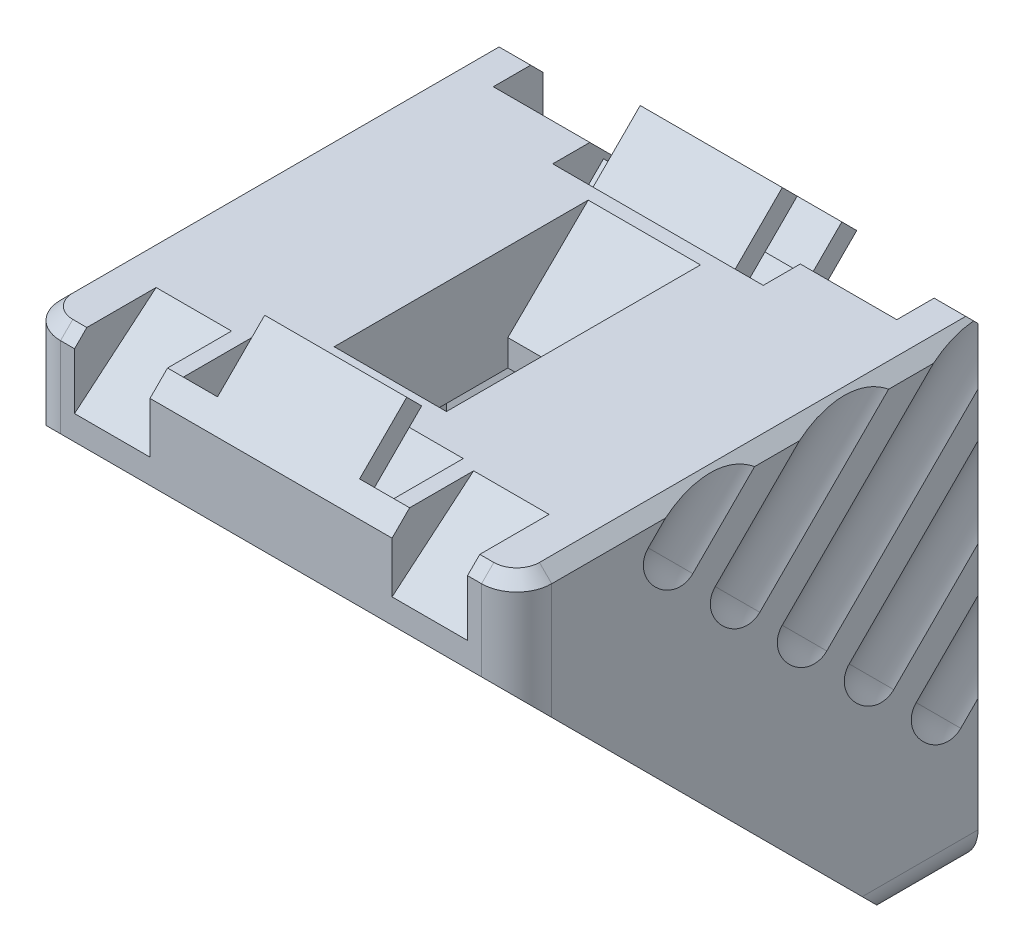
ISO-10303-21;
HEADER;
FILE_DESCRIPTION(('STEP AP214'),'2;1');
FILE_NAME('part.step','',(''),(''),'','','');
FILE_SCHEMA(('AUTOMOTIVE_DESIGN { 1 0 10303 214 1 1 1 1 }'));
ENDSEC;
DATA;
#1=APPLICATION_CONTEXT('core data for automotive mechanical design processes');
#2=APPLICATION_PROTOCOL_DEFINITION('international standard','automotive_design',2000,#1);
#3=PRODUCT_CONTEXT('',#1,'mechanical');
#4=PRODUCT('Part','Part','',(#3));
#5=PRODUCT_RELATED_PRODUCT_CATEGORY('part','',(#4));
#6=PRODUCT_DEFINITION_FORMATION('','',#4);
#7=PRODUCT_DEFINITION_CONTEXT('part definition',#1,'design');
#8=PRODUCT_DEFINITION('design','',#6,#7);
#9=PRODUCT_DEFINITION_SHAPE('','',#8);
#10=(LENGTH_UNIT() NAMED_UNIT(*) SI_UNIT(.MILLI.,.METRE.));
#11=(NAMED_UNIT(*) PLANE_ANGLE_UNIT() SI_UNIT($,.RADIAN.));
#12=(NAMED_UNIT(*) SI_UNIT($,.STERADIAN.) SOLID_ANGLE_UNIT());
#13=UNCERTAINTY_MEASURE_WITH_UNIT(LENGTH_MEASURE(1.E-05),#10,'distance_accuracy_value','');
#14=(GEOMETRIC_REPRESENTATION_CONTEXT(3) GLOBAL_UNCERTAINTY_ASSIGNED_CONTEXT((#13)) GLOBAL_UNIT_ASSIGNED_CONTEXT((#10,
#11,#12)) REPRESENTATION_CONTEXT('',''));
#15=CARTESIAN_POINT('',(0.,0.,0.));
#16=DIRECTION('',(0.,0.,1.));
#17=DIRECTION('',(1.,0.,0.));
#18=AXIS2_PLACEMENT_3D('',#15,#16,#17);
#19=CARTESIAN_POINT('',(4.05,0.,26.));
#20=DIRECTION('',(1.,0.,0.));
#21=DIRECTION('',(0.,1.,0.));
#22=AXIS2_PLACEMENT_3D('',#19,#20,#21);
#23=PLANE('',#22);
#24=DIRECTION('',(0.,0.707106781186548,0.707106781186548));
#25=VECTOR('',#24,1.);
#26=CARTESIAN_POINT('',(4.05,2.68700576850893,23.31299423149));
#27=LINE('',#26,#25);
#28=CARTESIAN_POINT('',(4.05,2.68700576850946,23.3129942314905));
#29=VERTEX_POINT('',#28);
#30=CARTESIAN_POINT('',(4.05,1.8384776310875,22.4644660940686));
#31=VERTEX_POINT('',#30);
#32=EDGE_CURVE('E2019',#29,#31,#27,.F.);
#33=ORIENTED_EDGE('',*,*,#32,.F.);
#34=DIRECTION('',(0.,-0.707106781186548,0.707106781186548));
#35=VECTOR('',#34,1.);
#36=CARTESIAN_POINT('',(4.05,0.,26.));
#37=LINE('',#36,#35);
#38=CARTESIAN_POINT('',(4.05,0.,26.));
#39=VERTEX_POINT('',#38);
#40=EDGE_CURVE('E2015',#39,#29,#37,.F.);
#41=ORIENTED_EDGE('',*,*,#40,.F.);
#42=DIRECTION('',(0.,-0.707106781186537,-0.707106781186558));
#43=VECTOR('',#42,1.);
#44=CARTESIAN_POINT('',(4.05,0.,26.));
#45=LINE('',#44,#43);
#46=CARTESIAN_POINT('',(4.05,-0.848528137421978,25.151471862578));
#47=VERTEX_POINT('',#46);
#48=EDGE_CURVE('E2017',#39,#47,#45,.T.);
#49=ORIENTED_EDGE('',*,*,#48,.T.);
#50=DIRECTION('',(0.,0.707106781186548,-0.707106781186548));
#51=VECTOR('',#50,1.);
#52=CARTESIAN_POINT('',(4.05,-0.848528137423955,25.15147186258));
#53=LINE('',#52,#51);
#54=EDGE_CURVE('E1993',#31,#47,#53,.F.);
#55=ORIENTED_EDGE('',*,*,#54,.F.);
#56=EDGE_LOOP('',(#33,#41,#49,#55));
#57=FACE_BOUND('',#56,.T.);
#58=ADVANCED_FACE('F15',(#57),#23,.T.);
#59=CARTESIAN_POINT('',(6.9,2.68700576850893,23.31299423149));
#60=DIRECTION('',(0.,0.707106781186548,-0.707106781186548));
#61=DIRECTION('',(0.,0.707106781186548,0.707106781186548));
#62=AXIS2_PLACEMENT_3D('',#59,#60,#61);
#63=PLANE('',#62);
#64=DIRECTION('',(0.,-0.707106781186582,-0.707106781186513));
#65=VECTOR('',#64,1.);
#66=CARTESIAN_POINT('',(-4.05,2.68700576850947,23.3129942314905));
#67=LINE('',#66,#65);
#68=CARTESIAN_POINT('',(-4.05,2.68700576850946,23.3129942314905));
#69=VERTEX_POINT('',#68);
#70=CARTESIAN_POINT('',(-4.05,1.83847763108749,22.4644660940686));
#71=VERTEX_POINT('',#70);
#72=EDGE_CURVE('E2023',#69,#71,#67,.T.);
#73=ORIENTED_EDGE('',*,*,#72,.F.);
#74=DIRECTION('',(1.,0.,0.));
#75=VECTOR('',#74,1.);
#76=CARTESIAN_POINT('',(6.9,2.68700576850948,23.3129942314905));
#77=LINE('',#76,#75);
#78=EDGE_CURVE('E2044',#29,#69,#77,.F.);
#79=ORIENTED_EDGE('',*,*,#78,.F.);
#80=ORIENTED_EDGE('',*,*,#32,.T.);
#81=DIRECTION('',(1.,0.,0.));
#82=VECTOR('',#81,1.);
#83=CARTESIAN_POINT('',(4.05,1.83847763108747,22.4644660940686));
#84=LINE('',#83,#82);
#85=EDGE_CURVE('E2028',#71,#31,#84,.T.);
#86=ORIENTED_EDGE('',*,*,#85,.F.);
#87=EDGE_LOOP('',(#73,#79,#80,#86));
#88=FACE_BOUND('',#87,.T.);
#89=ADVANCED_FACE('F1143',(#88),#63,.T.);
#90=CARTESIAN_POINT('',(-4.05,-0.848528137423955,25.15147186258));
#91=DIRECTION('',(-1.,0.,0.));
#92=DIRECTION('',(0.,-1.,0.));
#93=AXIS2_PLACEMENT_3D('',#90,#91,#92);
#94=PLANE('',#93);
#95=ORIENTED_EDGE('',*,*,#72,.T.);
#96=DIRECTION('',(0.,0.707106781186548,-0.707106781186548));
#97=VECTOR('',#96,1.);
#98=CARTESIAN_POINT('',(-4.05,-0.848528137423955,25.15147186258));
#99=LINE('',#98,#97);
#100=CARTESIAN_POINT('',(-4.05,-0.848528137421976,25.151471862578));
#101=VERTEX_POINT('',#100);
#102=EDGE_CURVE('E2025',#101,#71,#99,.T.);
#103=ORIENTED_EDGE('',*,*,#102,.F.);
#104=DIRECTION('',(0.,0.707106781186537,0.707106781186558));
#105=VECTOR('',#104,1.);
#106=CARTESIAN_POINT('',(-4.05,-0.848528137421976,25.151471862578));
#107=LINE('',#106,#105);
#108=CARTESIAN_POINT('',(-4.05,0.,26.));
#109=VERTEX_POINT('',#108);
#110=EDGE_CURVE('E2021',#101,#109,#107,.T.);
#111=ORIENTED_EDGE('',*,*,#110,.T.);
#112=DIRECTION('',(0.,-0.707106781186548,0.707106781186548));
#113=VECTOR('',#112,1.);
#114=CARTESIAN_POINT('',(-4.05,0.,26.));
#115=LINE('',#114,#113);
#116=EDGE_CURVE('E2046',#69,#109,#115,.T.);
#117=ORIENTED_EDGE('',*,*,#116,.F.);
#118=EDGE_LOOP('',(#95,#103,#111,#117));
#119=FACE_BOUND('',#118,.T.);
#120=ADVANCED_FACE('F1140',(#119),#94,.T.);
#121=CARTESIAN_POINT('',(4.05,-0.848528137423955,25.15147186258));
#122=DIRECTION('',(0.,-0.707106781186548,-0.707106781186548));
#123=DIRECTION('',(0.,0.707106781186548,-0.707106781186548));
#124=AXIS2_PLACEMENT_3D('',#121,#122,#123);
#125=PLANE('',#124);
#126=ORIENTED_EDGE('',*,*,#85,.T.);
#127=ORIENTED_EDGE('',*,*,#54,.T.);
#128=DIRECTION('',(1.,0.,0.));
#129=VECTOR('',#128,1.);
#130=CARTESIAN_POINT('',(6.,-0.848528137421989,25.151471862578));
#131=LINE('',#130,#129);
#132=EDGE_CURVE('E1987',#47,#101,#131,.F.);
#133=ORIENTED_EDGE('',*,*,#132,.T.);
#134=ORIENTED_EDGE('',*,*,#102,.T.);
#135=EDGE_LOOP('',(#126,#127,#133,#134));
#136=FACE_BOUND('',#135,.T.);
#137=ADVANCED_FACE('F1136',(#136),#125,.T.);
#138=CARTESIAN_POINT('',(6.9,0.,26.));
#139=DIRECTION('',(0.,0.707106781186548,0.707106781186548));
#140=DIRECTION('',(0.,-0.707106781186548,0.707106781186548));
#141=AXIS2_PLACEMENT_3D('',#138,#139,#140);
#142=PLANE('',#141);
#143=ORIENTED_EDGE('',*,*,#78,.T.);
#144=ORIENTED_EDGE('',*,*,#116,.T.);
#145=DIRECTION('',(1.,0.,0.));
#146=VECTOR('',#145,1.);
#147=CARTESIAN_POINT('',(6.,0.,26.));
#148=LINE('',#147,#146);
#149=CARTESIAN_POINT('',(-6.00000000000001,0.,26.));
#150=VERTEX_POINT('',#149);
#151=EDGE_CURVE('E1983',#109,#150,#148,.F.);
#152=ORIENTED_EDGE('',*,*,#151,.T.);
#153=DIRECTION('',(1.,0.,0.));
#154=VECTOR('',#153,1.);
#155=CARTESIAN_POINT('',(6.9,0.,26.));
#156=LINE('',#155,#154);
#157=CARTESIAN_POINT('',(-6.90000000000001,0.,26.));
#158=VERTEX_POINT('',#157);
#159=EDGE_CURVE('E1990',#150,#158,#156,.F.);
#160=ORIENTED_EDGE('',*,*,#159,.T.);
#161=DIRECTION('',(0.,-0.707106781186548,0.707106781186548));
#162=VECTOR('',#161,1.);
#163=CARTESIAN_POINT('',(-6.90000000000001,0.,26.));
#164=LINE('',#163,#162);
#165=CARTESIAN_POINT('',(-6.9,-0.999999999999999,27.));
#166=VERTEX_POINT('',#165);
#167=EDGE_CURVE('E1992',#158,#166,#164,.T.);
#168=ORIENTED_EDGE('',*,*,#167,.T.);
#169=DIRECTION('',(1.,0.,0.));
#170=VECTOR('',#169,1.);
#171=CARTESIAN_POINT('',(14.,-1.,27.));
#172=LINE('',#171,#170);
#173=CARTESIAN_POINT('',(6.9,-0.999999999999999,27.));
#174=VERTEX_POINT('',#173);
#175=EDGE_CURVE('E2123',#174,#166,#172,.F.);
#176=ORIENTED_EDGE('',*,*,#175,.F.);
#177=DIRECTION('',(0.,-0.707106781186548,0.707106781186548));
#178=VECTOR('',#177,1.);
#179=CARTESIAN_POINT('',(6.9,0.,26.));
#180=LINE('',#179,#178);
#181=CARTESIAN_POINT('',(6.9,0.,26.));
#182=VERTEX_POINT('',#181);
#183=EDGE_CURVE('E2016',#174,#182,#180,.F.);
#184=ORIENTED_EDGE('',*,*,#183,.T.);
#185=DIRECTION('',(1.,0.,0.));
#186=VECTOR('',#185,1.);
#187=CARTESIAN_POINT('',(6.9,0.,26.));
#188=LINE('',#187,#186);
#189=CARTESIAN_POINT('',(6.,0.,26.));
#190=VERTEX_POINT('',#189);
#191=EDGE_CURVE('E2013',#182,#190,#188,.F.);
#192=ORIENTED_EDGE('',*,*,#191,.T.);
#193=DIRECTION('',(1.,0.,0.));
#194=VECTOR('',#193,1.);
#195=CARTESIAN_POINT('',(6.,0.,26.));
#196=LINE('',#195,#194);
#197=EDGE_CURVE('E1986',#190,#39,#196,.F.);
#198=ORIENTED_EDGE('',*,*,#197,.T.);
#199=ORIENTED_EDGE('',*,*,#40,.T.);
#200=EDGE_LOOP('',(#143,#144,#152,#160,#168,#176,#184,#192,#198,#199));
#201=FACE_BOUND('',#200,.T.);
#202=ADVANCED_FACE('F1132',(#201),#142,.T.);
#203=CARTESIAN_POINT('',(-4.05,0.,0.));
#204=DIRECTION('',(1.,0.,0.));
#205=DIRECTION('',(0.,1.,0.));
#206=AXIS2_PLACEMENT_3D('',#203,#204,#205);
#207=PLANE('',#206);
#208=DIRECTION('',(0.,0.707106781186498,-0.707106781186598));
#209=VECTOR('',#208,1.);
#210=CARTESIAN_POINT('',(-4.05,2.33700576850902,1.90563491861));
#211=LINE('',#210,#209);
#212=CARTESIAN_POINT('',(-4.05,-0.350000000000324,4.59264068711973));
#213=VERTEX_POINT('',#212);
#214=CARTESIAN_POINT('',(-4.05,2.3370057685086,1.90563491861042));
#215=VERTEX_POINT('',#214);
#216=EDGE_CURVE('E2179',#213,#215,#211,.T.);
#217=ORIENTED_EDGE('',*,*,#216,.T.);
#218=DIRECTION('',(0.,-0.707106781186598,-0.707106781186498));
#219=VECTOR('',#218,1.);
#220=CARTESIAN_POINT('',(-4.05,1.48847763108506,1.057106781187));
#221=LINE('',#220,#219);
#222=CARTESIAN_POINT('',(-4.05,1.4884776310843,1.05710678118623));
#223=VERTEX_POINT('',#222);
#224=EDGE_CURVE('E2058',#215,#223,#221,.T.);
#225=ORIENTED_EDGE('',*,*,#224,.T.);
#226=DIRECTION('',(0.,-0.707106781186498,0.707106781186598));
#227=VECTOR('',#226,1.);
#228=CARTESIAN_POINT('',(-4.05,-1.19852813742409,3.744112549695));
#229=LINE('',#228,#227);
#230=CARTESIAN_POINT('',(-4.05,-1.19852813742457,3.74411254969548));
#231=VERTEX_POINT('',#230);
#232=EDGE_CURVE('E2176',#223,#231,#229,.T.);
#233=ORIENTED_EDGE('',*,*,#232,.T.);
#234=DIRECTION('',(0.,-0.707106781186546,-0.707106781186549));
#235=VECTOR('',#234,1.);
#236=CARTESIAN_POINT('',(-4.05,-0.350000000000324,4.59264068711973));
#237=LINE('',#236,#235);
#238=EDGE_CURVE('E2049',#213,#231,#237,.T.);
#239=ORIENTED_EDGE('',*,*,#238,.F.);
#240=EDGE_LOOP('',(#217,#225,#233,#239));
#241=FACE_BOUND('',#240,.T.);
#242=ADVANCED_FACE('F1128',(#241),#207,.F.);
#243=CARTESIAN_POINT('',(4.05,1.48847763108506,1.057106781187));
#244=DIRECTION('',(0.,-0.707106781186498,0.707106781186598));
#245=DIRECTION('',(0.,-0.707106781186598,-0.707106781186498));
#246=AXIS2_PLACEMENT_3D('',#243,#244,#245);
#247=PLANE('',#246);
#248=DIRECTION('',(1.,0.,0.));
#249=VECTOR('',#248,1.);
#250=CARTESIAN_POINT('',(4.05,1.48847763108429,1.05710678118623));
#251=LINE('',#250,#249);
#252=CARTESIAN_POINT('',(4.05,1.4884776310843,1.05710678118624));
#253=VERTEX_POINT('',#252);
#254=EDGE_CURVE('E2173',#253,#223,#251,.F.);
#255=ORIENTED_EDGE('',*,*,#254,.T.);
#256=ORIENTED_EDGE('',*,*,#224,.F.);
#257=DIRECTION('',(1.,0.,0.));
#258=VECTOR('',#257,1.);
#259=CARTESIAN_POINT('',(4.05,2.3370057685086,1.90563491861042));
#260=LINE('',#259,#258);
#261=CARTESIAN_POINT('',(4.05,2.3370057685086,1.90563491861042));
#262=VERTEX_POINT('',#261);
#263=EDGE_CURVE('E2182',#215,#262,#260,.T.);
#264=ORIENTED_EDGE('',*,*,#263,.T.);
#265=DIRECTION('',(0.,0.707106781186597,0.707106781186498));
#266=VECTOR('',#265,1.);
#267=CARTESIAN_POINT('',(4.05,1.4884776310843,1.05710678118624));
#268=LINE('',#267,#266);
#269=EDGE_CURVE('E2062',#253,#262,#268,.T.);
#270=ORIENTED_EDGE('',*,*,#269,.F.);
#271=EDGE_LOOP('',(#255,#256,#264,#270));
#272=FACE_BOUND('',#271,.T.);
#273=ADVANCED_FACE('F1124',(#272),#247,.F.);
#274=CARTESIAN_POINT('',(4.05,0.,0.));
#275=DIRECTION('',(1.,0.,0.));
#276=DIRECTION('',(0.,1.,0.));
#277=AXIS2_PLACEMENT_3D('',#274,#275,#276);
#278=PLANE('',#277);
#279=ORIENTED_EDGE('',*,*,#269,.T.);
#280=DIRECTION('',(0.,0.707106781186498,-0.707106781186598));
#281=VECTOR('',#280,1.);
#282=CARTESIAN_POINT('',(4.05,2.33700576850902,1.90563491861));
#283=LINE('',#282,#281);
#284=CARTESIAN_POINT('',(4.05,-0.350000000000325,4.59264068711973));
#285=VERTEX_POINT('',#284);
#286=EDGE_CURVE('E2185',#262,#285,#283,.F.);
#287=ORIENTED_EDGE('',*,*,#286,.T.);
#288=DIRECTION('',(0.,-0.707106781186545,-0.70710678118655));
#289=VECTOR('',#288,1.);
#290=CARTESIAN_POINT('',(4.05,-0.350000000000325,4.59264068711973));
#291=LINE('',#290,#289);
#292=CARTESIAN_POINT('',(4.05,-1.19852813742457,3.74411254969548));
#293=VERTEX_POINT('',#292);
#294=EDGE_CURVE('E2060',#285,#293,#291,.T.);
#295=ORIENTED_EDGE('',*,*,#294,.T.);
#296=DIRECTION('',(0.,-0.707106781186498,0.707106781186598));
#297=VECTOR('',#296,1.);
#298=CARTESIAN_POINT('',(4.05,-1.19852813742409,3.744112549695));
#299=LINE('',#298,#297);
#300=EDGE_CURVE('E2166',#293,#253,#299,.F.);
#301=ORIENTED_EDGE('',*,*,#300,.T.);
#302=EDGE_LOOP('',(#279,#287,#295,#301));
#303=FACE_BOUND('',#302,.T.);
#304=ADVANCED_FACE('F1120',(#303),#278,.T.);
#305=CARTESIAN_POINT('',(4.05,-26.,0.));
#306=DIRECTION('',(-1.,0.,0.));
#307=DIRECTION('',(0.,-1.,0.));
#308=AXIS2_PLACEMENT_3D('',#305,#306,#307);
#309=PLANE('',#308);
#310=DIRECTION('',(0.,-0.707106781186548,0.707106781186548));
#311=VECTOR('',#310,1.);
#312=CARTESIAN_POINT('',(4.05,-26.,0.));
#313=LINE('',#312,#311);
#314=CARTESIAN_POINT('',(4.05,-26.,0.));
#315=VERTEX_POINT('',#314);
#316=CARTESIAN_POINT('',(4.05,-23.3129942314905,-2.68700576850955));
#317=VERTEX_POINT('',#316);
#318=EDGE_CURVE('E918',#315,#317,#313,.F.);
#319=ORIENTED_EDGE('',*,*,#318,.T.);
#320=DIRECTION('',(0.,-0.707106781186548,-0.707106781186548));
#321=VECTOR('',#320,1.);
#322=CARTESIAN_POINT('',(4.05,-23.3129942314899,-2.687005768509));
#323=LINE('',#322,#321);
#324=CARTESIAN_POINT('',(4.05,-22.4644660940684,-1.83847763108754));
#325=VERTEX_POINT('',#324);
#326=EDGE_CURVE('E2100',#317,#325,#323,.F.);
#327=ORIENTED_EDGE('',*,*,#326,.T.);
#328=DIRECTION('',(0.,0.707106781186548,-0.707106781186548));
#329=VECTOR('',#328,1.);
#330=CARTESIAN_POINT('',(4.05,-25.1514718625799,0.8485281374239));
#331=LINE('',#330,#329);
#332=CARTESIAN_POINT('',(4.05,-25.151471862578,0.848528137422));
#333=VERTEX_POINT('',#332);
#334=EDGE_CURVE('E939',#325,#333,#331,.F.);
#335=ORIENTED_EDGE('',*,*,#334,.T.);
#336=DIRECTION('',(0.,0.707106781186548,0.707106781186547));
#337=VECTOR('',#336,1.);
#338=CARTESIAN_POINT('',(4.05,-26.,0.));
#339=LINE('',#338,#337);
#340=EDGE_CURVE('E2064',#315,#333,#339,.T.);
#341=ORIENTED_EDGE('',*,*,#340,.F.);
#342=EDGE_LOOP('',(#319,#327,#335,#341));
#343=FACE_BOUND('',#342,.T.);
#344=ADVANCED_FACE('F1116',(#343),#309,.F.);
#345=CARTESIAN_POINT('',(6.9,-23.3129942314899,-2.687005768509));
#346=DIRECTION('',(0.,-0.707106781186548,0.707106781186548));
#347=DIRECTION('',(0.,-0.707106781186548,-0.707106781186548));
#348=AXIS2_PLACEMENT_3D('',#345,#346,#347);
#349=PLANE('',#348);
#350=DIRECTION('',(1.,0.,0.));
#351=VECTOR('',#350,1.);
#352=CARTESIAN_POINT('',(6.9,-23.3129942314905,-2.68700576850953));
#353=LINE('',#352,#351);
#354=CARTESIAN_POINT('',(-4.05,-23.3129942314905,-2.68700576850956));
#355=VERTEX_POINT('',#354);
#356=EDGE_CURVE('E915',#317,#355,#353,.F.);
#357=ORIENTED_EDGE('',*,*,#356,.T.);
#358=DIRECTION('',(0.,0.707106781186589,0.707106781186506));
#359=VECTOR('',#358,1.);
#360=CARTESIAN_POINT('',(-4.05,-23.3129942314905,-2.68700576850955));
#361=LINE('',#360,#359);
#362=CARTESIAN_POINT('',(-4.05,-22.4644660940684,-1.83847763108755));
#363=VERTEX_POINT('',#362);
#364=EDGE_CURVE('E2102',#355,#363,#361,.T.);
#365=ORIENTED_EDGE('',*,*,#364,.T.);
#366=DIRECTION('',(1.,0.,0.));
#367=VECTOR('',#366,1.);
#368=CARTESIAN_POINT('',(4.05,-22.4644660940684,-1.83847763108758));
#369=LINE('',#368,#367);
#370=EDGE_CURVE('E942',#363,#325,#369,.T.);
#371=ORIENTED_EDGE('',*,*,#370,.T.);
#372=ORIENTED_EDGE('',*,*,#326,.F.);
#373=EDGE_LOOP('',(#357,#365,#371,#372));
#374=FACE_BOUND('',#373,.T.);
#375=ADVANCED_FACE('F1112',(#374),#349,.F.);
#376=CARTESIAN_POINT('',(-4.05,-25.1514718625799,0.8485281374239));
#377=DIRECTION('',(1.,0.,0.));
#378=DIRECTION('',(0.,1.,0.));
#379=AXIS2_PLACEMENT_3D('',#376,#377,#378);
#380=PLANE('',#379);
#381=DIRECTION('',(0.,0.707106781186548,-0.707106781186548));
#382=VECTOR('',#381,1.);
#383=CARTESIAN_POINT('',(-4.05,-25.1514718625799,0.848528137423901));
#384=LINE('',#383,#382);
#385=CARTESIAN_POINT('',(-4.05,-25.151471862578,0.848528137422));
#386=VERTEX_POINT('',#385);
#387=EDGE_CURVE('E945',#386,#363,#384,.T.);
#388=ORIENTED_EDGE('',*,*,#387,.T.);
#389=ORIENTED_EDGE('',*,*,#364,.F.);
#390=DIRECTION('',(0.,-0.707106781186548,0.707106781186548));
#391=VECTOR('',#390,1.);
#392=CARTESIAN_POINT('',(-4.05,-26.,0.));
#393=LINE('',#392,#391);
#394=CARTESIAN_POINT('',(-4.05,-26.,0.));
#395=VERTEX_POINT('',#394);
#396=EDGE_CURVE('E912',#355,#395,#393,.T.);
#397=ORIENTED_EDGE('',*,*,#396,.T.);
#398=DIRECTION('',(0.,-0.707106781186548,-0.707106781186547));
#399=VECTOR('',#398,1.);
#400=CARTESIAN_POINT('',(-4.05,-25.151471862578,0.848528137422));
#401=LINE('',#400,#399);
#402=EDGE_CURVE('E2104',#386,#395,#401,.T.);
#403=ORIENTED_EDGE('',*,*,#402,.F.);
#404=EDGE_LOOP('',(#388,#389,#397,#403));
#405=FACE_BOUND('',#404,.T.);
#406=ADVANCED_FACE('F1108',(#405),#380,.F.);
#407=CARTESIAN_POINT('',(6.,0.,26.));
#408=DIRECTION('',(0.,-0.707106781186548,0.707106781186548));
#409=DIRECTION('',(0.,-0.707106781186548,-0.707106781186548));
#410=AXIS2_PLACEMENT_3D('',#407,#408,#409);
#411=PLANE('',#410);
#412=ORIENTED_EDGE('',*,*,#197,.F.);
#413=DIRECTION('',(0.,-0.707106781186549,-0.707106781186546));
#414=VECTOR('',#413,1.);
#415=CARTESIAN_POINT('',(6.,0.,26.));
#416=LINE('',#415,#414);
#417=CARTESIAN_POINT('',(6.,-1.97989898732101,24.020101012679));
#418=VERTEX_POINT('',#417);
#419=EDGE_CURVE('E722',#190,#418,#416,.T.);
#420=ORIENTED_EDGE('',*,*,#419,.T.);
#421=DIRECTION('',(1.,0.,0.));
#422=VECTOR('',#421,1.);
#423=CARTESIAN_POINT('',(6.,-1.97989898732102,24.020101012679));
#424=LINE('',#423,#422);
#425=CARTESIAN_POINT('',(-6.00000000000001,-1.97989898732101,24.020101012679));
#426=VERTEX_POINT('',#425);
#427=EDGE_CURVE('E726',#418,#426,#424,.F.);
#428=ORIENTED_EDGE('',*,*,#427,.T.);
#429=DIRECTION('',(0.,-0.707106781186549,-0.707106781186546));
#430=VECTOR('',#429,1.);
#431=CARTESIAN_POINT('',(-6.,0.,26.));
#432=LINE('',#431,#430);
#433=EDGE_CURVE('E729',#150,#426,#432,.T.);
#434=ORIENTED_EDGE('',*,*,#433,.F.);
#435=ORIENTED_EDGE('',*,*,#151,.F.);
#436=ORIENTED_EDGE('',*,*,#110,.F.);
#437=ORIENTED_EDGE('',*,*,#132,.F.);
#438=ORIENTED_EDGE('',*,*,#48,.F.);
#439=EDGE_LOOP('',(#412,#420,#428,#434,#435,#436,#437,#438));
#440=FACE_BOUND('',#439,.T.);
#441=ADVANCED_FACE('F1104',(#440),#411,.F.);
#442=CARTESIAN_POINT('',(-3.2,-4.5,10.3));
#443=DIRECTION('',(0.,0.,-1.));
#444=DIRECTION('',(-1.,0.,0.));
#445=AXIS2_PLACEMENT_3D('',#442,#443,#444);
#446=PLANE('',#445);
#447=DIRECTION('',(0.,-1.,0.));
#448=VECTOR('',#447,1.);
#449=CARTESIAN_POINT('',(3.2,0.,10.3));
#450=LINE('',#449,#448);
#451=CARTESIAN_POINT('',(3.2,-4.50000000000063,10.3));
#452=VERTEX_POINT('',#451);
#453=CARTESIAN_POINT('',(3.2,-6.,10.3));
#454=VERTEX_POINT('',#453);
#455=EDGE_CURVE('E1575',#452,#454,#450,.T.);
#456=ORIENTED_EDGE('',*,*,#455,.F.);
#457=DIRECTION('',(1.,0.,0.));
#458=VECTOR('',#457,1.);
#459=CARTESIAN_POINT('',(-3.2,-4.50000000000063,10.3));
#460=LINE('',#459,#458);
#461=CARTESIAN_POINT('',(-3.2,-4.50000000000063,10.3));
#462=VERTEX_POINT('',#461);
#463=EDGE_CURVE('E1583',#452,#462,#460,.F.);
#464=ORIENTED_EDGE('',*,*,#463,.T.);
#465=DIRECTION('',(0.,-1.,0.));
#466=VECTOR('',#465,1.);
#467=CARTESIAN_POINT('',(-3.2,0.,10.3));
#468=LINE('',#467,#466);
#469=CARTESIAN_POINT('',(-3.2,-6.,10.3));
#470=VERTEX_POINT('',#469);
#471=EDGE_CURVE('E1585',#462,#470,#468,.T.);
#472=ORIENTED_EDGE('',*,*,#471,.T.);
#473=DIRECTION('',(1.,0.,0.));
#474=VECTOR('',#473,1.);
#475=CARTESIAN_POINT('',(-11.,-6.,10.3));
#476=LINE('',#475,#474);
#477=EDGE_CURVE('E1556',#470,#454,#476,.T.);
#478=ORIENTED_EDGE('',*,*,#477,.T.);
#479=EDGE_LOOP('',(#456,#464,#472,#478));
#480=FACE_BOUND('',#479,.T.);
#481=ADVANCED_FACE('F1100',(#480),#446,.F.);
#482=CARTESIAN_POINT('',(0.,-5.25,21.2));
#483=DIRECTION('',(0.,-0.8,-0.6));
#484=DIRECTION('',(0.,0.6,-0.8));
#485=AXIS2_PLACEMENT_3D('',#482,#483,#484);
#486=PLANE('',#485);
#487=DIRECTION('',(1.,0.,0.));
#488=VECTOR('',#487,1.);
#489=CARTESIAN_POINT('',(-11.,-6.,22.2));
#490=LINE('',#489,#488);
#491=CARTESIAN_POINT('',(3.2,-6.,22.2));
#492=VERTEX_POINT('',#491);
#493=CARTESIAN_POINT('',(-3.2,-6.,22.2));
#494=VERTEX_POINT('',#493);
#495=EDGE_CURVE('E1550',#492,#494,#490,.F.);
#496=ORIENTED_EDGE('',*,*,#495,.T.);
#497=DIRECTION('',(0.,0.6,-0.8));
#498=VECTOR('',#497,1.);
#499=CARTESIAN_POINT('',(-3.2,-6.,22.2));
#500=LINE('',#499,#498);
#501=CARTESIAN_POINT('',(-3.2,-4.5,20.2));
#502=VERTEX_POINT('',#501);
#503=EDGE_CURVE('E665',#494,#502,#500,.T.);
#504=ORIENTED_EDGE('',*,*,#503,.T.);
#505=DIRECTION('',(1.,0.,0.));
#506=VECTOR('',#505,1.);
#507=CARTESIAN_POINT('',(-3.2,-4.5,20.2));
#508=LINE('',#507,#506);
#509=CARTESIAN_POINT('',(3.2,-4.5,20.2));
#510=VERTEX_POINT('',#509);
#511=EDGE_CURVE('E1565',#502,#510,#508,.T.);
#512=ORIENTED_EDGE('',*,*,#511,.T.);
#513=DIRECTION('',(0.,0.6,-0.8));
#514=VECTOR('',#513,1.);
#515=CARTESIAN_POINT('',(3.2,-6.,22.2));
#516=LINE('',#515,#514);
#517=EDGE_CURVE('E1573',#492,#510,#516,.T.);
#518=ORIENTED_EDGE('',*,*,#517,.F.);
#519=EDGE_LOOP('',(#496,#504,#512,#518));
#520=FACE_BOUND('',#519,.T.);
#521=ADVANCED_FACE('F1096',(#520),#486,.T.);
#522=CARTESIAN_POINT('',(14.,-5.29999999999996,27.));
#523=DIRECTION('',(0.,0.,1.));
#524=DIRECTION('',(1.,0.,0.));
#525=AXIS2_PLACEMENT_3D('',#522,#523,#524);
#526=PLANE('',#525);
#527=DIRECTION('',(0.,-1.,0.));
#528=VECTOR('',#527,1.);
#529=CARTESIAN_POINT('',(-12.,-16.31310952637,27.));
#530=LINE('',#529,#528);
#531=CARTESIAN_POINT('',(-12.,-5.3000000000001,27.));
#532=VERTEX_POINT('',#531);
#533=CARTESIAN_POINT('',(-12.,-0.699999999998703,26.9999999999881));
#534=VERTEX_POINT('',#533);
#535=EDGE_CURVE('E1049',#532,#534,#530,.F.);
#536=ORIENTED_EDGE('',*,*,#535,.F.);
#537=DIRECTION('',(1.,0.,0.));
#538=VECTOR('',#537,1.);
#539=CARTESIAN_POINT('',(14.,-5.3000000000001,27.));
#540=LINE('',#539,#538);
#541=CARTESIAN_POINT('',(12.,-5.3000000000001,27.));
#542=VERTEX_POINT('',#541);
#543=EDGE_CURVE('E1544',#542,#532,#540,.F.);
#544=ORIENTED_EDGE('',*,*,#543,.F.);
#545=DIRECTION('',(0.,1.,0.));
#546=VECTOR('',#545,1.);
#547=CARTESIAN_POINT('',(12.,0.178581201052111,27.));
#548=LINE('',#547,#546);
#549=CARTESIAN_POINT('',(12.,-0.699999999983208,26.9999999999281));
#550=VERTEX_POINT('',#549);
#551=EDGE_CURVE('E871',#550,#542,#548,.F.);
#552=ORIENTED_EDGE('',*,*,#551,.F.);
#553=DIRECTION('',(1.,0.,0.));
#554=VECTOR('',#553,1.);
#555=CARTESIAN_POINT('',(12.,-0.699999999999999,27.));
#556=LINE('',#555,#554);
#557=CARTESIAN_POINT('',(11.2,-0.699999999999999,27.));
#558=VERTEX_POINT('',#557);
#559=EDGE_CURVE('E689',#558,#550,#556,.T.);
#560=ORIENTED_EDGE('',*,*,#559,.F.);
#561=DIRECTION('',(0.,1.,0.));
#562=VECTOR('',#561,1.);
#563=CARTESIAN_POINT('',(11.2,0.,27.));
#564=LINE('',#563,#562);
#565=CARTESIAN_POINT('',(11.2,-3.90000000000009,27.));
#566=VERTEX_POINT('',#565);
#567=EDGE_CURVE('E690',#558,#566,#564,.F.);
#568=ORIENTED_EDGE('',*,*,#567,.T.);
#569=DIRECTION('',(1.,0.,0.));
#570=VECTOR('',#569,1.);
#571=CARTESIAN_POINT('',(6.9,-3.90000000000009,27.));
#572=LINE('',#571,#570);
#573=CARTESIAN_POINT('',(6.9,-3.90000000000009,27.));
#574=VERTEX_POINT('',#573);
#575=EDGE_CURVE('E702',#566,#574,#572,.F.);
#576=ORIENTED_EDGE('',*,*,#575,.T.);
#577=DIRECTION('',(0.,1.,0.));
#578=VECTOR('',#577,1.);
#579=CARTESIAN_POINT('',(6.9,0.,27.));
#580=LINE('',#579,#578);
#581=EDGE_CURVE('E712',#174,#574,#580,.F.);
#582=ORIENTED_EDGE('',*,*,#581,.F.);
#583=ORIENTED_EDGE('',*,*,#175,.T.);
#584=DIRECTION('',(0.,-1.,0.));
#585=VECTOR('',#584,1.);
#586=CARTESIAN_POINT('',(-6.9,0.,27.));
#587=LINE('',#586,#585);
#588=CARTESIAN_POINT('',(-6.9,-3.90000000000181,27.));
#589=VERTEX_POINT('',#588);
#590=EDGE_CURVE('E733',#589,#166,#587,.F.);
#591=ORIENTED_EDGE('',*,*,#590,.F.);
#592=DIRECTION('',(1.,0.,0.));
#593=VECTOR('',#592,1.);
#594=CARTESIAN_POINT('',(-6.9,-3.90000000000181,27.));
#595=LINE('',#594,#593);
#596=CARTESIAN_POINT('',(-11.2,-3.90000000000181,27.));
#597=VERTEX_POINT('',#596);
#598=EDGE_CURVE('E734',#589,#597,#595,.F.);
#599=ORIENTED_EDGE('',*,*,#598,.T.);
#600=DIRECTION('',(0.,-1.,0.));
#601=VECTOR('',#600,1.);
#602=CARTESIAN_POINT('',(-11.2,0.,27.));
#603=LINE('',#602,#601);
#604=CARTESIAN_POINT('',(-11.2,-0.7,27.));
#605=VERTEX_POINT('',#604);
#606=EDGE_CURVE('E740',#597,#605,#603,.F.);
#607=ORIENTED_EDGE('',*,*,#606,.T.);
#608=DIRECTION('',(1.,0.,0.));
#609=VECTOR('',#608,1.);
#610=CARTESIAN_POINT('',(-11.2,-0.699999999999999,27.));
#611=LINE('',#610,#609);
#612=EDGE_CURVE('E744',#534,#605,#611,.T.);
#613=ORIENTED_EDGE('',*,*,#612,.F.);
#614=EDGE_LOOP('',(#536,#544,#552,#560,#568,#576,#582,#583,#591,#599,#607,#613));
#615=FACE_BOUND('',#614,.T.);
#616=ADVANCED_FACE('F1092',(#615),#526,.T.);
#617=CARTESIAN_POINT('',(6.,-1.62279220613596,1.622792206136));
#618=DIRECTION('',(0.,-0.707106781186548,0.707106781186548));
#619=DIRECTION('',(0.,-0.707106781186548,-0.707106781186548));
#620=AXIS2_PLACEMENT_3D('',#617,#618,#619);
#621=PLANE('',#620);
#622=DIRECTION('',(1.,0.,0.));
#623=VECTOR('',#622,1.);
#624=CARTESIAN_POINT('',(6.,-1.19852813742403,2.04705627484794));
#625=LINE('',#624,#623);
#626=CARTESIAN_POINT('',(-6.,-1.19852813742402,2.04705627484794));
#627=VERTEX_POINT('',#626);
#628=CARTESIAN_POINT('',(6.,-1.19852813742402,2.04705627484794));
#629=VERTEX_POINT('',#628);
#630=EDGE_CURVE('E2052',#627,#629,#625,.T.);
#631=ORIENTED_EDGE('',*,*,#630,.T.);
#632=DIRECTION('',(0.,-0.707106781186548,-0.707106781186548));
#633=VECTOR('',#632,1.);
#634=CARTESIAN_POINT('',(6.,-1.62279220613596,1.622792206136));
#635=LINE('',#634,#633);
#636=CARTESIAN_POINT('',(6.,-2.047056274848,1.19852813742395));
#637=VERTEX_POINT('',#636);
#638=EDGE_CURVE('E2126',#637,#629,#635,.F.);
#639=ORIENTED_EDGE('',*,*,#638,.F.);
#640=DIRECTION('',(1.,0.,0.));
#641=VECTOR('',#640,1.);
#642=CARTESIAN_POINT('',(6.,-2.047056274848,1.19852813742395));
#643=LINE('',#642,#641);
#644=CARTESIAN_POINT('',(-6.,-2.047056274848,1.19852813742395));
#645=VERTEX_POINT('',#644);
#646=EDGE_CURVE('E1518',#645,#637,#643,.T.);
#647=ORIENTED_EDGE('',*,*,#646,.F.);
#648=DIRECTION('',(0.,-0.707106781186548,-0.707106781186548));
#649=VECTOR('',#648,1.);
#650=CARTESIAN_POINT('',(-6.00000000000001,-1.62279220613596,1.622792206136));
#651=LINE('',#650,#649);
#652=EDGE_CURVE('E2148',#627,#645,#651,.T.);
#653=ORIENTED_EDGE('',*,*,#652,.F.);
#654=EDGE_LOOP('',(#631,#639,#647,#653));
#655=FACE_BOUND('',#654,.T.);
#656=ADVANCED_FACE('F1088',(#655),#621,.F.);
#657=CARTESIAN_POINT('',(-4.05,0.,0.));
#658=DIRECTION('',(-1.,0.,0.));
#659=DIRECTION('',(0.,-1.,0.));
#660=AXIS2_PLACEMENT_3D('',#657,#658,#659);
#661=PLANE('',#660);
#662=DIRECTION('',(0.,0.707106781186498,0.707106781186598));
#663=VECTOR('',#662,1.);
#664=CARTESIAN_POINT('',(-4.05,-1.05710678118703,-1.488477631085));
#665=LINE('',#664,#663);
#666=CARTESIAN_POINT('',(-4.05,-1.90563491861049,-2.33700576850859));
#667=VERTEX_POINT('',#666);
#668=CARTESIAN_POINT('',(-4.05,-1.05710678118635,-1.48847763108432));
#669=VERTEX_POINT('',#668);
#670=EDGE_CURVE('E2156',#667,#669,#665,.T.);
#671=ORIENTED_EDGE('',*,*,#670,.F.);
#672=DIRECTION('',(0.,0.707106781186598,-0.707106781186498));
#673=VECTOR('',#672,1.);
#674=CARTESIAN_POINT('',(-4.05,-1.90563491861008,-2.337005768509));
#675=LINE('',#674,#673);
#676=CARTESIAN_POINT('',(-4.05,-4.59264068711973,0.35000000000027));
#677=VERTEX_POINT('',#676);
#678=EDGE_CURVE('E1507',#677,#667,#675,.T.);
#679=ORIENTED_EDGE('',*,*,#678,.F.);
#680=DIRECTION('',(0.,0.707106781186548,0.707106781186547));
#681=VECTOR('',#680,1.);
#682=CARTESIAN_POINT('',(-4.05,-4.59264068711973,0.35000000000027));
#683=LINE('',#682,#681);
#684=CARTESIAN_POINT('',(-4.05,-3.74411254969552,1.19852813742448));
#685=VERTEX_POINT('',#684);
#686=EDGE_CURVE('E2151',#677,#685,#683,.T.);
#687=ORIENTED_EDGE('',*,*,#686,.T.);
#688=DIRECTION('',(0.,-0.707106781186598,0.707106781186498));
#689=VECTOR('',#688,1.);
#690=CARTESIAN_POINT('',(-4.05,-3.74411254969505,1.198528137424));
#691=LINE('',#690,#689);
#692=EDGE_CURVE('E1509',#669,#685,#691,.T.);
#693=ORIENTED_EDGE('',*,*,#692,.F.);
#694=EDGE_LOOP('',(#671,#679,#687,#693));
#695=FACE_BOUND('',#694,.T.);
#696=ADVANCED_FACE('F1084',(#695),#661,.T.);
#697=CARTESIAN_POINT('',(4.05,-1.05710678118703,-1.488477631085));
#698=DIRECTION('',(0.,0.707106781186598,-0.707106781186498));
#699=DIRECTION('',(0.,0.707106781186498,0.707106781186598));
#700=AXIS2_PLACEMENT_3D('',#697,#698,#699);
#701=PLANE('',#700);
#702=ORIENTED_EDGE('',*,*,#670,.T.);
#703=DIRECTION('',(1.,0.,0.));
#704=VECTOR('',#703,1.);
#705=CARTESIAN_POINT('',(4.05,-1.05710678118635,-1.48847763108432));
#706=LINE('',#705,#704);
#707=CARTESIAN_POINT('',(4.05,-1.05710678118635,-1.48847763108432));
#708=VERTEX_POINT('',#707);
#709=EDGE_CURVE('E1512',#708,#669,#706,.F.);
#710=ORIENTED_EDGE('',*,*,#709,.F.);
#711=DIRECTION('',(0.,-0.707106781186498,-0.707106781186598));
#712=VECTOR('',#711,1.);
#713=CARTESIAN_POINT('',(4.05,-1.05710678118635,-1.48847763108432));
#714=LINE('',#713,#712);
#715=CARTESIAN_POINT('',(4.05,-1.9056349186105,-2.33700576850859));
#716=VERTEX_POINT('',#715);
#717=EDGE_CURVE('E2158',#708,#716,#714,.T.);
#718=ORIENTED_EDGE('',*,*,#717,.T.);
#719=DIRECTION('',(1.,0.,0.));
#720=VECTOR('',#719,1.);
#721=CARTESIAN_POINT('',(4.05,-1.90563491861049,-2.33700576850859));
#722=LINE('',#721,#720);
#723=EDGE_CURVE('E1505',#667,#716,#722,.T.);
#724=ORIENTED_EDGE('',*,*,#723,.F.);
#725=EDGE_LOOP('',(#702,#710,#718,#724));
#726=FACE_BOUND('',#725,.T.);
#727=ADVANCED_FACE('F1080',(#726),#701,.T.);
#728=CARTESIAN_POINT('',(4.05,0.,0.));
#729=DIRECTION('',(-1.,0.,0.));
#730=DIRECTION('',(0.,-1.,0.));
#731=AXIS2_PLACEMENT_3D('',#728,#729,#730);
#732=PLANE('',#731);
#733=DIRECTION('',(0.,0.707106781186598,-0.707106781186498));
#734=VECTOR('',#733,1.);
#735=CARTESIAN_POINT('',(4.05,-1.90563491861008,-2.337005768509));
#736=LINE('',#735,#734);
#737=CARTESIAN_POINT('',(4.05,-4.59264068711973,0.35000000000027));
#738=VERTEX_POINT('',#737);
#739=EDGE_CURVE('E1495',#716,#738,#736,.F.);
#740=ORIENTED_EDGE('',*,*,#739,.F.);
#741=ORIENTED_EDGE('',*,*,#717,.F.);
#742=DIRECTION('',(0.,-0.707106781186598,0.707106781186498));
#743=VECTOR('',#742,1.);
#744=CARTESIAN_POINT('',(4.05,-3.74411254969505,1.198528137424));
#745=LINE('',#744,#743);
#746=CARTESIAN_POINT('',(4.05,-3.74411254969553,1.19852813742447));
#747=VERTEX_POINT('',#746);
#748=EDGE_CURVE('E1515',#747,#708,#745,.F.);
#749=ORIENTED_EDGE('',*,*,#748,.F.);
#750=DIRECTION('',(0.,0.707106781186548,0.707106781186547));
#751=VECTOR('',#750,1.);
#752=CARTESIAN_POINT('',(4.05,-4.59264068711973,0.35000000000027));
#753=LINE('',#752,#751);
#754=EDGE_CURVE('E2161',#738,#747,#753,.T.);
#755=ORIENTED_EDGE('',*,*,#754,.F.);
#756=EDGE_LOOP('',(#740,#741,#749,#755));
#757=FACE_BOUND('',#756,.T.);
#758=ADVANCED_FACE('F1076',(#757),#732,.F.);
#759=CARTESIAN_POINT('',(6.,-1.19852813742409,2.047056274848));
#760=DIRECTION('',(0.,-0.707106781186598,-0.707106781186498));
#761=DIRECTION('',(0.,0.707106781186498,-0.707106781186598));
#762=AXIS2_PLACEMENT_3D('',#759,#760,#761);
#763=PLANE('',#762);
#764=ORIENTED_EDGE('',*,*,#630,.F.);
#765=DIRECTION('',(0.,0.707106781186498,-0.707106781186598));
#766=VECTOR('',#765,1.);
#767=CARTESIAN_POINT('',(-6.,-1.19852813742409,2.047056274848));
#768=LINE('',#767,#766);
#769=CARTESIAN_POINT('',(-6.,-2.04705627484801,2.89558441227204));
#770=VERTEX_POINT('',#769);
#771=EDGE_CURVE('E2056',#770,#627,#768,.T.);
#772=ORIENTED_EDGE('',*,*,#771,.F.);
#773=DIRECTION('',(1.,0.,0.));
#774=VECTOR('',#773,1.);
#775=CARTESIAN_POINT('',(6.,-2.04705627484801,2.89558441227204));
#776=LINE('',#775,#774);
#777=CARTESIAN_POINT('',(6.,-2.04705627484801,2.89558441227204));
#778=VERTEX_POINT('',#777);
#779=EDGE_CURVE('E1492',#770,#778,#776,.T.);
#780=ORIENTED_EDGE('',*,*,#779,.T.);
#781=DIRECTION('',(0.,0.707106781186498,-0.707106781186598));
#782=VECTOR('',#781,1.);
#783=CARTESIAN_POINT('',(6.,-1.19852813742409,2.047056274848));
#784=LINE('',#783,#782);
#785=EDGE_CURVE('E2055',#629,#778,#784,.F.);
#786=ORIENTED_EDGE('',*,*,#785,.F.);
#787=EDGE_LOOP('',(#764,#772,#780,#786));
#788=FACE_BOUND('',#787,.T.);
#789=ADVANCED_FACE('F1072',(#788),#763,.F.);
#790=CARTESIAN_POINT('',(4.05,-1.19852813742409,3.744112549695));
#791=DIRECTION('',(0.,0.707106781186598,0.707106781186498));
#792=DIRECTION('',(0.,-0.707106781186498,0.707106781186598));
#793=AXIS2_PLACEMENT_3D('',#790,#791,#792);
#794=PLANE('',#793);
#795=ORIENTED_EDGE('',*,*,#232,.F.);
#796=ORIENTED_EDGE('',*,*,#254,.F.);
#797=ORIENTED_EDGE('',*,*,#300,.F.);
#798=DIRECTION('',(1.,0.,0.));
#799=VECTOR('',#798,1.);
#800=CARTESIAN_POINT('',(6.,-1.19852813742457,3.74411254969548));
#801=LINE('',#800,#799);
#802=EDGE_CURVE('E1489',#293,#231,#801,.F.);
#803=ORIENTED_EDGE('',*,*,#802,.T.);
#804=EDGE_LOOP('',(#795,#796,#797,#803));
#805=FACE_BOUND('',#804,.T.);
#806=ADVANCED_FACE('F1068',(#805),#794,.F.);
#807=CARTESIAN_POINT('',(4.05,2.33700576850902,1.90563491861));
#808=DIRECTION('',(0.,-0.707106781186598,-0.707106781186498));
#809=DIRECTION('',(0.,0.707106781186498,-0.707106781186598));
#810=AXIS2_PLACEMENT_3D('',#807,#808,#809);
#811=PLANE('',#810);
#812=ORIENTED_EDGE('',*,*,#286,.F.);
#813=ORIENTED_EDGE('',*,*,#263,.F.);
#814=ORIENTED_EDGE('',*,*,#216,.F.);
#815=DIRECTION('',(1.,0.,0.));
#816=VECTOR('',#815,1.);
#817=CARTESIAN_POINT('',(6.,-0.350000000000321,4.59264068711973));
#818=LINE('',#817,#816);
#819=EDGE_CURVE('E1485',#213,#285,#818,.T.);
#820=ORIENTED_EDGE('',*,*,#819,.T.);
#821=EDGE_LOOP('',(#812,#813,#814,#820));
#822=FACE_BOUND('',#821,.T.);
#823=ADVANCED_FACE('F1064',(#822),#811,.F.);
#824=CARTESIAN_POINT('',(-12.,-16.31310952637,25.));
#825=DIRECTION('',(0.,-1.,0.));
#826=DIRECTION('',(1.,0.,0.));
#827=AXIS2_PLACEMENT_3D('',#824,#825,#826);
#828=CYLINDRICAL_SURFACE('',#827,2.);
#829=DIRECTION('',(0.,-1.,0.));
#830=VECTOR('',#829,1.);
#831=CARTESIAN_POINT('',(-14.,0.,25.));
#832=LINE('',#831,#830);
#833=CARTESIAN_POINT('',(-14.,-7.3000000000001,25.));
#834=VERTEX_POINT('',#833);
#835=CARTESIAN_POINT('',(-13.9999999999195,-0.699999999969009,25.));
#836=VERTEX_POINT('',#835);
#837=EDGE_CURVE('E952',#834,#836,#832,.F.);
#838=ORIENTED_EDGE('',*,*,#837,.F.);
#839=CARTESIAN_POINT('',(-12.,-7.30000000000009,25.));
#840=DIRECTION('',(0.,-0.707106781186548,0.707106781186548));
#841=DIRECTION('',(0.,-0.707106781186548,-0.707106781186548));
#842=AXIS2_PLACEMENT_3D('',#839,#840,#841);
#843=ELLIPSE('',#842,2.82842712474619,2.);
#844=EDGE_CURVE('E1543',#532,#834,#843,.T.);
#845=ORIENTED_EDGE('',*,*,#844,.F.);
#846=ORIENTED_EDGE('',*,*,#535,.T.);
#847=CARTESIAN_POINT('',(-12.,-0.699999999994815,25.));
#848=DIRECTION('',(0.,-1.,0.));
#849=DIRECTION('',(1.,0.,0.));
#850=AXIS2_PLACEMENT_3D('',#847,#848,#849);
#851=CIRCLE('',#850,1.99999999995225);
#852=EDGE_CURVE('E760',#836,#534,#851,.F.);
#853=ORIENTED_EDGE('',*,*,#852,.F.);
#854=EDGE_LOOP('',(#838,#845,#846,#853));
#855=FACE_BOUND('',#854,.T.);
#856=ADVANCED_FACE('F1060',(#855),#828,.T.);
#857=CARTESIAN_POINT('',(-17.1200000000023,-4.22583651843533,16.9537585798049));
#858=DIRECTION('',(1.,2.6131319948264E-12,-4.42798311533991E-12));
#859=DIRECTION('',(-1.2836953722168E-12,-0.70710678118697,-0.707106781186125));
#860=AXIS2_PLACEMENT_3D('',#857,#858,#859);
#861=CIRCLE('',#860,1.80000000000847);
#862=TRIMMED_CURVE('',#861,(PARAMETER_VALUE(-3.14159265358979)),
(PARAMETER_VALUE(3.14159265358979)),.T.,.PARAMETER.);
#863=CARTESIAN_POINT('',(-17.12,-2.95304431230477,18.2265507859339));
#864=DIRECTION('',(4.97882024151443E-12,-0.707106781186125,0.70710678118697));
#865=AXIS1_PLACEMENT('',#863,#864);
#866=SURFACE_OF_REVOLUTION('',#862,#865);
#867=CARTESIAN_POINT('',(-14.,-1.68308368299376,19.4965114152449));
#868=CARTESIAN_POINT('',(-14.,-1.70460660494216,19.5180501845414));
#869=CARTESIAN_POINT('',(-14.,-1.72723587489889,19.5384739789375));
#870=CARTESIAN_POINT('',(-14.,-1.7744174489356,19.5769242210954));
#871=CARTESIAN_POINT('',(-14.,-1.79896818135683,19.5949525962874));
#872=CARTESIAN_POINT('',(-14.,-1.84950237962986,19.6283238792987));
#873=CARTESIAN_POINT('',(-14.,-1.87547037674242,19.6436902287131));
#874=CARTESIAN_POINT('',(-14.,-1.92874929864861,19.6718695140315));
#875=CARTESIAN_POINT('',(-14.,-1.95606039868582,19.684682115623));
#876=CARTESIAN_POINT('',(-14.,-2.03941727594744,19.7191717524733));
#877=CARTESIAN_POINT('',(-14.,-2.09708568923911,19.7370297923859));
#878=CARTESIAN_POINT('',(-14.,-2.21461571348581,19.7628990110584));
#879=CARTESIAN_POINT('',(-14.,-2.27448203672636,19.7708875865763));
#880=CARTESIAN_POINT('',(-14.,-2.41167276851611,19.7788762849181));
#881=CARTESIAN_POINT('',(-14.,-2.48916216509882,19.775990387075));
#882=CARTESIAN_POINT('',(-14.,-2.64260948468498,19.7577948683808));
#883=CARTESIAN_POINT('',(-14.,-2.71856522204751,19.7424686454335));
#884=CARTESIAN_POINT('',(-14.,-2.90017704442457,19.6927264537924));
#885=CARTESIAN_POINT('',(-14.,-3.00433604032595,19.6528996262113));
#886=CARTESIAN_POINT('',(-14.,-3.20523910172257,19.5575363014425));
#887=CARTESIAN_POINT('',(-14.,-3.30196351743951,19.5019598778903));
#888=CARTESIAN_POINT('',(-14.,-3.45989162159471,19.3969687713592));
#889=CARTESIAN_POINT('',(-14.,-3.52314984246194,19.3505811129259));
#890=CARTESIAN_POINT('',(-14.,-3.64554744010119,19.2525998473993));
#891=CARTESIAN_POINT('',(-14.,-3.70468478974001,19.2010037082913));
#892=CARTESIAN_POINT('',(-14.,-3.81859840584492,19.0931674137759));
#893=CARTESIAN_POINT('',(-14.,-3.87337308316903,19.0369255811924));
#894=CARTESIAN_POINT('',(-14.,-3.97810787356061,18.9201752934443));
#895=CARTESIAN_POINT('',(-14.,-4.02807000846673,18.8596686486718));
#896=CARTESIAN_POINT('',(-14.,-4.14587963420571,18.7037306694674));
#897=CARTESIAN_POINT('',(-14.,-4.21043224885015,18.6057632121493));
#898=CARTESIAN_POINT('',(-14.,-4.32398489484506,18.4012898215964));
#899=CARTESIAN_POINT('',(-14.0000000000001,-4.3730265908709,18.2948077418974));
#900=CARTESIAN_POINT('',(-14.,-4.43798358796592,18.1096038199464));
#901=CARTESIAN_POINT('',(-13.9999999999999,-4.45947517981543,18.0328514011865));
#902=CARTESIAN_POINT('',(-14.0000000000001,-4.49051281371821,17.8769277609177));
#903=CARTESIAN_POINT('',(-14.0000000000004,-4.50007514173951,17.7977599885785));
#904=CARTESIAN_POINT('',(-14.0000000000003,-4.50424763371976,17.6558066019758));
#905=CARTESIAN_POINT('',(-14.0000000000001,-4.50159956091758,17.5931087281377));
#906=CARTESIAN_POINT('',(-13.9999999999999,-4.48613546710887,17.468893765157));
#907=CARTESIAN_POINT('',(-14.,-4.47331908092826,17.4073767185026));
#908=CARTESIAN_POINT('',(-14.,-4.43650185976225,17.2870397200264));
#909=CARTESIAN_POINT('',(-14.,-4.41238841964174,17.228253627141));
#910=CARTESIAN_POINT('',(-14.,-4.35286650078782,17.1167823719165));
#911=CARTESIAN_POINT('',(-14.0000000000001,-4.31749371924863,17.0640786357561));
#912=CARTESIAN_POINT('',(-14.,-4.26852801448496,17.0054828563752));
#913=CARTESIAN_POINT('',(-14.,-4.25972330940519,16.9954145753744));
#914=CARTESIAN_POINT('',(-14.,-4.24168485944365,16.9756929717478));
#915=CARTESIAN_POINT('',(-14.,-4.23245166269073,16.9660391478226));
#916=CARTESIAN_POINT('',(-14.,-4.22300494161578,16.9565901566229));
#917=B_SPLINE_CURVE_WITH_KNOTS('',3,(#867,#868,#869,#870,#871,#872,#873,#874,#875,#876,#877,
#878,#879,#880,#881,#882,#883,#884,#885,#886,#887,#888,#889,#890,#891,#892,#893,#894,#895,#896,
#897,#898,#899,#900,#901,#902,#903,#904,#905,#906,#907,#908,#909,#910,#911,#912,#913,#914,#915,
#916),.UNSPECIFIED.,.F.,.F.,(4,2,2,2,2,2,2,2,2,2,2,2,2,2,2,2,2,2,2,2,2,2,2,2,4),(0.,
0.0912978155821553,0.182521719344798,0.272896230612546,0.363282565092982,0.543354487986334,
0.723838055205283,0.955189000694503,1.18684920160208,1.51956116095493,1.85312423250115,
2.08818354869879,2.32335769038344,2.55861710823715,2.79377725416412,3.14463947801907,
3.49455106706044,3.73293484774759,3.97099282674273,4.15854594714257,4.34610580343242,
4.53557631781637,4.72445201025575,4.76457025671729,4.8046385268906),.UNSPECIFIED.);
#918=CARTESIAN_POINT('',(-14.,-1.68308368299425,19.4965114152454));
#919=VERTEX_POINT('',#918);
#920=CARTESIAN_POINT('',(-14.,-4.22300494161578,16.9565901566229));
#921=VERTEX_POINT('',#920);
#922=EDGE_CURVE('E1021',#919,#921,#917,.T.);
#923=ORIENTED_EDGE('',*,*,#922,.F.);
#924=CARTESIAN_POINT('',(-17.12,-2.95304431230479,18.2265507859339));
#925=DIRECTION('',(0.,0.707106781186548,-0.707106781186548));
#926=DIRECTION('',(0.,0.707106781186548,0.707106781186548));
#927=AXIS2_PLACEMENT_3D('',#924,#925,#926);
#928=CIRCLE('',#927,3.6);
#929=EDGE_CURVE('E1046',#919,#921,#928,.T.);
#930=ORIENTED_EDGE('',*,*,#929,.T.);
#931=EDGE_LOOP('',(#923,#930));
#932=FACE_BOUND('',#931,.T.);
#933=ADVANCED_FACE('F1056',(#932),#866,.T.);
#934=CARTESIAN_POINT('',(-17.12,11.0308657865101,4.242640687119));
#935=DIRECTION('',(0.,0.707106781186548,-0.707106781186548));
#936=DIRECTION('',(0.,0.707106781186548,0.707106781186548));
#937=AXIS2_PLACEMENT_3D('',#934,#935,#936);
#938=CYLINDRICAL_SURFACE('',#937,3.6);
#939=CARTESIAN_POINT('',(-17.12,-3.82000000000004,19.0935064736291));
#940=DIRECTION('',(0.707106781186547,-0.707106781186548,0.));
#941=DIRECTION('',(0.408248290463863,0.408248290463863,-0.816496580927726));
#942=AXIS2_PLACEMENT_3D('',#939,#940,#941);
#943=ELLIPSE('',#942,7.2,3.6);
#944=CARTESIAN_POINT('',(-14.,-0.700000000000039,18.5134277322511));
#945=VERTEX_POINT('',#944);
#946=CARTESIAN_POINT('',(-14.,-0.700000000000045,13.4335852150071));
#947=VERTEX_POINT('',#946);
#948=EDGE_CURVE('E765',#945,#947,#943,.F.);
#949=ORIENTED_EDGE('',*,*,#948,.T.);
#950=DIRECTION('',(0.,0.707106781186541,-0.707106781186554));
#951=VECTOR('',#950,1.);
#952=CARTESIAN_POINT('',(-14.,-4.22300494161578,16.9565901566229));
#953=LINE('',#952,#951);
#954=EDGE_CURVE('E1045',#921,#947,#953,.T.);
#955=ORIENTED_EDGE('',*,*,#954,.F.);
#956=ORIENTED_EDGE('',*,*,#929,.F.);
#957=DIRECTION('',(0.,0.707106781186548,-0.707106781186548));
#958=VECTOR('',#957,1.);
#959=CARTESIAN_POINT('',(-14.,12.3008264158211,5.51260131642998));
#960=LINE('',#959,#958);
#961=EDGE_CURVE('E2106',#945,#919,#960,.F.);
#962=ORIENTED_EDGE('',*,*,#961,.F.);
#963=EDGE_LOOP('',(#949,#955,#956,#962));
#964=FACE_BOUND('',#963,.T.);
#965=ADVANCED_FACE('F1035',(#964),#938,.F.);
#966=CARTESIAN_POINT('',(-17.1199999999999,-8.04421313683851,13.1353819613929));
#967=DIRECTION('',(1.,2.21809673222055E-12,-2.1697297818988E-12));
#968=DIRECTION('',(0.,-0.707106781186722,-0.707106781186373));
#969=AXIS2_PLACEMENT_3D('',#966,#967,#968);
#970=CIRCLE('',#969,1.80000000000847);
#971=TRIMMED_CURVE('',#970,(PARAMETER_VALUE(-3.14159265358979)),
(PARAMETER_VALUE(3.14159265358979)),.T.,.PARAMETER.);
#972=CARTESIAN_POINT('',(-17.12,-6.7714209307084,14.4081741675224));
#973=DIRECTION('',(3.10266188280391E-12,-0.707106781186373,0.707106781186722));
#974=AXIS1_PLACEMENT('',#972,#973);
#975=SURFACE_OF_REVOLUTION('',#971,#974);
#976=CARTESIAN_POINT('',(-14.,-5.50146030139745,15.6781347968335));
#977=CARTESIAN_POINT('',(-14.,-5.52298322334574,15.69967356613));
#978=CARTESIAN_POINT('',(-14.,-5.54561249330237,15.7200973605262));
#979=CARTESIAN_POINT('',(-14.,-5.59279406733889,15.7585476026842));
#980=CARTESIAN_POINT('',(-14.,-5.61734479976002,15.7765759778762));
#981=CARTESIAN_POINT('',(-14.,-5.66787899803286,15.8099472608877));
#982=CARTESIAN_POINT('',(-14.,-5.69384699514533,15.8253136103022));
#983=CARTESIAN_POINT('',(-14.,-5.74712591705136,15.8534928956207));
#984=CARTESIAN_POINT('',(-14.,-5.77443701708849,15.8663054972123));
#985=CARTESIAN_POINT('',(-14.,-5.85779389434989,15.9007951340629));
#986=CARTESIAN_POINT('',(-14.,-5.91546230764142,15.9186531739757));
#987=CARTESIAN_POINT('',(-14.,-6.03299233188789,15.9445223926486));
#988=CARTESIAN_POINT('',(-14.,-6.09285865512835,15.9525109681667));
#989=CARTESIAN_POINT('',(-14.,-6.23004938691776,15.960499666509));
#990=CARTESIAN_POINT('',(-14.,-6.30753878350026,15.9576137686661));
#991=CARTESIAN_POINT('',(-14.,-6.46098610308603,15.9394182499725));
#992=CARTESIAN_POINT('',(-14.,-6.53694184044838,15.9240920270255));
#993=CARTESIAN_POINT('',(-14.,-6.71855366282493,15.8743498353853));
#994=CARTESIAN_POINT('',(-14.,-6.82271265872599,15.8345230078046));
#995=CARTESIAN_POINT('',(-14.,-7.02361572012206,15.739159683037));
#996=CARTESIAN_POINT('',(-14.,-7.12034013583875,15.6835832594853));
#997=CARTESIAN_POINT('',(-14.,-7.27826823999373,15.5785921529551));
#998=CARTESIAN_POINT('',(-14.,-7.34152646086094,15.5322044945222));
#999=CARTESIAN_POINT('',(-14.,-7.46392405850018,15.4342232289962));
#1000=CARTESIAN_POINT('',(-14.,-7.523061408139,15.3826270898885));
#1001=CARTESIAN_POINT('',(-14.,-7.63697502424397,15.2747907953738));
#1002=CARTESIAN_POINT('',(-14.,-7.69174970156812,15.2185489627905));
#1003=CARTESIAN_POINT('',(-14.,-7.79648449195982,15.1017986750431));
#1004=CARTESIAN_POINT('',(-14.,-7.84644662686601,15.041292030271));
#1005=CARTESIAN_POINT('',(-14.,-7.96425625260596,14.8853540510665));
#1006=CARTESIAN_POINT('',(-14.,-8.02880886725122,14.7873865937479));
#1007=CARTESIAN_POINT('',(-14.,-8.14236151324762,14.5829132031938));
#1008=CARTESIAN_POINT('',(-14.,-8.19140320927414,14.4764311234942));
#1009=CARTESIAN_POINT('',(-14.,-8.25636020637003,14.2912272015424));
#1010=CARTESIAN_POINT('',(-13.9999999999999,-8.27785179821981,14.2144747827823));
#1011=CARTESIAN_POINT('',(-14.0000000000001,-8.30888943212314,14.0585511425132));
#1012=CARTESIAN_POINT('',(-14.0000000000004,-8.31845176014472,13.9793833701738));
#1013=CARTESIAN_POINT('',(-14.0000000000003,-8.32262425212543,13.8374299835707));
#1014=CARTESIAN_POINT('',(-14.0000000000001,-8.31997617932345,13.7747321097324));
#1015=CARTESIAN_POINT('',(-13.9999999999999,-8.30451208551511,13.6505171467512));
#1016=CARTESIAN_POINT('',(-14.,-8.29169569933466,13.5890001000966));
#1017=CARTESIAN_POINT('',(-14.,-8.25487847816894,13.4686631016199));
#1018=CARTESIAN_POINT('',(-14.,-8.23076503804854,13.4098770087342));
#1019=CARTESIAN_POINT('',(-14.,-8.17124311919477,13.2984057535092));
#1020=CARTESIAN_POINT('',(-14.0000000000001,-8.13587033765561,13.2457020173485));
#1021=CARTESIAN_POINT('',(-14.,-8.08690463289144,13.1871062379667));
#1022=CARTESIAN_POINT('',(-14.,-8.07809992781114,13.1770379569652));
#1023=CARTESIAN_POINT('',(-14.,-8.06006147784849,13.1573163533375));
#1024=CARTESIAN_POINT('',(-14.,-8.05082828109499,13.1476625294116));
#1025=CARTESIAN_POINT('',(-14.,-8.04138156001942,13.1382135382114));
#1026=B_SPLINE_CURVE_WITH_KNOTS('',3,(#976,#977,#978,#979,#980,#981,#982,#983,#984,#985,#986,
#987,#988,#989,#990,#991,#992,#993,#994,#995,#996,#997,#998,#999,#1000,#1001,#1002,#1003,#1004,
#1005,#1006,#1007,#1008,#1009,#1010,#1011,#1012,#1013,#1014,#1015,#1016,#1017,#1018,#1019,#1020,
#1021,#1022,#1023,#1024,#1025),.UNSPECIFIED.,.F.,.F.,(4,2,2,2,2,2,2,2,2,2,2,2,2,2,2,2,2,2,2,2,2,
2,2,2,4),(0.,0.0912978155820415,0.182521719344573,0.272896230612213,0.363282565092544,
0.54335448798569,0.723838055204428,0.955189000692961,1.18684920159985,1.51956116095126,
1.85312423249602,2.08818354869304,2.32335769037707,2.55861710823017,2.79377725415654,
3.14463947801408,3.49455106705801,3.73293484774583,3.97099282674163,4.15854594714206,
4.34610580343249,4.53557631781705,4.72445201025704,4.76457025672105,4.80463852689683),.UNSPECIFIED.);
#1027=CARTESIAN_POINT('',(-14.,-5.50146030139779,15.6781347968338));
#1028=VERTEX_POINT('',#1027);
#1029=CARTESIAN_POINT('',(-14.,-8.04138156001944,13.1382135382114));
#1030=VERTEX_POINT('',#1029);
#1031=EDGE_CURVE('E1013',#1028,#1030,#1026,.T.);
#1032=ORIENTED_EDGE('',*,*,#1031,.F.);
#1033=CARTESIAN_POINT('',(-17.12,-6.77142093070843,14.4081741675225));
#1034=DIRECTION('',(0.,0.707106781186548,-0.707106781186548));
#1035=DIRECTION('',(0.,0.707106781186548,0.707106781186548));
#1036=AXIS2_PLACEMENT_3D('',#1033,#1034,#1035);
#1037=CIRCLE('',#1036,3.6);
#1038=EDGE_CURVE('E948',#1028,#1030,#1037,.T.);
#1039=ORIENTED_EDGE('',*,*,#1038,.T.);
#1040=EDGE_LOOP('',(#1032,#1039));
#1041=FACE_BOUND('',#1040,.T.);
#1042=ADVANCED_FACE('F1028',(#1041),#975,.T.);
#1043=CARTESIAN_POINT('',(-17.12,3.50017856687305,4.136574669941));
#1044=DIRECTION('',(0.,0.707106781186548,-0.707106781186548));
#1045=DIRECTION('',(0.,0.707106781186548,0.707106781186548));
#1046=AXIS2_PLACEMENT_3D('',#1043,#1044,#1045);
#1047=CYLINDRICAL_SURFACE('',#1046,3.6);
#1048=CARTESIAN_POINT('',(-17.12,-3.82000000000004,11.4567532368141));
#1049=DIRECTION('',(0.707106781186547,-0.707106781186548,0.));
#1050=DIRECTION('',(0.408248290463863,0.408248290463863,-0.816496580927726));
#1051=AXIS2_PLACEMENT_3D('',#1048,#1049,#1050);
#1052=ELLIPSE('',#1051,7.2,3.6);
#1053=CARTESIAN_POINT('',(-14.,-0.700000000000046,10.8766744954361));
#1054=VERTEX_POINT('',#1053);
#1055=CARTESIAN_POINT('',(-14.,-0.700000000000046,5.79683197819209));
#1056=VERTEX_POINT('',#1055);
#1057=EDGE_CURVE('E18',#1054,#1056,#1052,.F.);
#1058=ORIENTED_EDGE('',*,*,#1057,.T.);
#1059=DIRECTION('',(0.,0.70710678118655,-0.707106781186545));
#1060=VECTOR('',#1059,1.);
#1061=CARTESIAN_POINT('',(-14.,-8.0413815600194,13.1382135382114));
#1062=LINE('',#1061,#1060);
#1063=EDGE_CURVE('E1019',#1030,#1056,#1062,.T.);
#1064=ORIENTED_EDGE('',*,*,#1063,.F.);
#1065=ORIENTED_EDGE('',*,*,#1038,.F.);
#1066=DIRECTION('',(0.,-0.707106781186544,0.707106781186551));
#1067=VECTOR('',#1066,1.);
#1068=CARTESIAN_POINT('',(-14.,-0.700000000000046,10.8766744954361));
#1069=LINE('',#1068,#1067);
#1070=EDGE_CURVE('E1020',#1054,#1028,#1069,.T.);
#1071=ORIENTED_EDGE('',*,*,#1070,.F.);
#1072=EDGE_LOOP('',(#1058,#1064,#1065,#1071));
#1073=FACE_BOUND('',#1072,.T.);
#1074=ADVANCED_FACE('F1034',(#1073),#1047,.F.);
#1075=CARTESIAN_POINT('',(-17.12,-11.8625897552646,9.31700534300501));
#1076=DIRECTION('',(1.,0.,0.));
#1077=DIRECTION('',(0.,-0.707106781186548,-0.707106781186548));
#1078=AXIS2_PLACEMENT_3D('',#1075,#1076,#1077);
#1079=CIRCLE('',#1078,1.80000000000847);
#1080=TRIMMED_CURVE('',#1079,(PARAMETER_VALUE(-3.14159265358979)),
(PARAMETER_VALUE(3.14159265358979)),.T.,.PARAMETER.);
#1081=CARTESIAN_POINT('',(-17.12,-10.5897975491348,10.5897975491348));
#1082=DIRECTION('',(0.,-0.707106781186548,0.707106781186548));
#1083=AXIS1_PLACEMENT('',#1081,#1082);
#1084=SURFACE_OF_REVOLUTION('',#1080,#1083);
#1085=CARTESIAN_POINT('',(-14.,-9.31983691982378,11.8597581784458));
#1086=CARTESIAN_POINT('',(-14.,-9.34135984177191,11.8812969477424));
#1087=CARTESIAN_POINT('',(-14.,-9.36398911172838,11.9017207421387));
#1088=CARTESIAN_POINT('',(-14.,-9.41117068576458,11.9401709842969));
#1089=CARTESIAN_POINT('',(-14.,-9.43572141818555,11.958199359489));
#1090=CARTESIAN_POINT('',(-14.,-9.4862556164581,11.9915706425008));
#1091=CARTESIAN_POINT('',(-14.,-9.51222361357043,12.0069369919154));
#1092=CARTESIAN_POINT('',(-14.,-9.56550253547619,12.0351162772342));
#1093=CARTESIAN_POINT('',(-14.,-9.59281363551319,12.047928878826));
#1094=CARTESIAN_POINT('',(-14.,-9.67617051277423,12.082418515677));
#1095=CARTESIAN_POINT('',(-14.,-9.73383892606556,12.1002765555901));
#1096=CARTESIAN_POINT('',(-14.,-9.85136895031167,12.1261457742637));
#1097=CARTESIAN_POINT('',(-14.,-9.91123527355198,12.134134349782));
#1098=CARTESIAN_POINT('',(-14.,-10.0484260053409,12.1421230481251));
#1099=CARTESIAN_POINT('',(-14.,-10.1259154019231,12.1392371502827));
#1100=CARTESIAN_POINT('',(-14.,-10.2793627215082,12.12104163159));
#1101=CARTESIAN_POINT('',(-14.,-10.3553184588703,12.1057154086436));
#1102=CARTESIAN_POINT('',(-14.,-10.5369302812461,12.0559732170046));
#1103=CARTESIAN_POINT('',(-14.,-10.6410892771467,12.0161463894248));
#1104=CARTESIAN_POINT('',(-14.,-10.8419923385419,11.9207830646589));
#1105=CARTESIAN_POINT('',(-14.,-10.9387167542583,11.8652066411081));
#1106=CARTESIAN_POINT('',(-14.,-11.0966448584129,11.7602155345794));
#1107=CARTESIAN_POINT('',(-14.,-11.1599030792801,11.713827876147));
#1108=CARTESIAN_POINT('',(-14.,-11.2823006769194,11.615846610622));
#1109=CARTESIAN_POINT('',(-14.,-11.3414380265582,11.5642504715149));
#1110=CARTESIAN_POINT('',(-14.,-11.4553516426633,11.4564141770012));
#1111=CARTESIAN_POINT('',(-14.,-11.5101263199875,11.4001723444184));
#1112=CARTESIAN_POINT('',(-14.,-11.6148611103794,11.2834220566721));
#1113=CARTESIAN_POINT('',(-14.,-11.6648232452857,11.2229154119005));
#1114=CARTESIAN_POINT('',(-14.,-11.7826328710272,11.0669774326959));
#1115=CARTESIAN_POINT('',(-14.,-11.8471854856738,10.9690099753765));
#1116=CARTESIAN_POINT('',(-14.,-11.9607381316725,10.7645365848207));
#1117=CARTESIAN_POINT('',(-14.,-12.0097798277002,10.6580545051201));
#1118=CARTESIAN_POINT('',(-14.,-12.0747368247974,10.472850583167));
#1119=CARTESIAN_POINT('',(-13.9999999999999,-12.0962284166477,10.3960981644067));
#1120=CARTESIAN_POINT('',(-14.0000000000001,-12.1272660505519,10.240174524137));
#1121=CARTESIAN_POINT('',(-14.0000000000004,-12.1368283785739,10.1610067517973));
#1122=CARTESIAN_POINT('',(-14.0000000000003,-12.1410008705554,10.0190533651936));
#1123=CARTESIAN_POINT('',(-14.0000000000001,-12.1383527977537,9.95635549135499));
#1124=CARTESIAN_POINT('',(-13.9999999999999,-12.122888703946,9.83214052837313));
#1125=CARTESIAN_POINT('',(-14.,-12.1100723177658,9.77062348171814));
#1126=CARTESIAN_POINT('',(-14.,-12.0732550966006,9.65028648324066));
#1127=CARTESIAN_POINT('',(-14.,-12.0491416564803,9.59150039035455));
#1128=CARTESIAN_POINT('',(-14.,-11.9896197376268,9.4800291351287));
#1129=CARTESIAN_POINT('',(-14.0000000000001,-11.9542469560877,9.42732539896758));
#1130=CARTESIAN_POINT('',(-14.,-11.9052812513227,9.36872961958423));
#1131=CARTESIAN_POINT('',(-14.,-11.8964765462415,9.35866133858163));
#1132=CARTESIAN_POINT('',(-14.,-11.8784380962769,9.33893973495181));
#1133=CARTESIAN_POINT('',(-14.,-11.8692048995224,9.32928591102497));
#1134=CARTESIAN_POINT('',(-14.,-11.8597581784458,9.31983691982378));
#1135=B_SPLINE_CURVE_WITH_KNOTS('',3,(#1085,#1086,#1087,#1088,#1089,#1090,#1091,#1092,#1093,
#1094,#1095,#1096,#1097,#1098,#1099,#1100,#1101,#1102,#1103,#1104,#1105,#1106,#1107,#1108,#1109,
#1110,#1111,#1112,#1113,#1114,#1115,#1116,#1117,#1118,#1119,#1120,#1121,#1122,#1123,#1124,#1125,
#1126,#1127,#1128,#1129,#1130,#1131,#1132,#1133,#1134),.UNSPECIFIED.,.F.,.F.,(4,2,2,2,2,2,2,2,2,
2,2,2,2,2,2,2,2,2,2,2,2,2,2,2,4),(0.,0.0912978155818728,0.182521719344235,0.272896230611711,
0.363282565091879,0.543354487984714,0.723838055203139,0.955189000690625,1.18684920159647,
1.51956116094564,1.85312423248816,2.0881835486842,2.32335769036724,2.55861710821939,
2.7937772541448,3.14463947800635,3.49455106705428,3.73293484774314,3.97099282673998,
4.15854594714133,4.34610580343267,4.53557631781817,4.72445201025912,4.76457025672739,
4.80463852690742),.UNSPECIFIED.);
#1136=CARTESIAN_POINT('',(-14.,-9.31983691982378,11.8597581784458));
#1137=VERTEX_POINT('',#1136);
#1138=CARTESIAN_POINT('',(-14.,-11.8597581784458,9.31983691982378));
#1139=VERTEX_POINT('',#1138);
#1140=EDGE_CURVE('E1007',#1137,#1139,#1135,.T.);
#1141=ORIENTED_EDGE('',*,*,#1140,.F.);
#1142=CARTESIAN_POINT('',(-17.12,-10.5897975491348,10.5897975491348));
#1143=DIRECTION('',(0.,-0.707106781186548,0.707106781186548));
#1144=DIRECTION('',(0.,-0.707106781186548,-0.707106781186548));
#1145=AXIS2_PLACEMENT_3D('',#1142,#1143,#1144);
#1146=CIRCLE('',#1145,3.6);
#1147=EDGE_CURVE('E953',#1137,#1139,#1146,.F.);
#1148=ORIENTED_EDGE('',*,*,#1147,.T.);
#1149=EDGE_LOOP('',(#1141,#1148));
#1150=FACE_BOUND('',#1149,.T.);
#1151=ADVANCED_FACE('F2220',(#1150),#1084,.T.);
#1152=CARTESIAN_POINT('',(-17.12,-13.135381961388,8.04421313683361));
#1153=DIRECTION('',(1.,-3.5636769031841E-13,3.32695318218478E-13));
#1154=DIRECTION('',(0.,0.707106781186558,0.707106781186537));
#1155=AXIS2_PLACEMENT_3D('',#1152,#1153,#1154);
#1156=CIRCLE('',#1155,1.80000000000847);
#1157=TRIMMED_CURVE('',#1156,(PARAMETER_VALUE(-3.14159265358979)),
(PARAMETER_VALUE(3.14159265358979)),.T.,.PARAMETER.);
#1158=CARTESIAN_POINT('',(-17.12,-14.4081741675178,6.77142093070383));
#1159=DIRECTION('',(4.87241126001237E-13,0.707106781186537,-0.707106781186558));
#1160=AXIS1_PLACEMENT('',#1158,#1159);
#1161=SURFACE_OF_REVOLUTION('',#1157,#1160);
#1162=CARTESIAN_POINT('',(-17.12,-14.4081741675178,6.77142093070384));
#1163=DIRECTION('',(0.,-0.707106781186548,0.707106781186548));
#1164=DIRECTION('',(0.,-0.707106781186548,-0.707106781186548));
#1165=AXIS2_PLACEMENT_3D('',#1162,#1163,#1164);
#1166=CIRCLE('',#1165,3.6);
#1167=CARTESIAN_POINT('',(-14.,-13.1382135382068,8.04138156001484));
#1168=VERTEX_POINT('',#1167);
#1169=CARTESIAN_POINT('',(-14.,-15.6781347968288,5.50146030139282));
#1170=VERTEX_POINT('',#1169);
#1171=EDGE_CURVE('E1488',#1168,#1170,#1166,.F.);
#1172=ORIENTED_EDGE('',*,*,#1171,.T.);
#1173=CARTESIAN_POINT('',(-14.,-13.1382135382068,8.04138156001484));
#1174=CARTESIAN_POINT('',(-14.,-13.1597364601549,8.06292032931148));
#1175=CARTESIAN_POINT('',(-14.,-13.1823657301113,8.08334412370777));
#1176=CARTESIAN_POINT('',(-14.,-13.2295473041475,8.12179436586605));
#1177=CARTESIAN_POINT('',(-14.,-13.2540980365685,8.13982274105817));
#1178=CARTESIAN_POINT('',(-14.,-13.304632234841,8.17319402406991));
#1179=CARTESIAN_POINT('',(-14.,-13.3306002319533,8.18856037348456));
#1180=CARTESIAN_POINT('',(-14.,-13.383879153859,8.21673965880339));
#1181=CARTESIAN_POINT('',(-14.,-13.411190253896,8.22955226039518));
#1182=CARTESIAN_POINT('',(-14.,-13.494547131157,8.26404189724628));
#1183=CARTESIAN_POINT('',(-14.,-13.5522155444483,8.28189993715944));
#1184=CARTESIAN_POINT('',(-14.,-13.6697455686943,8.3077691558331));
#1185=CARTESIAN_POINT('',(-14.,-13.7296118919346,8.31575773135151));
#1186=CARTESIAN_POINT('',(-14.,-13.8668026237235,8.32374642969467));
#1187=CARTESIAN_POINT('',(-14.,-13.9442920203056,8.32086053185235));
#1188=CARTESIAN_POINT('',(-14.,-14.0977393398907,8.3026650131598));
#1189=CARTESIAN_POINT('',(-14.,-14.1736950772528,8.28733879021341));
#1190=CARTESIAN_POINT('',(-14.,-14.3553068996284,8.23759659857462));
#1191=CARTESIAN_POINT('',(-14.,-14.459465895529,8.19776977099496));
#1192=CARTESIAN_POINT('',(-14.,-14.6603689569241,8.10240644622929));
#1193=CARTESIAN_POINT('',(-14.,-14.7570933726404,8.04683002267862));
#1194=CARTESIAN_POINT('',(-14.,-14.915021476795,7.94183891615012));
#1195=CARTESIAN_POINT('',(-14.,-14.9782796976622,7.89545125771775));
#1196=CARTESIAN_POINT('',(-14.,-15.1006772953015,7.79746999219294));
#1197=CARTESIAN_POINT('',(-14.,-15.1598146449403,7.74587385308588));
#1198=CARTESIAN_POINT('',(-14.,-15.2737282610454,7.63803755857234));
#1199=CARTESIAN_POINT('',(-14.,-15.3285029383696,7.58179572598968));
#1200=CARTESIAN_POINT('',(-14.,-15.4332377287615,7.46504543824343));
#1201=CARTESIAN_POINT('',(-14.,-15.4831998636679,7.40453879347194));
#1202=CARTESIAN_POINT('',(-14.,-15.6010094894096,7.24860081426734));
#1203=CARTESIAN_POINT('',(-14.,-15.6655621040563,7.15063335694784));
#1204=CARTESIAN_POINT('',(-14.,-15.7791147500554,6.94615996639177));
#1205=CARTESIAN_POINT('',(-14.,-15.8281564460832,6.83967788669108));
#1206=CARTESIAN_POINT('',(-14.,-15.8931134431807,6.65447396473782));
#1207=CARTESIAN_POINT('',(-13.9999999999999,-15.914605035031,6.57772154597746));
#1208=CARTESIAN_POINT('',(-14.0000000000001,-15.9456426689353,6.42179790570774));
#1209=CARTESIAN_POINT('',(-14.0000000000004,-15.9552049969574,6.342630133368));
#1210=CARTESIAN_POINT('',(-14.0000000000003,-15.959377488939,6.2006767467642));
#1211=CARTESIAN_POINT('',(-14.0000000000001,-15.9567294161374,6.13797887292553));
#1212=CARTESIAN_POINT('',(-13.9999999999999,-15.9412653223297,6.01376390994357));
#1213=CARTESIAN_POINT('',(-14.,-15.9284489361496,5.95224686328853));
#1214=CARTESIAN_POINT('',(-14.,-15.8916317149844,5.83190986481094));
#1215=CARTESIAN_POINT('',(-14.,-15.8675182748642,5.77312377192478));
#1216=CARTESIAN_POINT('',(-14.,-15.8079963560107,5.66165251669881));
#1217=CARTESIAN_POINT('',(-14.0000000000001,-15.7726235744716,5.60894878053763));
#1218=CARTESIAN_POINT('',(-14.,-15.7236578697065,5.55035300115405));
#1219=CARTESIAN_POINT('',(-14.,-15.7148531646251,5.54028472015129));
#1220=CARTESIAN_POINT('',(-14.,-15.6968147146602,5.52056311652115));
#1221=CARTESIAN_POINT('',(-14.,-15.6875815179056,5.51090929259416));
#1222=CARTESIAN_POINT('',(-14.,-15.6781347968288,5.50146030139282));
#1223=B_SPLINE_CURVE_WITH_KNOTS('',3,(#1173,#1174,#1175,#1176,#1177,#1178,#1179,#1180,#1181,
#1182,#1183,#1184,#1185,#1186,#1187,#1188,#1189,#1190,#1191,#1192,#1193,#1194,#1195,#1196,#1197,
#1198,#1199,#1200,#1201,#1202,#1203,#1204,#1205,#1206,#1207,#1208,#1209,#1210,#1211,#1212,#1213,
#1214,#1215,#1216,#1217,#1218,#1219,#1220,#1221,#1222),.UNSPECIFIED.,.F.,.F.,(4,2,2,2,2,2,2,2,2,
2,2,2,2,2,2,2,2,2,2,2,2,2,2,2,4),(0.,0.0912978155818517,0.182521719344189,0.272896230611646,
0.363282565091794,0.543354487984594,0.723838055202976,0.955189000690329,1.18684920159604,
1.51956116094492,1.85312423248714,2.08818354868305,2.32335769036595,2.55861710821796,
2.79377725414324,3.14463947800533,3.49455106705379,3.73293484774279,3.97099282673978,
4.15854594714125,4.34610580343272,4.53557631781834,4.72445201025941,4.76457025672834,
4.80463852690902),.UNSPECIFIED.);
#1224=EDGE_CURVE('E986',#1168,#1170,#1223,.T.);
#1225=ORIENTED_EDGE('',*,*,#1224,.F.);
#1226=EDGE_LOOP('',(#1172,#1225));
#1227=FACE_BOUND('',#1226,.T.);
#1228=ADVANCED_FACE('F971',(#1227),#1161,.T.);
#1229=CARTESIAN_POINT('',(-17.1200000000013,-16.9537585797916,4.22583651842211));
#1230=DIRECTION('',(1.,-2.6709979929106E-12,3.69689463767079E-12));
#1231=DIRECTION('',(-7.24728918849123E-13,0.7071067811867,0.707106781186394));
#1232=AXIS2_PLACEMENT_3D('',#1229,#1230,#1231);
#1233=CIRCLE('',#1232,1.80000000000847);
#1234=TRIMMED_CURVE('',#1233,(PARAMETER_VALUE(-3.14159265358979)),
(PARAMETER_VALUE(3.14159265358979)),.T.,.PARAMETER.);
#1235=CARTESIAN_POINT('',(-17.12,-18.2265507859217,2.95304431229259));
#1236=DIRECTION('',(4.5027800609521E-12,0.707106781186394,-0.707106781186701));
#1237=AXIS1_PLACEMENT('',#1235,#1236);
#1238=SURFACE_OF_REVOLUTION('',#1234,#1237);
#1239=CARTESIAN_POINT('',(-14.,-16.9565901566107,4.2230049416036));
#1240=CARTESIAN_POINT('',(-14.,-16.9781130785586,4.24454371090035));
#1241=CARTESIAN_POINT('',(-14.,-17.0007423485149,4.26496750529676));
#1242=CARTESIAN_POINT('',(-14.,-17.0479239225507,4.30341774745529));
#1243=CARTESIAN_POINT('',(-14.,-17.0724746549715,4.32144612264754));
#1244=CARTESIAN_POINT('',(-14.,-17.1230088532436,4.35481740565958));
#1245=CARTESIAN_POINT('',(-14.,-17.1489768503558,4.37018375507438));
#1246=CARTESIAN_POINT('',(-14.,-17.2022557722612,4.39836304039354));
#1247=CARTESIAN_POINT('',(-14.,-17.2295668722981,4.4111756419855));
#1248=CARTESIAN_POINT('',(-14.,-17.3129237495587,4.44566527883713));
#1249=CARTESIAN_POINT('',(-14.,-17.3705921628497,4.46352331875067));
#1250=CARTESIAN_POINT('',(-14.,-17.4881221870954,4.4893925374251));
#1251=CARTESIAN_POINT('',(-14.,-17.5479885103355,4.4973811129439));
#1252=CARTESIAN_POINT('',(-14.,-17.6851792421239,4.50536981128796));
#1253=CARTESIAN_POINT('',(-14.,-17.7626686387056,4.50248391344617));
#1254=CARTESIAN_POINT('',(-14.,-17.9161159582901,4.48428839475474));
#1255=CARTESIAN_POINT('',(-14.,-17.9920716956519,4.46896217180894));
#1256=CARTESIAN_POINT('',(-14.,-18.1736835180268,4.41921998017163));
#1257=CARTESIAN_POINT('',(-14.,-18.2778425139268,4.37939315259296));
#1258=CARTESIAN_POINT('',(-14.,-18.4787455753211,4.28402982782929));
#1259=CARTESIAN_POINT('',(-14.,-18.5754699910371,4.22845340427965));
#1260=CARTESIAN_POINT('',(-14.,-18.7333980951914,4.1234622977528));
#1261=CARTESIAN_POINT('',(-14.,-18.7966563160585,4.07707463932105));
#1262=CARTESIAN_POINT('',(-14.,-18.9190539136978,3.97909337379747));
#1263=CARTESIAN_POINT('',(-14.,-18.9781912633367,3.92749723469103));
#1264=CARTESIAN_POINT('',(-14.,-19.0921048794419,3.81966094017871));
#1265=CARTESIAN_POINT('',(-14.,-19.1468795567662,3.76341910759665));
#1266=CARTESIAN_POINT('',(-14.,-19.2516143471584,3.64666881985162));
#1267=CARTESIAN_POINT('',(-14.,-19.3015764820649,3.58616217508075));
#1268=CARTESIAN_POINT('',(-14.,-19.4193861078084,3.4302241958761));
#1269=CARTESIAN_POINT('',(-14.,-19.4839387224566,3.33225673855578));
#1270=CARTESIAN_POINT('',(-14.,-19.5974913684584,3.12778334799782));
#1271=CARTESIAN_POINT('',(-14.0000000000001,-19.6465330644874,3.02130126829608));
#1272=CARTESIAN_POINT('',(-14.,-19.7114900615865,2.83609734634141));
#1273=CARTESIAN_POINT('',(-13.9999999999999,-19.7329816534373,2.75934492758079));
#1274=CARTESIAN_POINT('',(-14.0000000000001,-19.7640192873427,2.60342128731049));
#1275=CARTESIAN_POINT('',(-14.0000000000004,-19.7735816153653,2.52425351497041));
#1276=CARTESIAN_POINT('',(-14.0000000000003,-19.7777541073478,2.3823001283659));
#1277=CARTESIAN_POINT('',(-14.0000000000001,-19.7751060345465,2.31960225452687));
#1278=CARTESIAN_POINT('',(-13.9999999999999,-19.7596419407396,2.19538729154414));
#1279=CARTESIAN_POINT('',(-14.,-19.7468255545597,2.13387024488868));
#1280=CARTESIAN_POINT('',(-14.,-19.7100083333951,2.01353324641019));
#1281=CARTESIAN_POINT('',(-14.,-19.6858948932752,1.95474715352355));
#1282=CARTESIAN_POINT('',(-14.,-19.626372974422,1.84327589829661));
#1283=CARTESIAN_POINT('',(-14.0000000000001,-19.591000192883,1.79057216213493));
#1284=CARTESIAN_POINT('',(-14.,-19.5420344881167,1.73197638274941));
#1285=CARTESIAN_POINT('',(-14.,-19.5332297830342,1.72190810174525));
#1286=CARTESIAN_POINT('',(-14.,-19.5151913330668,1.70218649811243));
#1287=CARTESIAN_POINT('',(-14.,-19.5059581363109,1.69253267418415));
#1288=CARTESIAN_POINT('',(-14.,-19.4965114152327,1.68308368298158));
#1289=B_SPLINE_CURVE_WITH_KNOTS('',3,(#1239,#1240,#1241,#1242,#1243,#1244,#1245,#1246,#1247,
#1248,#1249,#1250,#1251,#1252,#1253,#1254,#1255,#1256,#1257,#1258,#1259,#1260,#1261,#1262,#1263,
#1264,#1265,#1266,#1267,#1268,#1269,#1270,#1271,#1272,#1273,#1274,#1275,#1276,#1277,#1278,#1279,
#1280,#1281,#1282,#1283,#1284,#1285,#1286,#1287,#1288),.UNSPECIFIED.,.F.,.F.,(4,2,2,2,2,2,2,2,2,
2,2,2,2,2,2,2,2,2,2,2,2,2,2,2,4),(0.,0.0912978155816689,0.182521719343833,0.272896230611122,
0.363282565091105,0.54335448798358,0.723838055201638,0.955189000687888,1.18684920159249,
1.51956116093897,1.85312423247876,2.08818354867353,2.3233576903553,2.5586171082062,
2.79377725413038,3.1446394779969,3.49455106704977,3.73293484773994,3.9709928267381,
4.15854594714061,4.3461058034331,4.53557631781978,4.72445201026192,4.76457025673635,
4.80463852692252),.UNSPECIFIED.);
#1290=CARTESIAN_POINT('',(-14.,-16.9565901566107,4.22300494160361));
#1291=VERTEX_POINT('',#1290);
#1292=CARTESIAN_POINT('',(-14.,-19.4965114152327,1.68308368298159));
#1293=VERTEX_POINT('',#1292);
#1294=EDGE_CURVE('E958',#1291,#1293,#1289,.T.);
#1295=ORIENTED_EDGE('',*,*,#1294,.F.);
#1296=CARTESIAN_POINT('',(-17.12,-18.2265507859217,2.9530443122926));
#1297=DIRECTION('',(0.,-0.707106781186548,0.707106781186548));
#1298=DIRECTION('',(0.,-0.707106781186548,-0.707106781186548));
#1299=AXIS2_PLACEMENT_3D('',#1296,#1297,#1298);
#1300=CIRCLE('',#1299,3.6);
#1301=EDGE_CURVE('E954',#1291,#1293,#1300,.F.);
#1302=ORIENTED_EDGE('',*,*,#1301,.T.);
#1303=EDGE_LOOP('',(#1295,#1302));
#1304=FACE_BOUND('',#1303,.T.);
#1305=ADVANCED_FACE('F966',(#1304),#1238,.T.);
#1306=CARTESIAN_POINT('',(4.05,-25.1514718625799,0.8485281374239));
#1307=DIRECTION('',(0.,-0.707106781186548,-0.707106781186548));
#1308=DIRECTION('',(0.,0.707106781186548,-0.707106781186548));
#1309=AXIS2_PLACEMENT_3D('',#1306,#1307,#1308);
#1310=PLANE('',#1309);
#1311=ORIENTED_EDGE('',*,*,#334,.F.);
#1312=ORIENTED_EDGE('',*,*,#370,.F.);
#1313=ORIENTED_EDGE('',*,*,#387,.F.);
#1314=DIRECTION('',(1.,0.,0.));
#1315=VECTOR('',#1314,1.);
#1316=CARTESIAN_POINT('',(6.,-25.151471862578,0.848528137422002));
#1317=LINE('',#1316,#1315);
#1318=EDGE_CURVE('E1397',#333,#386,#1317,.F.);
#1319=ORIENTED_EDGE('',*,*,#1318,.F.);
#1320=EDGE_LOOP('',(#1311,#1312,#1313,#1319));
#1321=FACE_BOUND('',#1320,.T.);
#1322=ADVANCED_FACE('F970',(#1321),#1310,.F.);
#1323=CARTESIAN_POINT('',(6.9,-26.,0.));
#1324=DIRECTION('',(0.,0.707106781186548,0.707106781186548));
#1325=DIRECTION('',(0.,-0.707106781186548,0.707106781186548));
#1326=AXIS2_PLACEMENT_3D('',#1323,#1324,#1325);
#1327=PLANE('',#1326);
#1328=ORIENTED_EDGE('',*,*,#396,.F.);
#1329=ORIENTED_EDGE('',*,*,#356,.F.);
#1330=ORIENTED_EDGE('',*,*,#318,.F.);
#1331=DIRECTION('',(1.,0.,0.));
#1332=VECTOR('',#1331,1.);
#1333=CARTESIAN_POINT('',(6.,-26.,0.));
#1334=LINE('',#1333,#1332);
#1335=CARTESIAN_POINT('',(6.,-26.,0.));
#1336=VERTEX_POINT('',#1335);
#1337=EDGE_CURVE('E1385',#1336,#315,#1334,.F.);
#1338=ORIENTED_EDGE('',*,*,#1337,.F.);
#1339=DIRECTION('',(1.,0.,0.));
#1340=VECTOR('',#1339,1.);
#1341=CARTESIAN_POINT('',(6.9,-26.,0.));
#1342=LINE('',#1341,#1340);
#1343=CARTESIAN_POINT('',(6.9,-26.,0.));
#1344=VERTEX_POINT('',#1343);
#1345=EDGE_CURVE('E921',#1344,#1336,#1342,.F.);
#1346=ORIENTED_EDGE('',*,*,#1345,.F.);
#1347=DIRECTION('',(0.,-0.707106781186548,0.707106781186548));
#1348=VECTOR('',#1347,1.);
#1349=CARTESIAN_POINT('',(6.9,-26.,0.));
#1350=LINE('',#1349,#1348);
#1351=CARTESIAN_POINT('',(6.9,-27.,0.999999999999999));
#1352=VERTEX_POINT('',#1351);
#1353=EDGE_CURVE('E922',#1352,#1344,#1350,.F.);
#1354=ORIENTED_EDGE('',*,*,#1353,.F.);
#1355=DIRECTION('',(1.,0.,0.));
#1356=VECTOR('',#1355,1.);
#1357=CARTESIAN_POINT('',(14.,-27.,1.));
#1358=LINE('',#1357,#1356);
#1359=CARTESIAN_POINT('',(-6.9,-27.,1.));
#1360=VERTEX_POINT('',#1359);
#1361=EDGE_CURVE('E1384',#1352,#1360,#1358,.F.);
#1362=ORIENTED_EDGE('',*,*,#1361,.T.);
#1363=DIRECTION('',(0.,-0.707106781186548,0.707106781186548));
#1364=VECTOR('',#1363,1.);
#1365=CARTESIAN_POINT('',(-6.90000000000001,-26.,0.));
#1366=LINE('',#1365,#1364);
#1367=CARTESIAN_POINT('',(-6.90000000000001,-26.,0.));
#1368=VERTEX_POINT('',#1367);
#1369=EDGE_CURVE('E925',#1368,#1360,#1366,.T.);
#1370=ORIENTED_EDGE('',*,*,#1369,.F.);
#1371=DIRECTION('',(1.,0.,0.));
#1372=VECTOR('',#1371,1.);
#1373=CARTESIAN_POINT('',(6.9,-26.,0.));
#1374=LINE('',#1373,#1372);
#1375=CARTESIAN_POINT('',(-6.00000000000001,-26.,0.));
#1376=VERTEX_POINT('',#1375);
#1377=EDGE_CURVE('E929',#1376,#1368,#1374,.F.);
#1378=ORIENTED_EDGE('',*,*,#1377,.F.);
#1379=DIRECTION('',(1.,0.,0.));
#1380=VECTOR('',#1379,1.);
#1381=CARTESIAN_POINT('',(6.,-26.,0.));
#1382=LINE('',#1381,#1380);
#1383=EDGE_CURVE('E1400',#395,#1376,#1382,.F.);
#1384=ORIENTED_EDGE('',*,*,#1383,.F.);
#1385=EDGE_LOOP('',(#1328,#1329,#1330,#1338,#1346,#1354,#1362,#1370,#1378,#1384));
#1386=FACE_BOUND('',#1385,.T.);
#1387=ADVANCED_FACE('F891',(#1386),#1327,.F.);
#1388=CARTESIAN_POINT('',(17.1199999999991,-15.6809663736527,5.49862872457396));
#1389=DIRECTION('',(-1.,2.81724401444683E-12,-2.08539968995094E-12));
#1390=DIRECTION('',(-5.16562101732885E-13,-0.707106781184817,-0.707106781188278));
#1391=AXIS2_PLACEMENT_3D('',#1388,#1389,#1390);
#1392=CIRCLE('',#1391,1.80000000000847);
#1393=TRIMMED_CURVE('',#1392,(PARAMETER_VALUE(-3.14159265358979)),
(PARAMETER_VALUE(3.14159265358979)),.T.,.PARAMETER.);
#1394=CARTESIAN_POINT('',(17.12,-14.408174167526,6.77142093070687));
#1395=DIRECTION('',(3.46669260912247E-12,0.707106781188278,-0.707106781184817));
#1396=AXIS1_PLACEMENT('',#1394,#1395);
#1397=SURFACE_OF_REVOLUTION('',#1393,#1396);
#1398=CARTESIAN_POINT('',(17.12,-14.408174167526,6.77142093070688));
#1399=DIRECTION('',(0.,0.707106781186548,-0.707106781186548));
#1400=DIRECTION('',(0.,0.707106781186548,0.707106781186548));
#1401=AXIS2_PLACEMENT_3D('',#1398,#1399,#1400);
#1402=CIRCLE('',#1401,3.6);
#1403=CARTESIAN_POINT('',(14.,-15.678134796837,5.50146030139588));
#1404=VERTEX_POINT('',#1403);
#1405=CARTESIAN_POINT('',(14.,-13.138213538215,8.04138156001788));
#1406=VERTEX_POINT('',#1405);
#1407=EDGE_CURVE('E646',#1404,#1406,#1402,.T.);
#1408=ORIENTED_EDGE('',*,*,#1407,.T.);
#1409=CARTESIAN_POINT('',(14.,-13.138213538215,8.04138156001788));
#1410=CARTESIAN_POINT('',(14.,-13.1597353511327,8.06291921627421));
#1411=CARTESIAN_POINT('',(14.,-13.1823633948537,8.08334201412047));
#1412=CARTESIAN_POINT('',(14.,-13.2295423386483,8.12179052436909));
#1413=CARTESIAN_POINT('',(14.,-13.254091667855,8.13981816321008));
#1414=CARTESIAN_POINT('',(14.,-13.3046255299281,8.17318996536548));
#1415=CARTESIAN_POINT('',(14.,-13.3305947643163,8.1885573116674));
#1416=CARTESIAN_POINT('',(14.,-13.3838763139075,8.21673832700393));
#1417=CARTESIAN_POINT('',(14.,-13.4111888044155,8.22955166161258));
#1418=CARTESIAN_POINT('',(14.,-13.4945505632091,8.26404331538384));
#1419=CARTESIAN_POINT('',(14.,-13.5522226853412,8.2819021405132));
#1420=CARTESIAN_POINT('',(14.,-13.6697529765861,8.3077701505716));
#1421=CARTESIAN_POINT('',(14.,-13.7296156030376,8.31575795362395));
#1422=CARTESIAN_POINT('',(14.,-13.8667864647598,8.32374548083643));
#1423=CARTESIAN_POINT('',(14.,-13.9442595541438,8.32086171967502));
#1424=CARTESIAN_POINT('',(14.,-14.0977073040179,8.30267148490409));
#1425=CARTESIAN_POINT('',(14.,-14.1736790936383,8.28734320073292));
#1426=CARTESIAN_POINT('',(14.,-14.3553988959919,8.2375713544));
#1427=CARTESIAN_POINT('',(14.,-14.4596459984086,8.19770088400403));
#1428=CARTESIAN_POINT('',(14.,-14.6605327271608,8.10231200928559));
#1429=CARTESIAN_POINT('',(14.,-14.7571658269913,8.04678036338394));
#1430=CARTESIAN_POINT('',(14.,-14.9259962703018,7.93454406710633));
#1431=CARTESIAN_POINT('',(14.,-14.9994990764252,7.87977016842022));
#1432=CARTESIAN_POINT('',(14.,-15.1408640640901,7.76327102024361));
#1433=CARTESIAN_POINT('',(14.,-15.2087217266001,7.701540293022));
#1434=CARTESIAN_POINT('',(14.,-15.3276092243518,7.58264855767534));
#1435=CARTESIAN_POINT('',(14.,-15.3795688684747,7.52641233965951));
#1436=CARTESIAN_POINT('',(14.,-15.4788042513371,7.40988255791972));
#1437=CARTESIAN_POINT('',(14.,-15.5260775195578,7.34958688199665));
#1438=CARTESIAN_POINT('',(14.,-15.6151803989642,7.22518642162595));
#1439=CARTESIAN_POINT('',(14.,-15.6570163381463,7.16108619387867));
#1440=CARTESIAN_POINT('',(14.,-15.7343035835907,7.02919546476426));
#1441=CARTESIAN_POINT('',(14.,-15.7697606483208,6.96140836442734));
#1442=CARTESIAN_POINT('',(14.,-15.8362972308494,6.81511353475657));
#1443=CARTESIAN_POINT('',(13.9999999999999,-15.8665471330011,6.73622144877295));
#1444=CARTESIAN_POINT('',(14.0000000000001,-15.9153786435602,6.57491224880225));
#1445=CARTESIAN_POINT('',(14.0000000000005,-15.9339789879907,6.49250102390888));
#1446=CARTESIAN_POINT('',(14.0000000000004,-15.9545498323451,6.34160216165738));
#1447=CARTESIAN_POINT('',(14.0000000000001,-15.9590196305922,6.27346443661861));
#1448=CARTESIAN_POINT('',(13.9999999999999,-15.9568664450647,6.13731748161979));
#1449=CARTESIAN_POINT('',(14.0000000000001,-15.9502547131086,6.069308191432));
#1450=CARTESIAN_POINT('',(14.0000000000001,-15.9269325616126,5.94798473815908));
#1451=CARTESIAN_POINT('',(14.,-15.9123076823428,5.89427211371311));
#1452=CARTESIAN_POINT('',(14.,-15.874347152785,5.79005018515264));
#1453=CARTESIAN_POINT('',(14.,-15.8510269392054,5.7395353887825));
#1454=CARTESIAN_POINT('',(14.,-15.8035100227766,5.65687358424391));
#1455=CARTESIAN_POINT('',(14.,-15.7813709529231,5.62353254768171));
#1456=CARTESIAN_POINT('',(14.,-15.7328586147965,5.55997315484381));
#1457=CARTESIAN_POINT('',(14.,-15.706475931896,5.52976199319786));
#1458=CARTESIAN_POINT('',(14.,-15.678134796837,5.50146030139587));
#1459=B_SPLINE_CURVE_WITH_KNOTS('',3,(#1409,#1410,#1411,#1412,#1413,#1414,#1415,#1416,#1417,
#1418,#1419,#1420,#1421,#1422,#1423,#1424,#1425,#1426,#1427,#1428,#1429,#1430,#1431,#1432,#1433,
#1434,#1435,#1436,#1437,#1438,#1439,#1440,#1441,#1442,#1443,#1444,#1445,#1446,#1447,#1448,#1449,
#1450,#1451,#1452,#1453,#1454,#1455,#1456,#1457,#1458),.UNSPECIFIED.,.F.,.F.,(4,2,2,2,2,2,2,2,2,
2,2,2,2,2,2,2,2,2,2,2,2,2,2,2,4),(0.,0.0912931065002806,0.182512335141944,0.272891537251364,
0.363282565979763,0.543365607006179,0.723838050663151,0.955140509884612,1.18684923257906,
1.51984542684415,1.85312401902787,2.12767878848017,2.40245127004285,2.63191804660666,
2.86150515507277,3.09082262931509,3.31993203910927,3.57268997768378,3.82504035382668,
4.02915053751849,4.23305360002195,4.39938099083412,4.56541449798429,4.68515067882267,
4.80515625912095),.UNSPECIFIED.);
#1460=EDGE_CURVE('E816',#1406,#1404,#1459,.T.);
#1461=ORIENTED_EDGE('',*,*,#1460,.T.);
#1462=EDGE_LOOP('',(#1408,#1461));
#1463=FACE_BOUND('',#1462,.T.);
#1464=ADVANCED_FACE('F885',(#1463),#1397,.T.);
#1465=CARTESIAN_POINT('',(12.,0.178581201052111,25.));
#1466=DIRECTION('',(0.,1.,0.));
#1467=DIRECTION('',(-1.,0.,0.));
#1468=AXIS2_PLACEMENT_3D('',#1465,#1466,#1467);
#1469=CYLINDRICAL_SURFACE('',#1468,2.);
#1470=DIRECTION('',(0.,-1.,0.));
#1471=VECTOR('',#1470,1.);
#1472=CARTESIAN_POINT('',(14.,0.,25.));
#1473=LINE('',#1472,#1471);
#1474=CARTESIAN_POINT('',(14.,-7.3000000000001,25.));
#1475=VERTEX_POINT('',#1474);
#1476=CARTESIAN_POINT('',(13.9999999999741,-0.699999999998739,25.));
#1477=VERTEX_POINT('',#1476);
#1478=EDGE_CURVE('E2320',#1475,#1477,#1473,.F.);
#1479=ORIENTED_EDGE('',*,*,#1478,.T.);
#1480=CARTESIAN_POINT('',(12.,-0.699999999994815,25.));
#1481=DIRECTION('',(0.,-1.,0.));
#1482=DIRECTION('',(1.,0.,0.));
#1483=AXIS2_PLACEMENT_3D('',#1480,#1481,#1482);
#1484=CIRCLE('',#1483,1.99999999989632);
#1485=EDGE_CURVE('E683',#550,#1477,#1484,.F.);
#1486=ORIENTED_EDGE('',*,*,#1485,.F.);
#1487=ORIENTED_EDGE('',*,*,#551,.T.);
#1488=CARTESIAN_POINT('',(12.,-7.3000000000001,25.));
#1489=DIRECTION('',(0.,-0.707106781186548,0.707106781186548));
#1490=DIRECTION('',(0.,0.707106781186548,0.707106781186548));
#1491=AXIS2_PLACEMENT_3D('',#1488,#1489,#1490);
#1492=ELLIPSE('',#1491,2.82842712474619,2.);
#1493=EDGE_CURVE('E1546',#1475,#542,#1492,.T.);
#1494=ORIENTED_EDGE('',*,*,#1493,.F.);
#1495=EDGE_LOOP('',(#1479,#1486,#1487,#1494));
#1496=FACE_BOUND('',#1495,.T.);
#1497=ADVANCED_FACE('F882',(#1496),#1469,.T.);
#1498=CARTESIAN_POINT('',(17.1199999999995,-1.68025210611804,19.4993429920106));
#1499=DIRECTION('',(-1.,-1.92779989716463E-13,-1.92902454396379E-13));
#1500=DIRECTION('',(-2.71773344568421E-13,0.707106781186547,0.707106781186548));
#1501=AXIS2_PLACEMENT_3D('',#1498,#1499,#1500);
#1502=CIRCLE('',#1501,1.80000000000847);
#1503=TRIMMED_CURVE('',#1502,(PARAMETER_VALUE(-3.14159265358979)),
(PARAMETER_VALUE(3.14159265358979)),.T.,.PARAMETER.);
#1504=CARTESIAN_POINT('',(17.12,-2.95304431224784,18.2265507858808));
#1505=DIRECTION('',(0.,-0.707106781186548,0.707106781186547));
#1506=AXIS1_PLACEMENT('',#1504,#1505);
#1507=SURFACE_OF_REVOLUTION('',#1503,#1506);
#1508=CARTESIAN_POINT('',(17.12,-2.95304431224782,18.2265507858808));
#1509=DIRECTION('',(0.,-0.707106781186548,0.707106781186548));
#1510=DIRECTION('',(0.,-0.707106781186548,-0.707106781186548));
#1511=AXIS2_PLACEMENT_3D('',#1508,#1509,#1510);
#1512=CIRCLE('',#1511,3.6);
#1513=CARTESIAN_POINT('',(14.,-4.22300494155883,16.9565901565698));
#1514=VERTEX_POINT('',#1513);
#1515=CARTESIAN_POINT('',(14.,-1.68308368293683,19.4965114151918));
#1516=VERTEX_POINT('',#1515);
#1517=EDGE_CURVE('E868',#1514,#1516,#1512,.F.);
#1518=ORIENTED_EDGE('',*,*,#1517,.T.);
#1519=CARTESIAN_POINT('',(14.,-1.68308368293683,19.4965114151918));
#1520=CARTESIAN_POINT('',(14.,-1.70460660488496,19.5180501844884));
#1521=CARTESIAN_POINT('',(14.,-1.72723587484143,19.5384739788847));
#1522=CARTESIAN_POINT('',(14.,-1.77441744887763,19.576924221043));
#1523=CARTESIAN_POINT('',(14.,-1.79896818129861,19.594952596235));
#1524=CARTESIAN_POINT('',(14.,-1.84950237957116,19.6283238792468));
#1525=CARTESIAN_POINT('',(14.,-1.87547037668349,19.6436902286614));
#1526=CARTESIAN_POINT('',(14.,-1.92874929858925,19.6718695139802));
#1527=CARTESIAN_POINT('',(14.,-1.95606039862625,19.6846821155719));
#1528=CARTESIAN_POINT('',(14.,-2.0394172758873,19.719171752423));
#1529=CARTESIAN_POINT('',(14.,-2.09708568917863,19.7370297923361));
#1530=CARTESIAN_POINT('',(14.,-2.21461571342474,19.7628990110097));
#1531=CARTESIAN_POINT('',(14.,-2.27448203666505,19.770887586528));
#1532=CARTESIAN_POINT('',(14.,-2.41167276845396,19.7788762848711));
#1533=CARTESIAN_POINT('',(14.,-2.48916216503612,19.7759903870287));
#1534=CARTESIAN_POINT('',(14.,-2.64260948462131,19.757794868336));
#1535=CARTESIAN_POINT('',(14.,-2.7185652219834,19.7424686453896));
#1536=CARTESIAN_POINT('',(14.,-2.90017704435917,19.6927264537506));
#1537=CARTESIAN_POINT('',(14.,-3.00433604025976,19.6528996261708));
#1538=CARTESIAN_POINT('',(14.,-3.20523910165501,19.5575363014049));
#1539=CARTESIAN_POINT('',(14.,-3.30196351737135,19.5019598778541));
#1540=CARTESIAN_POINT('',(14.,-3.459891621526,19.3969687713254));
#1541=CARTESIAN_POINT('',(14.,-3.52314984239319,19.3505811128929));
#1542=CARTESIAN_POINT('',(14.,-3.64554744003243,19.252599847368));
#1543=CARTESIAN_POINT('',(14.,-3.70468478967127,19.2010037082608));
#1544=CARTESIAN_POINT('',(14.,-3.81859840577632,19.0931674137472));
#1545=CARTESIAN_POINT('',(14.,-3.87337308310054,19.0369255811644));
#1546=CARTESIAN_POINT('',(14.,-3.97810787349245,18.920175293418));
#1547=CARTESIAN_POINT('',(14.,-4.02807000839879,18.8596686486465));
#1548=CARTESIAN_POINT('',(14.,-4.14587963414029,18.7037306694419));
#1549=CARTESIAN_POINT('',(14.,-4.21043224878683,18.6057632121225));
#1550=CARTESIAN_POINT('',(14.,-4.3239848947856,18.4012898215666));
#1551=CARTESIAN_POINT('',(14.,-4.3730265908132,18.2948077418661));
#1552=CARTESIAN_POINT('',(14.,-4.43798358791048,18.109603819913));
#1553=CARTESIAN_POINT('',(13.9999999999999,-4.45947517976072,18.0328514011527));
#1554=CARTESIAN_POINT('',(14.0000000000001,-4.49051281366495,17.876927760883));
#1555=CARTESIAN_POINT('',(14.0000000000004,-4.50007514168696,17.7977599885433));
#1556=CARTESIAN_POINT('',(14.0000000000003,-4.50424763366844,17.6558066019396));
#1557=CARTESIAN_POINT('',(14.0000000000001,-4.50159956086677,17.593108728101));
#1558=CARTESIAN_POINT('',(13.9999999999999,-4.48613546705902,17.4688937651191));
#1559=CARTESIAN_POINT('',(14.,-4.47331908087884,17.4073767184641));
#1560=CARTESIAN_POINT('',(14.,-4.43650185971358,17.2870397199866));
#1561=CARTESIAN_POINT('',(14.,-4.41238841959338,17.2282536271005));
#1562=CARTESIAN_POINT('',(14.,-4.35286650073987,17.1167823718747));
#1563=CARTESIAN_POINT('',(14.0000000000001,-4.31749371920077,17.0640786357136));
#1564=CARTESIAN_POINT('',(14.,-4.26852801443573,17.0054828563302));
#1565=CARTESIAN_POINT('',(14.,-4.25972330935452,16.9954145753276));
#1566=CARTESIAN_POINT('',(14.,-4.24168485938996,16.9756929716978));
#1567=CARTESIAN_POINT('',(14.,-4.23245166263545,16.966039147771));
#1568=CARTESIAN_POINT('',(14.,-4.22300494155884,16.9565901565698));
#1569=B_SPLINE_CURVE_WITH_KNOTS('',3,(#1519,#1520,#1521,#1522,#1523,#1524,#1525,#1526,#1527,
#1528,#1529,#1530,#1531,#1532,#1533,#1534,#1535,#1536,#1537,#1538,#1539,#1540,#1541,#1542,#1543,
#1544,#1545,#1546,#1547,#1548,#1549,#1550,#1551,#1552,#1553,#1554,#1555,#1556,#1557,#1558,#1559,
#1560,#1561,#1562,#1563,#1564,#1565,#1566,#1567,#1568),.UNSPECIFIED.,.F.,.F.,(4,2,2,2,2,2,2,2,2,
2,2,2,2,2,2,2,2,2,2,2,2,2,2,2,4),(0.,0.0912978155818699,0.18252171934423,0.272896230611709,
0.363282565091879,0.543354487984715,0.723838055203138,0.955189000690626,1.18684920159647,
1.51956116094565,1.85312423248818,2.08818354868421,2.32335769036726,2.5586171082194,
2.79377725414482,3.14463947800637,3.49455106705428,3.73293484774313,3.97099282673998,
4.15854594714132,4.34610580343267,4.53557631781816,4.72445201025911,4.76457025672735,
4.80463852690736),.UNSPECIFIED.);
#1570=EDGE_CURVE('E809',#1516,#1514,#1569,.T.);
#1571=ORIENTED_EDGE('',*,*,#1570,.T.);
#1572=EDGE_LOOP('',(#1518,#1571));
#1573=FACE_BOUND('',#1572,.T.);
#1574=ADVANCED_FACE('F878',(#1573),#1507,.T.);
#1575=CARTESIAN_POINT('',(17.12,-4.348706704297,19.62221317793));
#1576=DIRECTION('',(0.,-0.707106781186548,0.707106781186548));
#1577=DIRECTION('',(0.,-0.707106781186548,-0.707106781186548));
#1578=AXIS2_PLACEMENT_3D('',#1575,#1576,#1577);
#1579=CYLINDRICAL_SURFACE('',#1578,3.6);
#1580=ORIENTED_EDGE('',*,*,#1517,.F.);
#1581=DIRECTION('',(0.,0.707106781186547,-0.707106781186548));
#1582=VECTOR('',#1581,1.);
#1583=CARTESIAN_POINT('',(14.,-4.22300494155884,16.9565901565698));
#1584=LINE('',#1583,#1582);
#1585=CARTESIAN_POINT('',(14.,-0.700000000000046,13.433585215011));
#1586=VERTEX_POINT('',#1585);
#1587=EDGE_CURVE('E867',#1514,#1586,#1584,.T.);
#1588=ORIENTED_EDGE('',*,*,#1587,.T.);
#1589=CARTESIAN_POINT('',(17.12,-3.82000000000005,19.093506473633));
#1590=DIRECTION('',(0.707106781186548,0.707106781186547,0.));
#1591=DIRECTION('',(0.408248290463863,-0.408248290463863,0.816496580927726));
#1592=AXIS2_PLACEMENT_3D('',#1589,#1590,#1591);
#1593=ELLIPSE('',#1592,7.2,3.6);
#1594=CARTESIAN_POINT('',(14.,-0.70000000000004,18.513427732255));
#1595=VERTEX_POINT('',#1594);
#1596=EDGE_CURVE('E682',#1595,#1586,#1593,.F.);
#1597=ORIENTED_EDGE('',*,*,#1596,.F.);
#1598=DIRECTION('',(0.,-0.707106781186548,0.707106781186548));
#1599=VECTOR('',#1598,1.);
#1600=CARTESIAN_POINT('',(14.,-3.07874607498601,20.892173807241));
#1601=LINE('',#1600,#1599);
#1602=EDGE_CURVE('E2010',#1516,#1595,#1601,.F.);
#1603=ORIENTED_EDGE('',*,*,#1602,.F.);
#1604=EDGE_LOOP('',(#1580,#1588,#1597,#1603));
#1605=FACE_BOUND('',#1604,.T.);
#1606=ADVANCED_FACE('F857',(#1605),#1579,.F.);
#1607=CARTESIAN_POINT('',(17.1199999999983,-5.49862872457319,15.6809663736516));
#1608=DIRECTION('',(-1.,1.88666639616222E-12,-3.22190418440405E-12));
#1609=DIRECTION('',(-9.44460559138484E-13,0.707106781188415,0.70710678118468));
#1610=AXIS2_PLACEMENT_3D('',#1607,#1608,#1609);
#1611=CIRCLE('',#1610,1.80000000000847);
#1612=TRIMMED_CURVE('',#1611,(PARAMETER_VALUE(-3.14159265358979)),
(PARAMETER_VALUE(3.14159265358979)),.T.,.PARAMETER.);
#1613=CARTESIAN_POINT('',(17.12,-6.77142093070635,14.4081741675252));
#1614=DIRECTION('',(-3.612304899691E-12,-0.70710678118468,0.707106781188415));
#1615=AXIS1_PLACEMENT('',#1613,#1614);
#1616=SURFACE_OF_REVOLUTION('',#1612,#1615);
#1617=CARTESIAN_POINT('',(17.12,-6.77142093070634,14.4081741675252));
#1618=DIRECTION('',(0.,-0.707106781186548,0.707106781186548));
#1619=DIRECTION('',(0.,-0.707106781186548,-0.707106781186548));
#1620=AXIS2_PLACEMENT_3D('',#1617,#1618,#1619);
#1621=CIRCLE('',#1620,3.6);
#1622=CARTESIAN_POINT('',(14.,-8.04138156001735,13.1382135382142));
#1623=VERTEX_POINT('',#1622);
#1624=CARTESIAN_POINT('',(14.,-5.50146030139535,15.6781347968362));
#1625=VERTEX_POINT('',#1624);
#1626=EDGE_CURVE('E870',#1623,#1625,#1621,.F.);
#1627=ORIENTED_EDGE('',*,*,#1626,.T.);
#1628=CARTESIAN_POINT('',(14.,-5.50146030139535,15.6781347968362));
#1629=CARTESIAN_POINT('',(14.,-5.52298322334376,15.6996735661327));
#1630=CARTESIAN_POINT('',(14.,-5.5456124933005,15.7200973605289));
#1631=CARTESIAN_POINT('',(14.,-5.59279406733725,15.7585476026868));
#1632=CARTESIAN_POINT('',(14.,-5.6173447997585,15.7765759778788));
#1633=CARTESIAN_POINT('',(14.,-5.66787899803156,15.8099472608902));
#1634=CARTESIAN_POINT('',(14.,-5.69384699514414,15.8253136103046));
#1635=CARTESIAN_POINT('',(14.,-5.74712591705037,15.853492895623));
#1636=CARTESIAN_POINT('',(14.,-5.77443701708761,15.8663054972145));
#1637=CARTESIAN_POINT('',(14.,-5.8577938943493,15.9007951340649));
#1638=CARTESIAN_POINT('',(14.,-5.91546230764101,15.9186531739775));
#1639=CARTESIAN_POINT('',(14.,-6.0329923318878,15.9445223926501));
#1640=CARTESIAN_POINT('',(14.,-6.09285865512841,15.952510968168));
#1641=CARTESIAN_POINT('',(14.,-6.23004938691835,15.9604996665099));
#1642=CARTESIAN_POINT('',(14.,-6.30753878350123,15.9576137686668));
#1643=CARTESIAN_POINT('',(14.,-6.46098610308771,15.9394182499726));
#1644=CARTESIAN_POINT('',(14.,-6.5369418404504,15.9240920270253));
#1645=CARTESIAN_POINT('',(14.,-6.71855366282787,15.8743498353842));
#1646=CARTESIAN_POINT('',(14.,-6.8227126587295,15.834523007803));
#1647=CARTESIAN_POINT('',(14.,-7.02361572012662,15.7391596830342));
#1648=CARTESIAN_POINT('',(14.,-7.1203401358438,15.6835832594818));
#1649=CARTESIAN_POINT('',(14.,-7.27826823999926,15.5785921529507));
#1650=CARTESIAN_POINT('',(14.,-7.34152646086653,15.5322044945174));
#1651=CARTESIAN_POINT('',(14.,-7.46392405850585,15.4342232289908));
#1652=CARTESIAN_POINT('',(14.,-7.52306140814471,15.3826270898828));
#1653=CARTESIAN_POINT('',(14.,-7.63697502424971,15.2747907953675));
#1654=CARTESIAN_POINT('',(14.,-7.69174970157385,15.218548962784));
#1655=CARTESIAN_POINT('',(14.,-7.7964844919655,15.1017986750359));
#1656=CARTESIAN_POINT('',(14.,-7.84644662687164,15.0412920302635));
#1657=CARTESIAN_POINT('',(14.,-7.96425625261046,14.8853540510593));
#1658=CARTESIAN_POINT('',(14.,-8.02880886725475,14.7873865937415));
#1659=CARTESIAN_POINT('',(14.,-8.1423615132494,14.5829132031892));
#1660=CARTESIAN_POINT('',(14.,-8.19140320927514,14.4764311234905));
#1661=CARTESIAN_POINT('',(14.,-8.25636020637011,14.29122720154));
#1662=CARTESIAN_POINT('',(13.9999999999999,-8.27785179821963,14.2144747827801));
#1663=CARTESIAN_POINT('',(14.0000000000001,-8.30888943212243,14.0585511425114));
#1664=CARTESIAN_POINT('',(14.0000000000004,-8.31845176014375,13.9793833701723));
#1665=CARTESIAN_POINT('',(14.0000000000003,-8.32262425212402,13.8374299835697));
#1666=CARTESIAN_POINT('',(14.0000000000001,-8.31997617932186,13.7747321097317));
#1667=CARTESIAN_POINT('',(13.9999999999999,-8.30451208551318,13.650517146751));
#1668=CARTESIAN_POINT('',(14.,-8.29169569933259,13.5890001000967));
#1669=CARTESIAN_POINT('',(14.,-8.25487847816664,13.4686631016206));
#1670=CARTESIAN_POINT('',(14.,-8.23076503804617,13.4098770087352));
#1671=CARTESIAN_POINT('',(14.,-8.17124311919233,13.2984057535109));
#1672=CARTESIAN_POINT('',(14.0000000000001,-8.13587033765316,13.2457020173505));
#1673=CARTESIAN_POINT('',(14.,-8.0869046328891,13.1871062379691));
#1674=CARTESIAN_POINT('',(14.,-8.07809992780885,13.1770379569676));
#1675=CARTESIAN_POINT('',(14.,-8.06006147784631,13.1573163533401));
#1676=CARTESIAN_POINT('',(14.,-8.05082828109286,13.1476625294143));
#1677=CARTESIAN_POINT('',(14.,-8.04138156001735,13.1382135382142));
#1678=B_SPLINE_CURVE_WITH_KNOTS('',3,(#1628,#1629,#1630,#1631,#1632,#1633,#1634,#1635,#1636,
#1637,#1638,#1639,#1640,#1641,#1642,#1643,#1644,#1645,#1646,#1647,#1648,#1649,#1650,#1651,#1652,
#1653,#1654,#1655,#1656,#1657,#1658,#1659,#1660,#1661,#1662,#1663,#1664,#1665,#1666,#1667,#1668,
#1669,#1670,#1671,#1672,#1673,#1674,#1675,#1676,#1677),.UNSPECIFIED.,.F.,.F.,(4,2,2,2,2,2,2,2,2,
2,2,2,2,2,2,2,2,2,2,2,2,2,2,2,4),(0.,0.0912978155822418,0.182521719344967,0.272896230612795,
0.363282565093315,0.543354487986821,0.723838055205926,0.955189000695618,1.18684920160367,
1.51956116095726,1.85312423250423,2.08818354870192,2.32335769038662,2.55861710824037,
2.79377725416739,3.14463947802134,3.49455106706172,3.7329348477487,3.97099282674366,
4.15854594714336,4.34610580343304,4.53557631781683,4.72445201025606,4.76457025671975,
4.80463852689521),.UNSPECIFIED.);
#1679=EDGE_CURVE('E842',#1625,#1623,#1678,.T.);
#1680=ORIENTED_EDGE('',*,*,#1679,.T.);
#1681=EDGE_LOOP('',(#1627,#1680));
#1682=FACE_BOUND('',#1681,.T.);
#1683=ADVANCED_FACE('F851',(#1682),#1616,.T.);
#1684=CARTESIAN_POINT('',(17.12,-8.34386001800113,15.98061325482));
#1685=DIRECTION('',(0.,-0.707106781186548,0.707106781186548));
#1686=DIRECTION('',(0.,-0.707106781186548,-0.707106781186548));
#1687=AXIS2_PLACEMENT_3D('',#1684,#1685,#1686);
#1688=CYLINDRICAL_SURFACE('',#1687,3.6);
#1689=ORIENTED_EDGE('',*,*,#1626,.F.);
#1690=DIRECTION('',(0.,0.707106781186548,-0.707106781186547));
#1691=VECTOR('',#1690,1.);
#1692=CARTESIAN_POINT('',(14.,-8.04138156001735,13.1382135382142));
#1693=LINE('',#1692,#1691);
#1694=CARTESIAN_POINT('',(14.,-0.700000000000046,5.79683197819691));
#1695=VERTEX_POINT('',#1694);
#1696=EDGE_CURVE('E849',#1623,#1695,#1693,.T.);
#1697=ORIENTED_EDGE('',*,*,#1696,.T.);
#1698=CARTESIAN_POINT('',(17.12,-3.82000000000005,11.4567532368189));
#1699=DIRECTION('',(0.707106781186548,0.707106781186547,0.));
#1700=DIRECTION('',(0.408248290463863,-0.408248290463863,0.816496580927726));
#1701=AXIS2_PLACEMENT_3D('',#1698,#1699,#1700);
#1702=ELLIPSE('',#1701,7.2,3.6);
#1703=CARTESIAN_POINT('',(14.,-0.700000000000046,10.8766744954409));
#1704=VERTEX_POINT('',#1703);
#1705=EDGE_CURVE('E657',#1704,#1695,#1702,.F.);
#1706=ORIENTED_EDGE('',*,*,#1705,.F.);
#1707=DIRECTION('',(0.,-0.707106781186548,0.707106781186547));
#1708=VECTOR('',#1707,1.);
#1709=CARTESIAN_POINT('',(14.,-0.700000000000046,10.8766744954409));
#1710=LINE('',#1709,#1708);
#1711=EDGE_CURVE('E850',#1704,#1625,#1710,.T.);
#1712=ORIENTED_EDGE('',*,*,#1711,.T.);
#1713=EDGE_LOOP('',(#1689,#1697,#1706,#1712));
#1714=FACE_BOUND('',#1713,.T.);
#1715=ADVANCED_FACE('F856',(#1714),#1688,.F.);
#1716=CARTESIAN_POINT('',(17.1199999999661,-11.8625897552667,9.3170053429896));
#1717=DIRECTION('',(-1.,2.11153961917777E-12,2.11141715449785E-12));
#1718=DIRECTION('',(-2.98565184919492E-12,-0.707106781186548,-0.707106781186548));
#1719=AXIS2_PLACEMENT_3D('',#1716,#1717,#1718);
#1720=CIRCLE('',#1719,1.80000000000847);
#1721=TRIMMED_CURVE('',#1720,(PARAMETER_VALUE(-3.14159265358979)),
(PARAMETER_VALUE(3.14159265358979)),.T.,.PARAMETER.);
#1722=CARTESIAN_POINT('',(17.1199999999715,-10.5897975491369,10.5897975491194));
#1723=DIRECTION('',(0.,0.707106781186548,-0.707106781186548));
#1724=AXIS1_PLACEMENT('',#1722,#1723);
#1725=SURFACE_OF_REVOLUTION('',#1721,#1724);
#1726=CARTESIAN_POINT('',(17.1199999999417,-10.5897975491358,10.5897975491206));
#1727=DIRECTION('',(0.,0.707106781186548,-0.707106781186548));
#1728=DIRECTION('',(0.,0.707106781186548,0.707106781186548));
#1729=AXIS2_PLACEMENT_3D('',#1726,#1727,#1728);
#1730=CIRCLE('',#1729,3.6);
#1731=CARTESIAN_POINT('',(14.,-11.8597581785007,9.31983691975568));
#1732=VERTEX_POINT('',#1731);
#1733=CARTESIAN_POINT('',(14.,-9.31983691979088,11.8597581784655));
#1734=VERTEX_POINT('',#1733);
#1735=EDGE_CURVE('E645',#1732,#1734,#1730,.T.);
#1736=ORIENTED_EDGE('',*,*,#1735,.T.);
#1737=CARTESIAN_POINT('',(14.,-9.31983691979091,11.8597581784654));
#1738=CARTESIAN_POINT('',(14.,-9.34135984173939,11.8812969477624));
#1739=CARTESIAN_POINT('',(14.,-9.36398911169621,11.901720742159));
#1740=CARTESIAN_POINT('',(14.,-9.41117068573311,11.9401709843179));
#1741=CARTESIAN_POINT('',(14.,-9.43572141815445,11.9581993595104));
#1742=CARTESIAN_POINT('',(14.,-9.48625561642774,11.9915706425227));
#1743=CARTESIAN_POINT('',(14.,-9.51222361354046,12.0069369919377));
#1744=CARTESIAN_POINT('',(14.,-9.56550253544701,12.0351162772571));
#1745=CARTESIAN_POINT('',(14.,-9.59281363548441,12.0479288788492));
#1746=CARTESIAN_POINT('',(14.,-9.6761705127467,12.0824185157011));
#1747=CARTESIAN_POINT('',(14.,-9.7338389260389,12.1002765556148));
#1748=CARTESIAN_POINT('',(14.,-9.85136895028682,12.1261457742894));
#1749=CARTESIAN_POINT('',(14.,-9.91123527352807,12.1341343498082));
#1750=CARTESIAN_POINT('',(14.,-10.0484260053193,12.1421230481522));
#1751=CARTESIAN_POINT('',(14.,-10.1259154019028,12.1392371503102));
#1752=CARTESIAN_POINT('',(14.,-10.2793627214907,12.121041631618));
#1753=CARTESIAN_POINT('',(14.,-10.3553184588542,12.1057154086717));
#1754=CARTESIAN_POINT('',(14.,-10.5369302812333,12.0559732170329));
#1755=CARTESIAN_POINT('',(14.,-10.6410892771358,12.016146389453));
#1756=CARTESIAN_POINT('',(14.,-10.841992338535,11.9207830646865));
#1757=CARTESIAN_POINT('',(14.,-10.9387167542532,11.8652066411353));
#1758=CARTESIAN_POINT('',(14.,-11.0966448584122,11.760215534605));
#1759=CARTESIAN_POINT('',(14.,-11.1599030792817,11.7138278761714));
#1760=CARTESIAN_POINT('',(14.,-11.2823006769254,11.615846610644));
#1761=CARTESIAN_POINT('',(14.,-11.3414380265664,11.5642504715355));
#1762=CARTESIAN_POINT('',(14.,-11.4553516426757,11.4564141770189));
#1763=CARTESIAN_POINT('',(14.,-11.510126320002,11.4001723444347));
#1764=CARTESIAN_POINT('',(14.,-11.614861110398,11.2834220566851));
#1765=CARTESIAN_POINT('',(14.,-11.6648232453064,11.2229154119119));
#1766=CARTESIAN_POINT('',(14.,-11.7826328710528,11.0669774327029));
#1767=CARTESIAN_POINT('',(14.,-11.8471854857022,10.9690099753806));
#1768=CARTESIAN_POINT('',(14.,-11.9607381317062,10.7645365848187));
#1769=CARTESIAN_POINT('',(14.,-12.0097798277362,10.6580545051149));
#1770=CARTESIAN_POINT('',(14.,-12.0747368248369,10.4728505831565));
#1771=CARTESIAN_POINT('',(13.9999999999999,-12.0962284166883,10.3960981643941));
#1772=CARTESIAN_POINT('',(14.0000000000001,-12.1272660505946,10.2401745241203));
#1773=CARTESIAN_POINT('',(14.0000000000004,-12.1368283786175,10.1610067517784));
#1774=CARTESIAN_POINT('',(14.0000000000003,-12.1410008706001,10.0190533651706));
#1775=CARTESIAN_POINT('',(14.0000000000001,-12.1383527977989,9.95635549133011));
#1776=CARTESIAN_POINT('',(13.9999999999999,-12.1228887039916,9.83214052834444));
#1777=CARTESIAN_POINT('',(14.,-12.1100723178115,9.77062348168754));
#1778=CARTESIAN_POINT('',(14.,-12.0732550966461,9.65028648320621));
#1779=CARTESIAN_POINT('',(14.,-12.0491416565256,9.59150039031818));
#1780=CARTESIAN_POINT('',(14.,-11.9896197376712,9.48002913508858));
#1781=CARTESIAN_POINT('',(14.0000000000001,-11.9542469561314,9.42732539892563));
#1782=CARTESIAN_POINT('',(14.,-11.9052812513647,9.36872961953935));
#1783=CARTESIAN_POINT('',(14.,-11.8964765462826,9.35866133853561));
#1784=CARTESIAN_POINT('',(14.,-11.8784380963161,9.33893973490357));
#1785=CARTESIAN_POINT('',(14.,-11.8692048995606,9.32928591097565));
#1786=CARTESIAN_POINT('',(14.,-11.859758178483,9.31983691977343));
#1787=B_SPLINE_CURVE_WITH_KNOTS('',3,(#1737,#1738,#1739,#1740,#1741,#1742,#1743,#1744,#1745,
#1746,#1747,#1748,#1749,#1750,#1751,#1752,#1753,#1754,#1755,#1756,#1757,#1758,#1759,#1760,#1761,
#1762,#1763,#1764,#1765,#1766,#1767,#1768,#1769,#1770,#1771,#1772,#1773,#1774,#1775,#1776,#1777,
#1778,#1779,#1780,#1781,#1782,#1783,#1784,#1785,#1786),.UNSPECIFIED.,.F.,.F.,(4,2,2,2,2,2,2,2,2,
2,2,2,2,2,2,2,2,2,2,2,2,2,2,2,4),(0.,0.0912978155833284,0.182521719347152,0.272896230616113,
0.363282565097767,0.543354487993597,0.723838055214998,0.955189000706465,1.1868492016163,
1.51956116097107,1.85312423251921,2.08818354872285,2.32335769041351,2.55861710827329,
2.79377725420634,3.14463947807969,3.49455106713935,3.73293484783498,3.9709928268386,
4.15854594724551,4.34610580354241,4.53557631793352,4.72445201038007,4.76457025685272,
4.80463852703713),.UNSPECIFIED.);
#1788=EDGE_CURVE('E834',#1734,#1732,#1787,.T.);
#1789=ORIENTED_EDGE('',*,*,#1788,.T.);
#1790=EDGE_LOOP('',(#1736,#1789));
#1791=FACE_BOUND('',#1790,.T.);
#1792=ADVANCED_FACE('F793',(#1791),#1725,.T.);
#1793=CARTESIAN_POINT('',(17.1199999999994,-19.4993429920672,1.68025210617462));
#1794=DIRECTION('',(-1.,4.16877960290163E-12,-3.71980380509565E-12));
#1795=DIRECTION('',(-3.18032637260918E-13,-0.707106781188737,-0.707106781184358));
#1796=AXIS2_PLACEMENT_3D('',#1793,#1794,#1795);
#1797=CIRCLE('',#1796,1.80000000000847);
#1798=TRIMMED_CURVE('',#1797,(PARAMETER_VALUE(-3.14159265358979)),
(PARAMETER_VALUE(3.14159265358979)),.T.,.PARAMETER.);
#1799=CARTESIAN_POINT('',(17.12,-18.2265507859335,2.95304431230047));
#1800=DIRECTION('',(5.57807082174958E-12,0.707106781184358,-0.707106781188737));
#1801=AXIS1_PLACEMENT('',#1799,#1800);
#1802=SURFACE_OF_REVOLUTION('',#1798,#1801);
#1803=CARTESIAN_POINT('',(17.12,-18.2265507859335,2.95304431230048));
#1804=DIRECTION('',(0.,0.707106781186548,-0.707106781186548));
#1805=DIRECTION('',(0.,0.707106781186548,0.707106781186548));
#1806=AXIS2_PLACEMENT_3D('',#1803,#1804,#1805);
#1807=CIRCLE('',#1806,3.6);
#1808=CARTESIAN_POINT('',(14.,-19.4965114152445,1.68308368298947));
#1809=VERTEX_POINT('',#1808);
#1810=CARTESIAN_POINT('',(14.,-16.9565901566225,4.22300494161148));
#1811=VERTEX_POINT('',#1810);
#1812=EDGE_CURVE('E775',#1809,#1811,#1807,.T.);
#1813=ORIENTED_EDGE('',*,*,#1812,.T.);
#1814=CARTESIAN_POINT('',(14.,-16.9565901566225,4.22300494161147));
#1815=CARTESIAN_POINT('',(14.,-16.9781119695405,4.24454259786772));
#1816=CARTESIAN_POINT('',(14.,-17.0007400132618,4.26496539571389));
#1817=CARTESIAN_POINT('',(14.,-17.0479189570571,4.30341390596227));
#1818=CARTESIAN_POINT('',(14.,-17.072468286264,4.32144154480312));
#1819=CARTESIAN_POINT('',(14.,-17.1230021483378,4.3548133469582));
#1820=CARTESIAN_POINT('',(14.,-17.1489713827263,4.37018069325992));
#1821=CARTESIAN_POINT('',(14.,-17.2022529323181,4.39836170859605));
#1822=CARTESIAN_POINT('',(14.,-17.2295654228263,4.41117504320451));
#1823=CARTESIAN_POINT('',(14.,-17.3129271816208,4.44566669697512));
#1824=CARTESIAN_POINT('',(14.,-17.3705993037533,4.46352552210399));
#1825=CARTESIAN_POINT('',(14.,-17.4881295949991,4.48939353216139));
#1826=CARTESIAN_POINT('',(14.,-17.5479922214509,4.49738133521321));
#1827=CARTESIAN_POINT('',(14.,-17.6851630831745,4.50536886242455));
#1828=CARTESIAN_POINT('',(14.,-17.7626361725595,4.50248510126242));
#1829=CARTESIAN_POINT('',(14.,-17.9160839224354,4.48429486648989));
#1830=CARTESIAN_POINT('',(14.,-17.9920557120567,4.46896658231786));
#1831=CARTESIAN_POINT('',(14.,-18.1737755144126,4.41919473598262));
#1832=CARTESIAN_POINT('',(14.,-18.2780226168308,4.37932426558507));
#1833=CARTESIAN_POINT('',(14.,-18.4789093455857,4.28393539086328));
#1834=CARTESIAN_POINT('',(14.,-18.5755424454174,4.22840374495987));
#1835=CARTESIAN_POINT('',(14.,-18.7443728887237,4.116167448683));
#1836=CARTESIAN_POINT('',(14.,-18.8178756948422,4.06139355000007));
#1837=CARTESIAN_POINT('',(14.,-18.959240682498,3.94489440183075));
#1838=CARTESIAN_POINT('',(14.,-19.0270983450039,3.88316367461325));
#1839=CARTESIAN_POINT('',(14.,-19.1459858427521,3.76427193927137));
#1840=CARTESIAN_POINT('',(14.,-19.1979454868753,3.70803572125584));
#1841=CARTESIAN_POINT('',(14.,-19.2971808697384,3.59150593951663));
#1842=CARTESIAN_POINT('',(14.,-19.3444541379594,3.53121026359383));
#1843=CARTESIAN_POINT('',(14.,-19.4335570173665,3.40680980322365));
#1844=CARTESIAN_POINT('',(14.,-19.4753929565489,3.34270957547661));
#1845=CARTESIAN_POINT('',(14.,-19.5526802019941,3.21081884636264));
#1846=CARTESIAN_POINT('',(14.,-19.5881372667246,3.14303174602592));
#1847=CARTESIAN_POINT('',(14.,-19.6546738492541,2.99673691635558));
#1848=CARTESIAN_POINT('',(13.9999999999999,-19.6849237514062,2.91784483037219));
#1849=CARTESIAN_POINT('',(14.0000000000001,-19.7337552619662,2.75653563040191));
#1850=CARTESIAN_POINT('',(14.0000000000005,-19.7523556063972,2.6741244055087));
#1851=CARTESIAN_POINT('',(14.0000000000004,-19.7729264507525,2.52322554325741));
#1852=CARTESIAN_POINT('',(14.0000000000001,-19.777396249,2.45508781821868));
#1853=CARTESIAN_POINT('',(13.9999999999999,-19.7752430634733,2.31894086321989));
#1854=CARTESIAN_POINT('',(14.0000000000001,-19.7686313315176,2.25093157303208));
#1855=CARTESIAN_POINT('',(14.0000000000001,-19.7453091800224,2.12960811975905));
#1856=CARTESIAN_POINT('',(14.,-19.7306843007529,2.07589549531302));
#1857=CARTESIAN_POINT('',(14.,-19.6927237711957,1.97167356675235));
#1858=CARTESIAN_POINT('',(14.,-19.6694035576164,1.92115877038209));
#1859=CARTESIAN_POINT('',(14.,-19.6218866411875,1.83849696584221));
#1860=CARTESIAN_POINT('',(14.,-19.5997475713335,1.80515592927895));
#1861=CARTESIAN_POINT('',(14.,-19.5512352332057,1.74159653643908));
#1862=CARTESIAN_POINT('',(14.,-19.5248525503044,1.71138537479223));
#1863=CARTESIAN_POINT('',(14.,-19.4965114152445,1.68308368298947));
#1864=B_SPLINE_CURVE_WITH_KNOTS('',3,(#1814,#1815,#1816,#1817,#1818,#1819,#1820,#1821,#1822,
#1823,#1824,#1825,#1826,#1827,#1828,#1829,#1830,#1831,#1832,#1833,#1834,#1835,#1836,#1837,#1838,
#1839,#1840,#1841,#1842,#1843,#1844,#1845,#1846,#1847,#1848,#1849,#1850,#1851,#1852,#1853,#1854,
#1855,#1856,#1857,#1858,#1859,#1860,#1861,#1862,#1863),.UNSPECIFIED.,.F.,.F.,(4,2,2,2,2,2,2,2,2,
2,2,2,2,2,2,2,2,2,2,2,2,2,2,2,4),(0.,0.0912931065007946,0.182512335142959,0.27289153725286,
0.363282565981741,0.543365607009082,0.723838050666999,0.955140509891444,1.1868492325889,
1.51984542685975,1.8531240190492,2.1276787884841,2.40245127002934,2.63191804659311,
2.86150515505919,3.09082262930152,3.31993203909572,3.57268997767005,3.82504035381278,
4.02915053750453,4.23305360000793,4.39938099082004,4.56541449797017,4.68515067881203,
4.80515625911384),.UNSPECIFIED.);
#1865=EDGE_CURVE('E799',#1811,#1809,#1864,.T.);
#1866=ORIENTED_EDGE('',*,*,#1865,.T.);
#1867=EDGE_LOOP('',(#1813,#1866));
#1868=FACE_BOUND('',#1867,.T.);
#1869=ADVANCED_FACE('F787',(#1868),#1802,.T.);
#1870=CARTESIAN_POINT('',(-14.,-0.700000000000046,25.));
#1871=DIRECTION('',(0.707106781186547,-0.707106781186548,0.));
#1872=DIRECTION('',(0.707106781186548,0.707106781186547,0.));
#1873=AXIS2_PLACEMENT_3D('',#1870,#1871,#1872);
#1874=PLANE('',#1873);
#1875=ORIENTED_EDGE('',*,*,#948,.F.);
#1876=DIRECTION('',(0.,0.,1.));
#1877=VECTOR('',#1876,1.);
#1878=CARTESIAN_POINT('',(-14.,-0.700000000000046,0.));
#1879=LINE('',#1878,#1877);
#1880=EDGE_CURVE('E1054',#836,#945,#1879,.F.);
#1881=ORIENTED_EDGE('',*,*,#1880,.F.);
#1882=DIRECTION('',(0.707106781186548,0.707106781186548,0.));
#1883=VECTOR('',#1882,1.);
#1884=CARTESIAN_POINT('',(-499013.3,-499000.,25.0000000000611));
#1885=LINE('',#1884,#1883);
#1886=CARTESIAN_POINT('',(-13.2999999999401,-5.70705592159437E-11,25.));
#1887=VERTEX_POINT('',#1886);
#1888=EDGE_CURVE('E745',#1887,#836,#1885,.F.);
#1889=ORIENTED_EDGE('',*,*,#1888,.F.);
#1890=DIRECTION('',(0.,0.,1.));
#1891=VECTOR('',#1890,1.);
#1892=CARTESIAN_POINT('',(-13.3,0.,27.));
#1893=LINE('',#1892,#1891);
#1894=CARTESIAN_POINT('',(-13.3,0.,0.699999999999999));
#1895=VERTEX_POINT('',#1894);
#1896=EDGE_CURVE('E1321',#1895,#1887,#1893,.T.);
#1897=ORIENTED_EDGE('',*,*,#1896,.F.);
#1898=DIRECTION('',(0.577350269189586,0.577350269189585,0.577350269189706));
#1899=VECTOR('',#1898,1.);
#1900=CARTESIAN_POINT('',(-13.5243857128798,-0.224385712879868,0.475614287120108));
#1901=LINE('',#1900,#1899);
#1902=CARTESIAN_POINT('',(-13.5243857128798,-0.22438571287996,0.475614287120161));
#1903=VERTEX_POINT('',#1902);
#1904=EDGE_CURVE('E763',#1903,#1895,#1901,.T.);
#1905=ORIENTED_EDGE('',*,*,#1904,.F.);
#1906=CARTESIAN_POINT('',(-17.12,-3.82000000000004,3.82000000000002));
#1907=DIRECTION('',(0.707106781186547,-0.707106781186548,0.));
#1908=DIRECTION('',(-0.408248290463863,-0.408248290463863,0.816496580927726));
#1909=AXIS2_PLACEMENT_3D('',#1906,#1907,#1908);
#1910=ELLIPSE('',#1909,7.2,3.6);
#1911=CARTESIAN_POINT('',(-14.,-0.700000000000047,3.23992125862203));
#1912=VERTEX_POINT('',#1911);
#1913=EDGE_CURVE('E766',#1912,#1903,#1910,.F.);
#1914=ORIENTED_EDGE('',*,*,#1913,.F.);
#1915=DIRECTION('',(0.,0.,1.));
#1916=VECTOR('',#1915,1.);
#1917=CARTESIAN_POINT('',(-14.,-0.700000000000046,0.));
#1918=LINE('',#1917,#1916);
#1919=EDGE_CURVE('E1450',#1056,#1912,#1918,.F.);
#1920=ORIENTED_EDGE('',*,*,#1919,.F.);
#1921=ORIENTED_EDGE('',*,*,#1057,.F.);
#1922=DIRECTION('',(0.,0.,1.));
#1923=VECTOR('',#1922,1.);
#1924=CARTESIAN_POINT('',(-14.,-0.700000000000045,0.));
#1925=LINE('',#1924,#1923);
#1926=EDGE_CURVE('E1042',#947,#1054,#1925,.F.);
#1927=ORIENTED_EDGE('',*,*,#1926,.F.);
#1928=EDGE_LOOP('',(#1875,#1881,#1889,#1897,#1905,#1914,#1920,#1921,#1927));
#1929=FACE_BOUND('',#1928,.T.);
#1930=ADVANCED_FACE('F792',(#1929),#1874,.F.);
#1931=CARTESIAN_POINT('',(-12.,-0.699999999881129,25.));
#1932=DIRECTION('',(0.,-1.,0.));
#1933=DIRECTION('',(1.,0.,0.));
#1934=AXIS2_PLACEMENT_3D('',#1931,#1932,#1933);
#1935=CONICAL_SURFACE('',#1934,1.99999999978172,0.785398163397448);
#1936=CARTESIAN_POINT('',(-12.,-5.72976995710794E-11,25.));
#1937=DIRECTION('',(0.,-1.,0.));
#1938=DIRECTION('',(1.,0.,0.));
#1939=AXIS2_PLACEMENT_3D('',#1936,#1937,#1938);
#1940=CIRCLE('',#1939,1.29999999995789);
#1941=CARTESIAN_POINT('',(-12.,-2.86614204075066E-11,26.3000000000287));
#1942=VERTEX_POINT('',#1941);
#1943=EDGE_CURVE('E1318',#1887,#1942,#1940,.F.);
#1944=ORIENTED_EDGE('',*,*,#1943,.F.);
#1945=ORIENTED_EDGE('',*,*,#1888,.T.);
#1946=ORIENTED_EDGE('',*,*,#852,.T.);
#1947=DIRECTION('',(0.,-0.707106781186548,0.707106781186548));
#1948=VECTOR('',#1947,1.);
#1949=CARTESIAN_POINT('',(-12.,0.,26.3));
#1950=LINE('',#1949,#1948);
#1951=EDGE_CURVE('E741',#1942,#534,#1950,.T.);
#1952=ORIENTED_EDGE('',*,*,#1951,.F.);
#1953=EDGE_LOOP('',(#1944,#1945,#1946,#1952));
#1954=FACE_BOUND('',#1953,.T.);
#1955=ADVANCED_FACE('F1947',(#1954),#1935,.T.);
#1956=CARTESIAN_POINT('',(-11.2,0.,26.3));
#1957=DIRECTION('',(0.,0.707106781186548,0.707106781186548));
#1958=DIRECTION('',(0.,-0.707106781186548,0.707106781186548));
#1959=AXIS2_PLACEMENT_3D('',#1956,#1957,#1958);
#1960=PLANE('',#1959);
#1961=ORIENTED_EDGE('',*,*,#612,.T.);
#1962=DIRECTION('',(0.,0.707106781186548,-0.707106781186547));
#1963=VECTOR('',#1962,1.);
#1964=CARTESIAN_POINT('',(-11.2,-0.7,27.));
#1965=LINE('',#1964,#1963);
#1966=CARTESIAN_POINT('',(-11.2,0.,26.3000000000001));
#1967=VERTEX_POINT('',#1966);
#1968=EDGE_CURVE('E748',#605,#1967,#1965,.T.);
#1969=ORIENTED_EDGE('',*,*,#1968,.T.);
#1970=DIRECTION('',(1.,0.,0.));
#1971=VECTOR('',#1970,1.);
#1972=CARTESIAN_POINT('',(14.,0.,26.3000000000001));
#1973=LINE('',#1972,#1971);
#1974=EDGE_CURVE('E756',#1942,#1967,#1973,.T.);
#1975=ORIENTED_EDGE('',*,*,#1974,.F.);
#1976=ORIENTED_EDGE('',*,*,#1951,.T.);
#1977=EDGE_LOOP('',(#1961,#1969,#1975,#1976));
#1978=FACE_BOUND('',#1977,.T.);
#1979=ADVANCED_FACE('F1944',(#1978),#1960,.T.);
#1980=CARTESIAN_POINT('',(-11.2,0.,27.));
#1981=DIRECTION('',(-1.,0.,0.));
#1982=DIRECTION('',(0.,-1.,0.));
#1983=AXIS2_PLACEMENT_3D('',#1980,#1981,#1982);
#1984=PLANE('',#1983);
#1985=DIRECTION('',(0.,0.642787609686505,-0.766044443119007));
#1986=VECTOR('',#1985,1.);
#1987=CARTESIAN_POINT('',(-11.2,0.,22.35216098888));
#1988=LINE('',#1987,#1986);
#1989=CARTESIAN_POINT('',(-11.2,0.,22.35216098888));
#1990=VERTEX_POINT('',#1989);
#1991=EDGE_CURVE('E737',#597,#1990,#1988,.T.);
#1992=ORIENTED_EDGE('',*,*,#1991,.T.);
#1993=DIRECTION('',(0.,0.,1.));
#1994=VECTOR('',#1993,1.);
#1995=CARTESIAN_POINT('',(-11.2,0.,27.));
#1996=LINE('',#1995,#1994);
#1997=EDGE_CURVE('E753',#1967,#1990,#1996,.F.);
#1998=ORIENTED_EDGE('',*,*,#1997,.F.);
#1999=ORIENTED_EDGE('',*,*,#1968,.F.);
#2000=ORIENTED_EDGE('',*,*,#606,.F.);
#2001=EDGE_LOOP('',(#1992,#1998,#1999,#2000));
#2002=FACE_BOUND('',#2001,.T.);
#2003=ADVANCED_FACE('F1940',(#2002),#1984,.F.);
#2004=CARTESIAN_POINT('',(-6.9,0.,22.35216098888));
#2005=DIRECTION('',(0.,-0.766044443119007,-0.642787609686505));
#2006=DIRECTION('',(0.,0.642787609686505,-0.766044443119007));
#2007=AXIS2_PLACEMENT_3D('',#2004,#2005,#2006);
#2008=PLANE('',#2007);
#2009=DIRECTION('',(0.,-0.642787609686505,0.766044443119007));
#2010=VECTOR('',#2009,1.);
#2011=CARTESIAN_POINT('',(-6.9,0.,22.35216098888));
#2012=LINE('',#2011,#2010);
#2013=CARTESIAN_POINT('',(-6.9,0.,22.35216098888));
#2014=VERTEX_POINT('',#2013);
#2015=EDGE_CURVE('E730',#2014,#589,#2012,.T.);
#2016=ORIENTED_EDGE('',*,*,#2015,.F.);
#2017=DIRECTION('',(1.,0.,0.));
#2018=VECTOR('',#2017,1.);
#2019=CARTESIAN_POINT('',(14.,0.,22.35216098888));
#2020=LINE('',#2019,#2018);
#2021=EDGE_CURVE('E755',#1990,#2014,#2020,.T.);
#2022=ORIENTED_EDGE('',*,*,#2021,.F.);
#2023=ORIENTED_EDGE('',*,*,#1991,.F.);
#2024=ORIENTED_EDGE('',*,*,#598,.F.);
#2025=EDGE_LOOP('',(#2016,#2022,#2023,#2024));
#2026=FACE_BOUND('',#2025,.T.);
#2027=ADVANCED_FACE('F1936',(#2026),#2008,.F.);
#2028=CARTESIAN_POINT('',(-6.9,0.,27.));
#2029=DIRECTION('',(-1.,0.,0.));
#2030=DIRECTION('',(0.,-1.,0.));
#2031=AXIS2_PLACEMENT_3D('',#2028,#2029,#2030);
#2032=PLANE('',#2031);
#2033=DIRECTION('',(0.,0.,1.));
#2034=VECTOR('',#2033,1.);
#2035=CARTESIAN_POINT('',(-6.9,0.,27.));
#2036=LINE('',#2035,#2034);
#2037=EDGE_CURVE('E1316',#2014,#158,#2036,.T.);
#2038=ORIENTED_EDGE('',*,*,#2037,.F.);
#2039=ORIENTED_EDGE('',*,*,#2015,.T.);
#2040=ORIENTED_EDGE('',*,*,#590,.T.);
#2041=ORIENTED_EDGE('',*,*,#167,.F.);
#2042=EDGE_LOOP('',(#2038,#2039,#2040,#2041));
#2043=FACE_BOUND('',#2042,.T.);
#2044=ADVANCED_FACE('F1932',(#2043),#2032,.T.);
#2045=CARTESIAN_POINT('',(-6.,0.,27.));
#2046=DIRECTION('',(1.,0.,0.));
#2047=DIRECTION('',(0.,1.,0.));
#2048=AXIS2_PLACEMENT_3D('',#2045,#2046,#2047);
#2049=PLANE('',#2048);
#2050=DIRECTION('',(0.,0.707106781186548,-0.707106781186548));
#2051=VECTOR('',#2050,1.);
#2052=CARTESIAN_POINT('',(-6.00000000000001,-1.97989898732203,24.02010101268));
#2053=LINE('',#2052,#2051);
#2054=CARTESIAN_POINT('',(-6.,0.,22.040202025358));
#2055=VERTEX_POINT('',#2054);
#2056=EDGE_CURVE('E723',#426,#2055,#2053,.T.);
#2057=ORIENTED_EDGE('',*,*,#2056,.T.);
#2058=DIRECTION('',(0.,0.,1.));
#2059=VECTOR('',#2058,1.);
#2060=CARTESIAN_POINT('',(-6.,0.,27.));
#2061=LINE('',#2060,#2059);
#2062=EDGE_CURVE('E1314',#150,#2055,#2061,.F.);
#2063=ORIENTED_EDGE('',*,*,#2062,.F.);
#2064=ORIENTED_EDGE('',*,*,#433,.T.);
#2065=EDGE_LOOP('',(#2057,#2063,#2064));
#2066=FACE_BOUND('',#2065,.T.);
#2067=ADVANCED_FACE('F1928',(#2066),#2049,.T.);
#2068=CARTESIAN_POINT('',(6.,-1.97989898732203,24.02010101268));
#2069=DIRECTION('',(0.,-0.707106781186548,-0.707106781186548));
#2070=DIRECTION('',(0.,0.707106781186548,-0.707106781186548));
#2071=AXIS2_PLACEMENT_3D('',#2068,#2069,#2070);
#2072=PLANE('',#2071);
#2073=ORIENTED_EDGE('',*,*,#2056,.F.);
#2074=ORIENTED_EDGE('',*,*,#427,.F.);
#2075=DIRECTION('',(0.,0.707106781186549,-0.707106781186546));
#2076=VECTOR('',#2075,1.);
#2077=CARTESIAN_POINT('',(6.,-1.97989898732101,24.020101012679));
#2078=LINE('',#2077,#2076);
#2079=CARTESIAN_POINT('',(6.,0.,22.040202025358));
#2080=VERTEX_POINT('',#2079);
#2081=EDGE_CURVE('E719',#418,#2080,#2078,.T.);
#2082=ORIENTED_EDGE('',*,*,#2081,.T.);
#2083=DIRECTION('',(1.,0.,0.));
#2084=VECTOR('',#2083,1.);
#2085=CARTESIAN_POINT('',(14.,0.,22.040202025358));
#2086=LINE('',#2085,#2084);
#2087=EDGE_CURVE('E1312',#2055,#2080,#2086,.T.);
#2088=ORIENTED_EDGE('',*,*,#2087,.F.);
#2089=EDGE_LOOP('',(#2073,#2074,#2082,#2088));
#2090=FACE_BOUND('',#2089,.T.);
#2091=ADVANCED_FACE('F1924',(#2090),#2072,.F.);
#2092=CARTESIAN_POINT('',(6.,0.,27.));
#2093=DIRECTION('',(1.,0.,0.));
#2094=DIRECTION('',(0.,1.,0.));
#2095=AXIS2_PLACEMENT_3D('',#2092,#2093,#2094);
#2096=PLANE('',#2095);
#2097=ORIENTED_EDGE('',*,*,#2081,.F.);
#2098=ORIENTED_EDGE('',*,*,#419,.F.);
#2099=DIRECTION('',(0.,0.,1.));
#2100=VECTOR('',#2099,1.);
#2101=CARTESIAN_POINT('',(6.,0.,27.));
#2102=LINE('',#2101,#2100);
#2103=EDGE_CURVE('E716',#2080,#190,#2102,.T.);
#2104=ORIENTED_EDGE('',*,*,#2103,.F.);
#2105=EDGE_LOOP('',(#2097,#2098,#2104));
#2106=FACE_BOUND('',#2105,.T.);
#2107=ADVANCED_FACE('F1920',(#2106),#2096,.F.);
#2108=CARTESIAN_POINT('',(6.9,0.,27.));
#2109=DIRECTION('',(1.,0.,0.));
#2110=DIRECTION('',(0.,1.,0.));
#2111=AXIS2_PLACEMENT_3D('',#2108,#2109,#2110);
#2112=PLANE('',#2111);
#2113=DIRECTION('',(0.,0.,1.));
#2114=VECTOR('',#2113,1.);
#2115=CARTESIAN_POINT('',(6.9,0.,27.));
#2116=LINE('',#2115,#2114);
#2117=CARTESIAN_POINT('',(6.9,0.,22.352160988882));
#2118=VERTEX_POINT('',#2117);
#2119=EDGE_CURVE('E706',#182,#2118,#2116,.F.);
#2120=ORIENTED_EDGE('',*,*,#2119,.F.);
#2121=ORIENTED_EDGE('',*,*,#183,.F.);
#2122=ORIENTED_EDGE('',*,*,#581,.T.);
#2123=DIRECTION('',(0.,0.642787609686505,-0.766044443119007));
#2124=VECTOR('',#2123,1.);
#2125=CARTESIAN_POINT('',(6.9,-3.90000000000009,27.));
#2126=LINE('',#2125,#2124);
#2127=EDGE_CURVE('E709',#574,#2118,#2126,.T.);
#2128=ORIENTED_EDGE('',*,*,#2127,.T.);
#2129=EDGE_LOOP('',(#2120,#2121,#2122,#2128));
#2130=FACE_BOUND('',#2129,.T.);
#2131=ADVANCED_FACE('F1916',(#2130),#2112,.T.);
#2132=CARTESIAN_POINT('',(6.9,-3.90000000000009,27.));
#2133=DIRECTION('',(0.,-0.766044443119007,-0.642787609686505));
#2134=DIRECTION('',(0.,0.642787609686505,-0.766044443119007));
#2135=AXIS2_PLACEMENT_3D('',#2132,#2133,#2134);
#2136=PLANE('',#2135);
#2137=DIRECTION('',(0.,0.642787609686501,-0.76604444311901));
#2138=VECTOR('',#2137,1.);
#2139=CARTESIAN_POINT('',(11.2,-3.90000000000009,27.));
#2140=LINE('',#2139,#2138);
#2141=CARTESIAN_POINT('',(11.2,0.,22.352160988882));
#2142=VERTEX_POINT('',#2141);
#2143=EDGE_CURVE('E699',#566,#2142,#2140,.T.);
#2144=ORIENTED_EDGE('',*,*,#2143,.T.);
#2145=DIRECTION('',(1.,0.,0.));
#2146=VECTOR('',#2145,1.);
#2147=CARTESIAN_POINT('',(14.,0.,22.352160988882));
#2148=LINE('',#2147,#2146);
#2149=EDGE_CURVE('E696',#2118,#2142,#2148,.T.);
#2150=ORIENTED_EDGE('',*,*,#2149,.F.);
#2151=ORIENTED_EDGE('',*,*,#2127,.F.);
#2152=ORIENTED_EDGE('',*,*,#575,.F.);
#2153=EDGE_LOOP('',(#2144,#2150,#2151,#2152));
#2154=FACE_BOUND('',#2153,.T.);
#2155=ADVANCED_FACE('F1912',(#2154),#2136,.F.);
#2156=CARTESIAN_POINT('',(11.2,0.,27.));
#2157=DIRECTION('',(1.,0.,0.));
#2158=DIRECTION('',(0.,1.,0.));
#2159=AXIS2_PLACEMENT_3D('',#2156,#2157,#2158);
#2160=PLANE('',#2159);
#2161=DIRECTION('',(0.,-0.707106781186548,0.707106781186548));
#2162=VECTOR('',#2161,1.);
#2163=CARTESIAN_POINT('',(11.2,0.,26.3));
#2164=LINE('',#2163,#2162);
#2165=CARTESIAN_POINT('',(11.2,0.,26.3));
#2166=VERTEX_POINT('',#2165);
#2167=EDGE_CURVE('E686',#2166,#558,#2164,.T.);
#2168=ORIENTED_EDGE('',*,*,#2167,.F.);
#2169=DIRECTION('',(0.,0.,1.));
#2170=VECTOR('',#2169,1.);
#2171=CARTESIAN_POINT('',(11.2,0.,27.));
#2172=LINE('',#2171,#2170);
#2173=EDGE_CURVE('E693',#2142,#2166,#2172,.T.);
#2174=ORIENTED_EDGE('',*,*,#2173,.F.);
#2175=ORIENTED_EDGE('',*,*,#2143,.F.);
#2176=ORIENTED_EDGE('',*,*,#567,.F.);
#2177=EDGE_LOOP('',(#2168,#2174,#2175,#2176));
#2178=FACE_BOUND('',#2177,.T.);
#2179=ADVANCED_FACE('F1908',(#2178),#2160,.F.);
#2180=CARTESIAN_POINT('',(12.,0.,26.3));
#2181=DIRECTION('',(0.,0.707106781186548,0.707106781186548));
#2182=DIRECTION('',(0.,-0.707106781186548,0.707106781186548));
#2183=AXIS2_PLACEMENT_3D('',#2180,#2181,#2182);
#2184=PLANE('',#2183);
#2185=ORIENTED_EDGE('',*,*,#559,.T.);
#2186=DIRECTION('',(0.,0.707106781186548,-0.707106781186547));
#2187=VECTOR('',#2186,1.);
#2188=CARTESIAN_POINT('',(11.9999999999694,-498986.7,499013.));
#2189=LINE('',#2188,#2187);
#2190=CARTESIAN_POINT('',(12.,-2.81944064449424E-11,26.2999999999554));
#2191=VERTEX_POINT('',#2190);
#2192=EDGE_CURVE('E679',#2191,#550,#2189,.F.);
#2193=ORIENTED_EDGE('',*,*,#2192,.F.);
#2194=DIRECTION('',(1.,0.,0.));
#2195=VECTOR('',#2194,1.);
#2196=CARTESIAN_POINT('',(14.,0.,26.3));
#2197=LINE('',#2196,#2195);
#2198=EDGE_CURVE('E695',#2166,#2191,#2197,.T.);
#2199=ORIENTED_EDGE('',*,*,#2198,.F.);
#2200=ORIENTED_EDGE('',*,*,#2167,.T.);
#2201=EDGE_LOOP('',(#2185,#2193,#2199,#2200));
#2202=FACE_BOUND('',#2201,.T.);
#2203=ADVANCED_FACE('F1904',(#2202),#2184,.T.);
#2204=CARTESIAN_POINT('',(12.,-0.699999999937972,25.));
#2205=DIRECTION('',(0.,-1.,0.));
#2206=DIRECTION('',(1.,0.,0.));
#2207=AXIS2_PLACEMENT_3D('',#2204,#2205,#2206);
#2208=CONICAL_SURFACE('',#2207,1.99999999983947,0.785398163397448);
#2209=CARTESIAN_POINT('',(12.,-5.63888128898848E-11,25.));
#2210=DIRECTION('',(0.,-1.,0.));
#2211=DIRECTION('',(1.,0.,0.));
#2212=AXIS2_PLACEMENT_3D('',#2209,#2210,#2211);
#2213=CIRCLE('',#2212,1.29999999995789);
#2214=CARTESIAN_POINT('',(13.3000000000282,-2.82001798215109E-11,25.));
#2215=VERTEX_POINT('',#2214);
#2216=EDGE_CURVE('E1298',#2191,#2215,#2213,.F.);
#2217=ORIENTED_EDGE('',*,*,#2216,.F.);
#2218=ORIENTED_EDGE('',*,*,#2192,.T.);
#2219=ORIENTED_EDGE('',*,*,#1485,.T.);
#2220=DIRECTION('',(-0.707106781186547,0.707106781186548,0.));
#2221=VECTOR('',#2220,1.);
#2222=CARTESIAN_POINT('',(14.,-0.700000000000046,25.));
#2223=LINE('',#2222,#2221);
#2224=EDGE_CURVE('E663',#2215,#1477,#2223,.F.);
#2225=ORIENTED_EDGE('',*,*,#2224,.F.);
#2226=EDGE_LOOP('',(#2217,#2218,#2219,#2225));
#2227=FACE_BOUND('',#2226,.T.);
#2228=ADVANCED_FACE('F1901',(#2227),#2208,.T.);
#2229=CARTESIAN_POINT('',(14.,-0.700000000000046,25.));
#2230=DIRECTION('',(0.707106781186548,0.707106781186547,0.));
#2231=DIRECTION('',(-0.707106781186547,0.707106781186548,0.));
#2232=AXIS2_PLACEMENT_3D('',#2229,#2230,#2231);
#2233=PLANE('',#2232);
#2234=ORIENTED_EDGE('',*,*,#2224,.T.);
#2235=DIRECTION('',(0.,0.,1.));
#2236=VECTOR('',#2235,1.);
#2237=CARTESIAN_POINT('',(14.,-0.700000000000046,0.));
#2238=LINE('',#2237,#2236);
#2239=EDGE_CURVE('E876',#1477,#1595,#2238,.F.);
#2240=ORIENTED_EDGE('',*,*,#2239,.T.);
#2241=ORIENTED_EDGE('',*,*,#1596,.T.);
#2242=DIRECTION('',(0.,0.,1.));
#2243=VECTOR('',#2242,1.);
#2244=CARTESIAN_POINT('',(14.,-0.700000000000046,0.));
#2245=LINE('',#2244,#2243);
#2246=EDGE_CURVE('E864',#1586,#1704,#2245,.F.);
#2247=ORIENTED_EDGE('',*,*,#2246,.T.);
#2248=ORIENTED_EDGE('',*,*,#1705,.T.);
#2249=DIRECTION('',(0.,0.,1.));
#2250=VECTOR('',#2249,1.);
#2251=CARTESIAN_POINT('',(14.,-0.700000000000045,0.));
#2252=LINE('',#2251,#2250);
#2253=CARTESIAN_POINT('',(14.,-0.700000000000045,3.23992125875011));
#2254=VERTEX_POINT('',#2253);
#2255=EDGE_CURVE('E656',#1695,#2254,#2252,.F.);
#2256=ORIENTED_EDGE('',*,*,#2255,.T.);
#2257=CARTESIAN_POINT('',(17.1199999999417,-3.81999999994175,3.81999999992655));
#2258=DIRECTION('',(0.707106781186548,0.707106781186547,0.));
#2259=DIRECTION('',(-0.408248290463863,0.408248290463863,-0.816496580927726));
#2260=AXIS2_PLACEMENT_3D('',#2257,#2258,#2259);
#2261=ELLIPSE('',#2260,7.2,3.6);
#2262=CARTESIAN_POINT('',(13.5243857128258,-0.224385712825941,0.475614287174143));
#2263=VERTEX_POINT('',#2262);
#2264=EDGE_CURVE('E638',#2254,#2263,#2261,.F.);
#2265=ORIENTED_EDGE('',*,*,#2264,.T.);
#2266=DIRECTION('',(-0.577350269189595,0.577350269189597,0.577350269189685));
#2267=VECTOR('',#2266,1.);
#2268=CARTESIAN_POINT('',(13.5243857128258,-0.224385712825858,0.475614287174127));
#2269=LINE('',#2268,#2267);
#2270=CARTESIAN_POINT('',(13.3,0.,0.699999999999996));
#2271=VERTEX_POINT('',#2270);
#2272=EDGE_CURVE('E653',#2263,#2271,#2269,.T.);
#2273=ORIENTED_EDGE('',*,*,#2272,.T.);
#2274=DIRECTION('',(0.,0.,1.));
#2275=VECTOR('',#2274,1.);
#2276=CARTESIAN_POINT('',(13.3,0.,27.));
#2277=LINE('',#2276,#2275);
#2278=EDGE_CURVE('E1294',#2215,#2271,#2277,.F.);
#2279=ORIENTED_EDGE('',*,*,#2278,.F.);
#2280=EDGE_LOOP('',(#2234,#2240,#2241,#2247,#2248,#2256,#2265,#2273,#2279));
#2281=FACE_BOUND('',#2280,.T.);
#2282=ADVANCED_FACE('F651',(#2281),#2233,.T.);
#2283=CARTESIAN_POINT('',(-3.2,0.,0.));
#2284=DIRECTION('',(-1.,0.,0.));
#2285=DIRECTION('',(0.,-1.,0.));
#2286=AXIS2_PLACEMENT_3D('',#2283,#2284,#2285);
#2287=PLANE('',#2286);
#2288=ORIENTED_EDGE('',*,*,#471,.F.);
#2289=DIRECTION('',(0.,0.700909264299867,-0.713250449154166));
#2290=VECTOR('',#2289,1.);
#2291=CARTESIAN_POINT('',(-3.2,0.,5.720766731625));
#2292=LINE('',#2291,#2290);
#2293=CARTESIAN_POINT('',(-3.2,0.,5.720766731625));
#2294=VERTEX_POINT('',#2293);
#2295=EDGE_CURVE('E1580',#462,#2294,#2292,.T.);
#2296=ORIENTED_EDGE('',*,*,#2295,.T.);
#2297=DIRECTION('',(0.,0.,1.));
#2298=VECTOR('',#2297,1.);
#2299=CARTESIAN_POINT('',(-3.2,0.,27.));
#2300=LINE('',#2299,#2298);
#2301=CARTESIAN_POINT('',(-3.2,0.,20.2));
#2302=VERTEX_POINT('',#2301);
#2303=EDGE_CURVE('E1300',#2302,#2294,#2300,.F.);
#2304=ORIENTED_EDGE('',*,*,#2303,.F.);
#2305=DIRECTION('',(0.,1.,0.));
#2306=VECTOR('',#2305,1.);
#2307=CARTESIAN_POINT('',(-3.2,-6.,20.2));
#2308=LINE('',#2307,#2306);
#2309=EDGE_CURVE('E1568',#2302,#502,#2308,.F.);
#2310=ORIENTED_EDGE('',*,*,#2309,.T.);
#2311=ORIENTED_EDGE('',*,*,#503,.F.);
#2312=DIRECTION('',(0.,0.,1.));
#2313=VECTOR('',#2312,1.);
#2314=CARTESIAN_POINT('',(-3.2,-6.,26.3));
#2315=LINE('',#2314,#2313);
#2316=EDGE_CURVE('E1559',#494,#470,#2315,.F.);
#2317=ORIENTED_EDGE('',*,*,#2316,.T.);
#2318=EDGE_LOOP('',(#2288,#2296,#2304,#2310,#2311,#2317));
#2319=FACE_BOUND('',#2318,.T.);
#2320=ADVANCED_FACE('F1596',(#2319),#2287,.F.);
#2321=CARTESIAN_POINT('',(-3.2,0.,5.720766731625));
#2322=DIRECTION('',(0.,-0.713250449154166,-0.700909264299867));
#2323=DIRECTION('',(0.,0.700909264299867,-0.713250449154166));
#2324=AXIS2_PLACEMENT_3D('',#2321,#2322,#2323);
#2325=PLANE('',#2324);
#2326=ORIENTED_EDGE('',*,*,#2295,.F.);
#2327=ORIENTED_EDGE('',*,*,#463,.F.);
#2328=DIRECTION('',(0.,-0.700909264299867,0.713250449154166));
#2329=VECTOR('',#2328,1.);
#2330=CARTESIAN_POINT('',(3.2,0.,5.720766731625));
#2331=LINE('',#2330,#2329);
#2332=CARTESIAN_POINT('',(3.2,0.,5.720766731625));
#2333=VERTEX_POINT('',#2332);
#2334=EDGE_CURVE('E1577',#2333,#452,#2331,.T.);
#2335=ORIENTED_EDGE('',*,*,#2334,.F.);
#2336=DIRECTION('',(1.,0.,0.));
#2337=VECTOR('',#2336,1.);
#2338=CARTESIAN_POINT('',(14.,0.,5.720766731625));
#2339=LINE('',#2338,#2337);
#2340=EDGE_CURVE('E1302',#2294,#2333,#2339,.T.);
#2341=ORIENTED_EDGE('',*,*,#2340,.F.);
#2342=EDGE_LOOP('',(#2326,#2327,#2335,#2341));
#2343=FACE_BOUND('',#2342,.T.);
#2344=ADVANCED_FACE('F1892',(#2343),#2325,.F.);
#2345=CARTESIAN_POINT('',(3.2,0.,0.));
#2346=DIRECTION('',(-1.,0.,0.));
#2347=DIRECTION('',(0.,-1.,0.));
#2348=AXIS2_PLACEMENT_3D('',#2345,#2346,#2347);
#2349=PLANE('',#2348);
#2350=DIRECTION('',(0.,0.,1.));
#2351=VECTOR('',#2350,1.);
#2352=CARTESIAN_POINT('',(3.2,-6.,26.3));
#2353=LINE('',#2352,#2351);
#2354=EDGE_CURVE('E1553',#454,#492,#2353,.T.);
#2355=ORIENTED_EDGE('',*,*,#2354,.T.);
#2356=ORIENTED_EDGE('',*,*,#517,.T.);
#2357=DIRECTION('',(0.,1.,0.));
#2358=VECTOR('',#2357,1.);
#2359=CARTESIAN_POINT('',(3.2,-6.,20.2));
#2360=LINE('',#2359,#2358);
#2361=CARTESIAN_POINT('',(3.2,0.,20.2));
#2362=VERTEX_POINT('',#2361);
#2363=EDGE_CURVE('E1571',#510,#2362,#2360,.T.);
#2364=ORIENTED_EDGE('',*,*,#2363,.T.);
#2365=DIRECTION('',(0.,0.,1.));
#2366=VECTOR('',#2365,1.);
#2367=CARTESIAN_POINT('',(3.2,0.,27.));
#2368=LINE('',#2367,#2366);
#2369=EDGE_CURVE('E1292',#2333,#2362,#2368,.T.);
#2370=ORIENTED_EDGE('',*,*,#2369,.F.);
#2371=ORIENTED_EDGE('',*,*,#2334,.T.);
#2372=ORIENTED_EDGE('',*,*,#455,.T.);
#2373=EDGE_LOOP('',(#2355,#2356,#2364,#2370,#2371,#2372));
#2374=FACE_BOUND('',#2373,.T.);
#2375=ADVANCED_FACE('F1889',(#2374),#2349,.T.);
#2376=CARTESIAN_POINT('',(-3.2,-6.,20.2));
#2377=DIRECTION('',(0.,0.,1.));
#2378=DIRECTION('',(1.,0.,0.));
#2379=AXIS2_PLACEMENT_3D('',#2376,#2377,#2378);
#2380=PLANE('',#2379);
#2381=ORIENTED_EDGE('',*,*,#2309,.F.);
#2382=DIRECTION('',(1.,0.,0.));
#2383=VECTOR('',#2382,1.);
#2384=CARTESIAN_POINT('',(14.,0.,20.2));
#2385=LINE('',#2384,#2383);
#2386=EDGE_CURVE('E1600',#2362,#2302,#2385,.F.);
#2387=ORIENTED_EDGE('',*,*,#2386,.F.);
#2388=ORIENTED_EDGE('',*,*,#2363,.F.);
#2389=ORIENTED_EDGE('',*,*,#511,.F.);
#2390=EDGE_LOOP('',(#2381,#2387,#2388,#2389));
#2391=FACE_BOUND('',#2390,.T.);
#2392=ADVANCED_FACE('F1593',(#2391),#2380,.F.);
#2393=CARTESIAN_POINT('',(11.,-5.29999999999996,27.));
#2394=DIRECTION('',(-1.,0.,0.));
#2395=DIRECTION('',(0.,-1.,0.));
#2396=AXIS2_PLACEMENT_3D('',#2393,#2394,#2395);
#2397=PLANE('',#2396);
#2398=DIRECTION('',(0.,0.,1.));
#2399=VECTOR('',#2398,1.);
#2400=CARTESIAN_POINT('',(11.,-6.,26.3));
#2401=LINE('',#2400,#2399);
#2402=CARTESIAN_POINT('',(11.,-6.,26.3000000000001));
#2403=VERTEX_POINT('',#2402);
#2404=CARTESIAN_POINT('',(11.,-6.,6.));
#2405=VERTEX_POINT('',#2404);
#2406=EDGE_CURVE('E1562',#2403,#2405,#2401,.F.);
#2407=ORIENTED_EDGE('',*,*,#2406,.T.);
#2408=DIRECTION('',(0.,1.,0.));
#2409=VECTOR('',#2408,1.);
#2410=CARTESIAN_POINT('',(11.,-26.3,6.));
#2411=LINE('',#2410,#2409);
#2412=CARTESIAN_POINT('',(11.,-26.3000000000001,6.));
#2413=VERTEX_POINT('',#2412);
#2414=EDGE_CURVE('E1608',#2413,#2405,#2411,.T.);
#2415=ORIENTED_EDGE('',*,*,#2414,.F.);
#2416=DIRECTION('',(0.,-0.707106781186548,-0.707106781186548));
#2417=VECTOR('',#2416,1.);
#2418=CARTESIAN_POINT('',(11.,-16.1500000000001,16.15));
#2419=LINE('',#2418,#2417);
#2420=EDGE_CURVE('E1525',#2403,#2413,#2419,.T.);
#2421=ORIENTED_EDGE('',*,*,#2420,.F.);
#2422=EDGE_LOOP('',(#2407,#2415,#2421));
#2423=FACE_BOUND('',#2422,.T.);
#2424=ADVANCED_FACE('F1872',(#2423),#2397,.T.);
#2425=CARTESIAN_POINT('',(-11.,-6.,26.3));
#2426=DIRECTION('',(0.,1.,0.));
#2427=DIRECTION('',(0.,0.,1.));
#2428=AXIS2_PLACEMENT_3D('',#2425,#2426,#2427);
#2429=PLANE('',#2428);
#2430=ORIENTED_EDGE('',*,*,#2354,.F.);
#2431=ORIENTED_EDGE('',*,*,#477,.F.);
#2432=ORIENTED_EDGE('',*,*,#2316,.F.);
#2433=ORIENTED_EDGE('',*,*,#495,.F.);
#2434=EDGE_LOOP('',(#2430,#2431,#2432,#2433));
#2435=FACE_BOUND('',#2434,.T.);
#2436=DIRECTION('',(1.,0.,0.));
#2437=VECTOR('',#2436,1.);
#2438=CARTESIAN_POINT('',(-11.,-6.,6.));
#2439=LINE('',#2438,#2437);
#2440=CARTESIAN_POINT('',(-11.,-6.,6.));
#2441=VERTEX_POINT('',#2440);
#2442=EDGE_CURVE('E1610',#2405,#2441,#2439,.F.);
#2443=ORIENTED_EDGE('',*,*,#2442,.F.);
#2444=ORIENTED_EDGE('',*,*,#2406,.F.);
#2445=DIRECTION('',(1.,0.,0.));
#2446=VECTOR('',#2445,1.);
#2447=CARTESIAN_POINT('',(14.,-6.,26.3000000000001));
#2448=LINE('',#2447,#2446);
#2449=CARTESIAN_POINT('',(-11.,-6.,26.3000000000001));
#2450=VERTEX_POINT('',#2449);
#2451=EDGE_CURVE('E1537',#2450,#2403,#2448,.T.);
#2452=ORIENTED_EDGE('',*,*,#2451,.F.);
#2453=DIRECTION('',(0.,0.,1.));
#2454=VECTOR('',#2453,1.);
#2455=CARTESIAN_POINT('',(-11.,-6.,27.));
#2456=LINE('',#2455,#2454);
#2457=EDGE_CURVE('E1547',#2450,#2441,#2456,.F.);
#2458=ORIENTED_EDGE('',*,*,#2457,.T.);
#2459=EDGE_LOOP('',(#2443,#2444,#2452,#2458));
#2460=FACE_BOUND('',#2459,.T.);
#2461=ADVANCED_FACE('F1874',(#2435,#2460),#2429,.F.);
#2462=CARTESIAN_POINT('',(-11.,-5.29999999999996,27.));
#2463=DIRECTION('',(-1.,0.,0.));
#2464=DIRECTION('',(0.,-1.,0.));
#2465=AXIS2_PLACEMENT_3D('',#2462,#2463,#2464);
#2466=PLANE('',#2465);
#2467=DIRECTION('',(0.,-0.707106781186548,-0.707106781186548));
#2468=VECTOR('',#2467,1.);
#2469=CARTESIAN_POINT('',(-11.,-16.1500000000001,16.15));
#2470=LINE('',#2469,#2468);
#2471=CARTESIAN_POINT('',(-11.,-26.3000000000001,6.));
#2472=VERTEX_POINT('',#2471);
#2473=EDGE_CURVE('E1540',#2472,#2450,#2470,.F.);
#2474=ORIENTED_EDGE('',*,*,#2473,.F.);
#2475=DIRECTION('',(0.,1.,0.));
#2476=VECTOR('',#2475,1.);
#2477=CARTESIAN_POINT('',(-11.,-26.3,6.));
#2478=LINE('',#2477,#2476);
#2479=EDGE_CURVE('E1612',#2441,#2472,#2478,.F.);
#2480=ORIENTED_EDGE('',*,*,#2479,.F.);
#2481=ORIENTED_EDGE('',*,*,#2457,.F.);
#2482=EDGE_LOOP('',(#2474,#2480,#2481));
#2483=FACE_BOUND('',#2482,.T.);
#2484=ADVANCED_FACE('F1865',(#2483),#2466,.F.);
#2485=CARTESIAN_POINT('',(14.,-16.1500000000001,16.15));
#2486=DIRECTION('',(0.,-0.707106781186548,0.707106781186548));
#2487=DIRECTION('',(0.,-0.707106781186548,-0.707106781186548));
#2488=AXIS2_PLACEMENT_3D('',#2485,#2486,#2487);
#2489=PLANE('',#2488);
#2490=ORIENTED_EDGE('',*,*,#2420,.T.);
#2491=DIRECTION('',(1.,0.,0.));
#2492=VECTOR('',#2491,1.);
#2493=CARTESIAN_POINT('',(-11.,-26.3000000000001,6.));
#2494=LINE('',#2493,#2492);
#2495=EDGE_CURVE('E1614',#2472,#2413,#2494,.T.);
#2496=ORIENTED_EDGE('',*,*,#2495,.F.);
#2497=ORIENTED_EDGE('',*,*,#2473,.T.);
#2498=ORIENTED_EDGE('',*,*,#2451,.T.);
#2499=EDGE_LOOP('',(#2490,#2496,#2497,#2498));
#2500=FACE_BOUND('',#2499,.T.);
#2501=DIRECTION('',(1.,0.,0.));
#2502=VECTOR('',#2501,1.);
#2503=CARTESIAN_POINT('',(14.,-27.,5.3000000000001));
#2504=LINE('',#2503,#2502);
#2505=CARTESIAN_POINT('',(-12.,-27.,5.3000000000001));
#2506=VERTEX_POINT('',#2505);
#2507=CARTESIAN_POINT('',(12.,-27.,5.3000000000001));
#2508=VERTEX_POINT('',#2507);
#2509=EDGE_CURVE('E908',#2506,#2508,#2504,.T.);
#2510=ORIENTED_EDGE('',*,*,#2509,.T.);
#2511=CARTESIAN_POINT('',(12.,-25.,7.3000000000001));
#2512=DIRECTION('',(0.,-0.707106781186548,0.707106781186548));
#2513=DIRECTION('',(0.,0.707106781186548,0.707106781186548));
#2514=AXIS2_PLACEMENT_3D('',#2511,#2512,#2513);
#2515=ELLIPSE('',#2514,2.82842712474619,2.);
#2516=CARTESIAN_POINT('',(14.,-25.,7.3000000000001));
#2517=VERTEX_POINT('',#2516);
#2518=EDGE_CURVE('E901',#2517,#2508,#2515,.F.);
#2519=ORIENTED_EDGE('',*,*,#2518,.F.);
#2520=DIRECTION('',(0.,0.707106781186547,0.707106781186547));
#2521=VECTOR('',#2520,1.);
#2522=CARTESIAN_POINT('',(14.,-25.,7.3000000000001));
#2523=LINE('',#2522,#2521);
#2524=EDGE_CURVE('E897',#2517,#1475,#2523,.T.);
#2525=ORIENTED_EDGE('',*,*,#2524,.T.);
#2526=ORIENTED_EDGE('',*,*,#1493,.T.);
#2527=ORIENTED_EDGE('',*,*,#543,.T.);
#2528=ORIENTED_EDGE('',*,*,#844,.T.);
#2529=DIRECTION('',(0.,0.707106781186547,0.707106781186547));
#2530=VECTOR('',#2529,1.);
#2531=CARTESIAN_POINT('',(-14.,-25.,7.3000000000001));
#2532=LINE('',#2531,#2530);
#2533=CARTESIAN_POINT('',(-14.,-25.,7.3000000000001));
#2534=VERTEX_POINT('',#2533);
#2535=EDGE_CURVE('E949',#2534,#834,#2532,.T.);
#2536=ORIENTED_EDGE('',*,*,#2535,.F.);
#2537=CARTESIAN_POINT('',(-12.,-25.,7.30000000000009));
#2538=DIRECTION('',(0.,-0.707106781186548,0.707106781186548));
#2539=DIRECTION('',(0.,-0.707106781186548,-0.707106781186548));
#2540=AXIS2_PLACEMENT_3D('',#2537,#2538,#2539);
#2541=ELLIPSE('',#2540,2.82842712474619,2.);
#2542=EDGE_CURVE('E984',#2506,#2534,#2541,.F.);
#2543=ORIENTED_EDGE('',*,*,#2542,.F.);
#2544=EDGE_LOOP('',(#2510,#2519,#2525,#2526,#2527,#2528,#2536,#2543));
#2545=FACE_BOUND('',#2544,.T.);
#2546=ADVANCED_FACE('F1868',(#2500,#2545),#2489,.T.);
#2547=CARTESIAN_POINT('',(6.,-2.04705627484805,1.198528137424));
#2548=DIRECTION('',(0.,-0.707106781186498,-0.707106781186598));
#2549=DIRECTION('',(0.,0.707106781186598,-0.707106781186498));
#2550=AXIS2_PLACEMENT_3D('',#2547,#2548,#2549);
#2551=PLANE('',#2550);
#2552=DIRECTION('',(0.,0.707106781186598,-0.707106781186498));
#2553=VECTOR('',#2552,1.);
#2554=CARTESIAN_POINT('',(-6.,-2.04705627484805,1.198528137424));
#2555=LINE('',#2554,#2553);
#2556=CARTESIAN_POINT('',(-6.,-2.89558441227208,2.04705627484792));
#2557=VERTEX_POINT('',#2556);
#2558=EDGE_CURVE('E1523',#2557,#645,#2555,.T.);
#2559=ORIENTED_EDGE('',*,*,#2558,.T.);
#2560=ORIENTED_EDGE('',*,*,#646,.T.);
#2561=DIRECTION('',(0.,0.707106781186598,-0.707106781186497));
#2562=VECTOR('',#2561,1.);
#2563=CARTESIAN_POINT('',(6.,-2.89558441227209,2.04705627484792));
#2564=LINE('',#2563,#2562);
#2565=CARTESIAN_POINT('',(6.,-2.89558441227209,2.04705627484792));
#2566=VERTEX_POINT('',#2565);
#2567=EDGE_CURVE('E772',#2566,#637,#2564,.T.);
#2568=ORIENTED_EDGE('',*,*,#2567,.F.);
#2569=DIRECTION('',(1.,0.,0.));
#2570=VECTOR('',#2569,1.);
#2571=CARTESIAN_POINT('',(6.,-2.89558441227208,2.04705627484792));
#2572=LINE('',#2571,#2570);
#2573=EDGE_CURVE('E1498',#2557,#2566,#2572,.T.);
#2574=ORIENTED_EDGE('',*,*,#2573,.F.);
#2575=EDGE_LOOP('',(#2559,#2560,#2568,#2574));
#2576=FACE_BOUND('',#2575,.T.);
#2577=ADVANCED_FACE('F2709',(#2576),#2551,.T.);
#2578=CARTESIAN_POINT('',(4.05,-3.74411254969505,1.198528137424));
#2579=DIRECTION('',(0.,0.707106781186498,0.707106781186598));
#2580=DIRECTION('',(0.,-0.707106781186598,0.707106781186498));
#2581=AXIS2_PLACEMENT_3D('',#2578,#2579,#2580);
#2582=PLANE('',#2581);
#2583=ORIENTED_EDGE('',*,*,#709,.T.);
#2584=ORIENTED_EDGE('',*,*,#692,.T.);
#2585=DIRECTION('',(1.,0.,0.));
#2586=VECTOR('',#2585,1.);
#2587=CARTESIAN_POINT('',(6.,-3.74411254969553,1.19852813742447));
#2588=LINE('',#2587,#2586);
#2589=EDGE_CURVE('E1650',#747,#685,#2588,.F.);
#2590=ORIENTED_EDGE('',*,*,#2589,.F.);
#2591=ORIENTED_EDGE('',*,*,#748,.T.);
#2592=EDGE_LOOP('',(#2583,#2584,#2590,#2591));
#2593=FACE_BOUND('',#2592,.T.);
#2594=ADVANCED_FACE('F2716',(#2593),#2582,.T.);
#2595=CARTESIAN_POINT('',(4.05,-1.90563491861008,-2.337005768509));
#2596=DIRECTION('',(0.,-0.707106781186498,-0.707106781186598));
#2597=DIRECTION('',(0.,0.707106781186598,-0.707106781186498));
#2598=AXIS2_PLACEMENT_3D('',#2595,#2596,#2597);
#2599=PLANE('',#2598);
#2600=ORIENTED_EDGE('',*,*,#723,.T.);
#2601=ORIENTED_EDGE('',*,*,#739,.T.);
#2602=DIRECTION('',(1.,0.,0.));
#2603=VECTOR('',#2602,1.);
#2604=CARTESIAN_POINT('',(6.,-4.59264068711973,0.35000000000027));
#2605=LINE('',#2604,#2603);
#2606=EDGE_CURVE('E1653',#677,#738,#2605,.T.);
#2607=ORIENTED_EDGE('',*,*,#2606,.F.);
#2608=ORIENTED_EDGE('',*,*,#678,.T.);
#2609=EDGE_LOOP('',(#2600,#2601,#2607,#2608));
#2610=FACE_BOUND('',#2609,.T.);
#2611=ADVANCED_FACE('F2725',(#2610),#2599,.T.);
#2612=CARTESIAN_POINT('',(6.,-2.04705627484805,2.895584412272));
#2613=DIRECTION('',(0.,-0.707106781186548,0.707106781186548));
#2614=DIRECTION('',(0.,-0.707106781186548,-0.707106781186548));
#2615=AXIS2_PLACEMENT_3D('',#2612,#2613,#2614);
#2616=PLANE('',#2615);
#2617=ORIENTED_EDGE('',*,*,#819,.F.);
#2618=ORIENTED_EDGE('',*,*,#238,.T.);
#2619=ORIENTED_EDGE('',*,*,#802,.F.);
#2620=ORIENTED_EDGE('',*,*,#294,.F.);
#2621=EDGE_LOOP('',(#2617,#2618,#2619,#2620));
#2622=FACE_BOUND('',#2621,.T.);
#2623=ORIENTED_EDGE('',*,*,#779,.F.);
#2624=DIRECTION('',(0.,0.707106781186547,0.707106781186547));
#2625=VECTOR('',#2624,1.);
#2626=CARTESIAN_POINT('',(-6.,-2.04705627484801,2.89558441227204));
#2627=LINE('',#2626,#2625);
#2628=CARTESIAN_POINT('',(-6.,0.,4.94264068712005));
#2629=VERTEX_POINT('',#2628);
#2630=EDGE_CURVE('E1474',#770,#2629,#2627,.T.);
#2631=ORIENTED_EDGE('',*,*,#2630,.T.);
#2632=DIRECTION('',(1.,0.,0.));
#2633=VECTOR('',#2632,1.);
#2634=CARTESIAN_POINT('',(14.,0.,4.94264068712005));
#2635=LINE('',#2634,#2633);
#2636=CARTESIAN_POINT('',(6.,0.,4.94264068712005));
#2637=VERTEX_POINT('',#2636);
#2638=EDGE_CURVE('E778',#2637,#2629,#2635,.F.);
#2639=ORIENTED_EDGE('',*,*,#2638,.F.);
#2640=DIRECTION('',(0.,0.707106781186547,0.707106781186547));
#2641=VECTOR('',#2640,1.);
#2642=CARTESIAN_POINT('',(6.,-2.04705627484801,2.89558441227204));
#2643=LINE('',#2642,#2641);
#2644=EDGE_CURVE('E769',#778,#2637,#2643,.T.);
#2645=ORIENTED_EDGE('',*,*,#2644,.F.);
#2646=EDGE_LOOP('',(#2623,#2631,#2639,#2645));
#2647=FACE_BOUND('',#2646,.T.);
#2648=ADVANCED_FACE('F2734',(#2622,#2647),#2616,.F.);
#2649=CARTESIAN_POINT('',(-17.12,-4.13657466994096,-3.500178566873));
#2650=DIRECTION('',(0.,-0.707106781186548,0.707106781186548));
#2651=DIRECTION('',(0.,-0.707106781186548,-0.707106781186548));
#2652=AXIS2_PLACEMENT_3D('',#2649,#2650,#2651);
#2653=CYLINDRICAL_SURFACE('',#2652,3.6);
#2654=ORIENTED_EDGE('',*,*,#1171,.F.);
#2655=DIRECTION('',(0.,-0.707106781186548,0.707106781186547));
#2656=VECTOR('',#2655,1.);
#2657=CARTESIAN_POINT('',(-14.,-5.79683197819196,0.700000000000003));
#2658=LINE('',#2657,#2656);
#2659=CARTESIAN_POINT('',(-14.,-5.79683197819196,0.700000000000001));
#2660=VERTEX_POINT('',#2659);
#2661=EDGE_CURVE('E1442',#2660,#1168,#2658,.T.);
#2662=ORIENTED_EDGE('',*,*,#2661,.F.);
#2663=CARTESIAN_POINT('',(-17.12,-11.456753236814,3.82));
#2664=DIRECTION('',(-0.707106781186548,0.,-0.707106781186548));
#2665=DIRECTION('',(-0.408248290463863,-0.816496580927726,0.408248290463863));
#2666=AXIS2_PLACEMENT_3D('',#2663,#2664,#2665);
#2667=ELLIPSE('',#2666,7.2,3.6);
#2668=CARTESIAN_POINT('',(-14.,-10.876674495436,0.700000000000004));
#2669=VERTEX_POINT('',#2668);
#2670=EDGE_CURVE('E1700',#2669,#2660,#2667,.F.);
#2671=ORIENTED_EDGE('',*,*,#2670,.F.);
#2672=DIRECTION('',(0.,0.707106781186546,-0.707106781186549));
#2673=VECTOR('',#2672,1.);
#2674=CARTESIAN_POINT('',(-14.,-15.6781347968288,5.50146030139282));
#2675=LINE('',#2674,#2673);
#2676=EDGE_CURVE('E1439',#1170,#2669,#2675,.T.);
#2677=ORIENTED_EDGE('',*,*,#2676,.F.);
#2678=EDGE_LOOP('',(#2654,#2662,#2671,#2677));
#2679=FACE_BOUND('',#2678,.T.);
#2680=ADVANCED_FACE('F2245',(#2679),#2653,.F.);
#2681=CARTESIAN_POINT('',(-17.12,0.572756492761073,-0.5727564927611));
#2682=DIRECTION('',(0.,-0.707106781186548,0.707106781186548));
#2683=DIRECTION('',(0.,-0.707106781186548,-0.707106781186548));
#2684=AXIS2_PLACEMENT_3D('',#2681,#2682,#2683);
#2685=CYLINDRICAL_SURFACE('',#2684,3.6);
#2686=CARTESIAN_POINT('',(-17.12,-0.350000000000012,0.349999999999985));
#2687=DIRECTION('',(0.,-0.707106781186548,0.707106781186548));
#2688=DIRECTION('',(0.,-0.707106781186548,-0.707106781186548));
#2689=AXIS2_PLACEMENT_3D('',#2686,#2687,#2688);
#2690=CIRCLE('',#2689,3.6);
#2691=CARTESIAN_POINT('',(-13.5243857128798,-0.475614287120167,0.224385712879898));
#2692=VERTEX_POINT('',#2691);
#2693=EDGE_CURVE('E1464',#1903,#2692,#2690,.F.);
#2694=ORIENTED_EDGE('',*,*,#2693,.T.);
#2695=CARTESIAN_POINT('',(-17.12,-3.82000000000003,3.82));
#2696=DIRECTION('',(-0.707106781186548,0.,-0.707106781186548));
#2697=DIRECTION('',(-0.408248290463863,-0.816496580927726,0.408248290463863));
#2698=AXIS2_PLACEMENT_3D('',#2695,#2696,#2697);
#2699=ELLIPSE('',#2698,7.2,3.6);
#2700=CARTESIAN_POINT('',(-14.,-3.23992125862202,0.700000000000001));
#2701=VERTEX_POINT('',#2700);
#2702=EDGE_CURVE('E1704',#2701,#2692,#2699,.F.);
#2703=ORIENTED_EDGE('',*,*,#2702,.F.);
#2704=DIRECTION('',(0.,0.707106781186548,-0.707106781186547));
#2705=VECTOR('',#2704,1.);
#2706=CARTESIAN_POINT('',(-14.,-11.8597581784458,9.31983691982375));
#2707=LINE('',#2706,#2705);
#2708=EDGE_CURVE('E1445',#1139,#2701,#2707,.T.);
#2709=ORIENTED_EDGE('',*,*,#2708,.F.);
#2710=ORIENTED_EDGE('',*,*,#1147,.F.);
#2711=DIRECTION('',(0.,-0.707106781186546,0.70710678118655));
#2712=VECTOR('',#2711,1.);
#2713=CARTESIAN_POINT('',(-14.,-0.700000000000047,3.23992125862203));
#2714=LINE('',#2713,#2712);
#2715=EDGE_CURVE('E1447',#1912,#1137,#2714,.T.);
#2716=ORIENTED_EDGE('',*,*,#2715,.F.);
#2717=ORIENTED_EDGE('',*,*,#1913,.T.);
#2718=EDGE_LOOP('',(#2694,#2703,#2709,#2710,#2716,#2717));
#2719=FACE_BOUND('',#2718,.T.);
#2720=ADVANCED_FACE('F998',(#2719),#2685,.F.);
#2721=CARTESIAN_POINT('',(-14.,0.,0.));
#2722=DIRECTION('',(-1.,0.,0.));
#2723=DIRECTION('',(0.,-1.,0.));
#2724=AXIS2_PLACEMENT_3D('',#2721,#2722,#2723);
#2725=PLANE('',#2724);
#2726=DIRECTION('',(0.,1.,0.));
#2727=VECTOR('',#2726,1.);
#2728=CARTESIAN_POINT('',(-14.,-25.,0.700000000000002));
#2729=LINE('',#2728,#2727);
#2730=CARTESIAN_POINT('',(-13.9999999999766,-25.,0.699999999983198));
#2731=VERTEX_POINT('',#2730);
#2732=CARTESIAN_POINT('',(-14.,-18.5134277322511,0.700000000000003));
#2733=VERTEX_POINT('',#2732);
#2734=EDGE_CURVE('E1709',#2731,#2733,#2729,.T.);
#2735=ORIENTED_EDGE('',*,*,#2734,.F.);
#2736=DIRECTION('',(0.,0.,-1.));
#2737=VECTOR('',#2736,1.);
#2738=CARTESIAN_POINT('',(-14.,-25.,16.31310952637));
#2739=LINE('',#2738,#2737);
#2740=EDGE_CURVE('E1401',#2534,#2731,#2739,.T.);
#2741=ORIENTED_EDGE('',*,*,#2740,.F.);
#2742=ORIENTED_EDGE('',*,*,#2535,.T.);
#2743=ORIENTED_EDGE('',*,*,#837,.T.);
#2744=ORIENTED_EDGE('',*,*,#1880,.T.);
#2745=ORIENTED_EDGE('',*,*,#961,.T.);
#2746=ORIENTED_EDGE('',*,*,#922,.T.);
#2747=ORIENTED_EDGE('',*,*,#954,.T.);
#2748=ORIENTED_EDGE('',*,*,#1926,.T.);
#2749=ORIENTED_EDGE('',*,*,#1070,.T.);
#2750=ORIENTED_EDGE('',*,*,#1031,.T.);
#2751=ORIENTED_EDGE('',*,*,#1063,.T.);
#2752=ORIENTED_EDGE('',*,*,#1919,.T.);
#2753=ORIENTED_EDGE('',*,*,#2715,.T.);
#2754=ORIENTED_EDGE('',*,*,#1140,.T.);
#2755=ORIENTED_EDGE('',*,*,#2708,.T.);
#2756=DIRECTION('',(0.,1.,0.));
#2757=VECTOR('',#2756,1.);
#2758=CARTESIAN_POINT('',(-14.,-25.,0.700000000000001));
#2759=LINE('',#2758,#2757);
#2760=EDGE_CURVE('E1701',#2660,#2701,#2759,.T.);
#2761=ORIENTED_EDGE('',*,*,#2760,.F.);
#2762=ORIENTED_EDGE('',*,*,#2661,.T.);
#2763=ORIENTED_EDGE('',*,*,#1224,.T.);
#2764=ORIENTED_EDGE('',*,*,#2676,.T.);
#2765=DIRECTION('',(0.,1.,0.));
#2766=VECTOR('',#2765,1.);
#2767=CARTESIAN_POINT('',(-14.,-25.,0.700000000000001));
#2768=LINE('',#2767,#2766);
#2769=CARTESIAN_POINT('',(-14.,-13.4335852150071,0.7));
#2770=VERTEX_POINT('',#2769);
#2771=EDGE_CURVE('E1692',#2770,#2669,#2768,.T.);
#2772=ORIENTED_EDGE('',*,*,#2771,.F.);
#2773=DIRECTION('',(0.,-0.707106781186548,0.707106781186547));
#2774=VECTOR('',#2773,1.);
#2775=CARTESIAN_POINT('',(-14.,-13.4335852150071,0.700000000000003));
#2776=LINE('',#2775,#2774);
#2777=EDGE_CURVE('E983',#2770,#1291,#2776,.T.);
#2778=ORIENTED_EDGE('',*,*,#2777,.T.);
#2779=ORIENTED_EDGE('',*,*,#1294,.T.);
#2780=DIRECTION('',(0.,-0.707106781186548,0.707106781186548));
#2781=VECTOR('',#2780,1.);
#2782=CARTESIAN_POINT('',(-14.,-5.5126013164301,-12.300826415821));
#2783=LINE('',#2782,#2781);
#2784=EDGE_CURVE('E957',#1293,#2733,#2783,.F.);
#2785=ORIENTED_EDGE('',*,*,#2784,.T.);
#2786=EDGE_LOOP('',(#2735,#2741,#2742,#2743,#2744,#2745,#2746,#2747,#2748,#2749,#2750,#2751,
#2752,#2753,#2754,#2755,#2761,#2762,#2763,#2764,#2772,#2778,#2779,#2785));
#2787=FACE_BOUND('',#2786,.T.);
#2788=ADVANCED_FACE('F992',(#2787),#2725,.T.);
#2789=CARTESIAN_POINT('',(-17.12,-4.24264068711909,-11.03086578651));
#2790=DIRECTION('',(0.,-0.707106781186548,0.707106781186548));
#2791=DIRECTION('',(0.,-0.707106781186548,-0.707106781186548));
#2792=AXIS2_PLACEMENT_3D('',#2789,#2790,#2791);
#2793=CYLINDRICAL_SURFACE('',#2792,3.6);
#2794=CARTESIAN_POINT('',(-17.12,-19.0935064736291,3.82));
#2795=DIRECTION('',(-0.707106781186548,0.,-0.707106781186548));
#2796=DIRECTION('',(-0.408248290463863,-0.816496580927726,0.408248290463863));
#2797=AXIS2_PLACEMENT_3D('',#2794,#2795,#2796);
#2798=ELLIPSE('',#2797,7.2,3.6);
#2799=EDGE_CURVE('E1429',#2733,#2770,#2798,.F.);
#2800=ORIENTED_EDGE('',*,*,#2799,.F.);
#2801=ORIENTED_EDGE('',*,*,#2784,.F.);
#2802=ORIENTED_EDGE('',*,*,#1301,.F.);
#2803=ORIENTED_EDGE('',*,*,#2777,.F.);
#2804=EDGE_LOOP('',(#2800,#2801,#2802,#2803));
#2805=FACE_BOUND('',#2804,.T.);
#2806=ADVANCED_FACE('F997',(#2805),#2793,.F.);
#2807=CARTESIAN_POINT('',(-12.,-25.,16.31310952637));
#2808=DIRECTION('',(0.,0.,-1.));
#2809=DIRECTION('',(-1.,0.,0.));
#2810=AXIS2_PLACEMENT_3D('',#2807,#2808,#2809);
#2811=CYLINDRICAL_SURFACE('',#2810,2.);
#2812=ORIENTED_EDGE('',*,*,#2740,.T.);
#2813=CARTESIAN_POINT('',(-12.,-25.,0.699999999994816));
#2814=DIRECTION('',(0.,0.,1.));
#2815=DIRECTION('',(-1.,0.,0.));
#2816=AXIS2_PLACEMENT_3D('',#2813,#2814,#2815);
#2817=CIRCLE('',#2816,2.00000000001);
#2818=CARTESIAN_POINT('',(-12.,-27.0000000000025,0.699999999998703));
#2819=VERTEX_POINT('',#2818);
#2820=EDGE_CURVE('E1425',#2819,#2731,#2817,.F.);
#2821=ORIENTED_EDGE('',*,*,#2820,.F.);
#2822=DIRECTION('',(0.,0.,1.));
#2823=VECTOR('',#2822,1.);
#2824=CARTESIAN_POINT('',(-12.,-27.,5.3));
#2825=LINE('',#2824,#2823);
#2826=EDGE_CURVE('E911',#2819,#2506,#2825,.T.);
#2827=ORIENTED_EDGE('',*,*,#2826,.T.);
#2828=ORIENTED_EDGE('',*,*,#2542,.T.);
#2829=EDGE_LOOP('',(#2812,#2821,#2827,#2828));
#2830=FACE_BOUND('',#2829,.T.);
#2831=ADVANCED_FACE('F2270',(#2830),#2811,.T.);
#2832=CARTESIAN_POINT('',(6.,-26.,0.));
#2833=DIRECTION('',(0.,0.707106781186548,-0.707106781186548));
#2834=DIRECTION('',(0.,0.707106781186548,0.707106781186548));
#2835=AXIS2_PLACEMENT_3D('',#2832,#2833,#2834);
#2836=PLANE('',#2835);
#2837=DIRECTION('',(0.,0.707106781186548,0.707106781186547));
#2838=VECTOR('',#2837,1.);
#2839=CARTESIAN_POINT('',(6.,-26.,0.));
#2840=LINE('',#2839,#2838);
#2841=CARTESIAN_POINT('',(6.,-24.020101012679,1.979898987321));
#2842=VERTEX_POINT('',#2841);
#2843=EDGE_CURVE('E1736',#1336,#2842,#2840,.T.);
#2844=ORIENTED_EDGE('',*,*,#2843,.F.);
#2845=ORIENTED_EDGE('',*,*,#1337,.T.);
#2846=ORIENTED_EDGE('',*,*,#340,.T.);
#2847=ORIENTED_EDGE('',*,*,#1318,.T.);
#2848=ORIENTED_EDGE('',*,*,#402,.T.);
#2849=ORIENTED_EDGE('',*,*,#1383,.T.);
#2850=DIRECTION('',(0.,0.707106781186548,0.707106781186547));
#2851=VECTOR('',#2850,1.);
#2852=CARTESIAN_POINT('',(-6.,-26.,0.));
#2853=LINE('',#2852,#2851);
#2854=CARTESIAN_POINT('',(-6.00000000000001,-24.020101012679,1.979898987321));
#2855=VERTEX_POINT('',#2854);
#2856=EDGE_CURVE('E935',#1376,#2855,#2853,.T.);
#2857=ORIENTED_EDGE('',*,*,#2856,.T.);
#2858=DIRECTION('',(1.,0.,0.));
#2859=VECTOR('',#2858,1.);
#2860=CARTESIAN_POINT('',(6.,-24.020101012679,1.979898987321));
#2861=LINE('',#2860,#2859);
#2862=EDGE_CURVE('E1732',#2842,#2855,#2861,.F.);
#2863=ORIENTED_EDGE('',*,*,#2862,.F.);
#2864=EDGE_LOOP('',(#2844,#2845,#2846,#2847,#2848,#2849,#2857,#2863));
#2865=FACE_BOUND('',#2864,.T.);
#2866=ADVANCED_FACE('F2774',(#2865),#2836,.T.);
#2867=CARTESIAN_POINT('',(14.,-27.,5.3));
#2868=DIRECTION('',(0.,1.,0.));
#2869=DIRECTION('',(0.,0.,1.));
#2870=AXIS2_PLACEMENT_3D('',#2867,#2868,#2869);
#2871=PLANE('',#2870);
#2872=ORIENTED_EDGE('',*,*,#2509,.F.);
#2873=ORIENTED_EDGE('',*,*,#2826,.F.);
#2874=DIRECTION('',(1.,0.,0.));
#2875=VECTOR('',#2874,1.);
#2876=CARTESIAN_POINT('',(-11.2,-27.,0.699999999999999));
#2877=LINE('',#2876,#2875);
#2878=CARTESIAN_POINT('',(-11.2,-27.,0.699999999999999));
#2879=VERTEX_POINT('',#2878);
#2880=EDGE_CURVE('E1402',#2819,#2879,#2877,.T.);
#2881=ORIENTED_EDGE('',*,*,#2880,.T.);
#2882=DIRECTION('',(0.,0.,1.));
#2883=VECTOR('',#2882,1.);
#2884=CARTESIAN_POINT('',(-11.2,-27.,0.));
#2885=LINE('',#2884,#2883);
#2886=CARTESIAN_POINT('',(-11.2,-27.,3.90000000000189));
#2887=VERTEX_POINT('',#2886);
#2888=EDGE_CURVE('E1405',#2887,#2879,#2885,.F.);
#2889=ORIENTED_EDGE('',*,*,#2888,.F.);
#2890=DIRECTION('',(1.,0.,0.));
#2891=VECTOR('',#2890,1.);
#2892=CARTESIAN_POINT('',(-6.9,-27.,3.90000000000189));
#2893=LINE('',#2892,#2891);
#2894=CARTESIAN_POINT('',(-6.9,-27.,3.90000000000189));
#2895=VERTEX_POINT('',#2894);
#2896=EDGE_CURVE('E1413',#2895,#2887,#2893,.F.);
#2897=ORIENTED_EDGE('',*,*,#2896,.F.);
#2898=DIRECTION('',(0.,0.,1.));
#2899=VECTOR('',#2898,1.);
#2900=CARTESIAN_POINT('',(-6.9,-27.,0.));
#2901=LINE('',#2900,#2899);
#2902=EDGE_CURVE('E932',#2895,#1360,#2901,.F.);
#2903=ORIENTED_EDGE('',*,*,#2902,.T.);
#2904=ORIENTED_EDGE('',*,*,#1361,.F.);
#2905=DIRECTION('',(0.,0.,1.));
#2906=VECTOR('',#2905,1.);
#2907=CARTESIAN_POINT('',(6.9,-27.,0.));
#2908=LINE('',#2907,#2906);
#2909=CARTESIAN_POINT('',(6.9,-27.,3.9));
#2910=VERTEX_POINT('',#2909);
#2911=EDGE_CURVE('E1379',#1352,#2910,#2908,.T.);
#2912=ORIENTED_EDGE('',*,*,#2911,.T.);
#2913=DIRECTION('',(1.,0.,0.));
#2914=VECTOR('',#2913,1.);
#2915=CARTESIAN_POINT('',(6.9,-27.,3.9));
#2916=LINE('',#2915,#2914);
#2917=CARTESIAN_POINT('',(11.2,-27.,3.9));
#2918=VERTEX_POINT('',#2917);
#2919=EDGE_CURVE('E1377',#2918,#2910,#2916,.F.);
#2920=ORIENTED_EDGE('',*,*,#2919,.F.);
#2921=DIRECTION('',(0.,0.,1.));
#2922=VECTOR('',#2921,1.);
#2923=CARTESIAN_POINT('',(11.2,-27.,0.));
#2924=LINE('',#2923,#2922);
#2925=CARTESIAN_POINT('',(11.2,-27.,0.699999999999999));
#2926=VERTEX_POINT('',#2925);
#2927=EDGE_CURVE('E1371',#2926,#2918,#2924,.T.);
#2928=ORIENTED_EDGE('',*,*,#2927,.F.);
#2929=DIRECTION('',(1.,0.,0.));
#2930=VECTOR('',#2929,1.);
#2931=CARTESIAN_POINT('',(14.,-27.,0.699999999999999));
#2932=LINE('',#2931,#2930);
#2933=CARTESIAN_POINT('',(12.,-26.9999999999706,0.699999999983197));
#2934=VERTEX_POINT('',#2933);
#2935=EDGE_CURVE('E1382',#2934,#2926,#2932,.F.);
#2936=ORIENTED_EDGE('',*,*,#2935,.F.);
#2937=DIRECTION('',(0.,0.,1.));
#2938=VECTOR('',#2937,1.);
#2939=CARTESIAN_POINT('',(12.,-27.,-0.178581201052));
#2940=LINE('',#2939,#2938);
#2941=EDGE_CURVE('E910',#2508,#2934,#2940,.F.);
#2942=ORIENTED_EDGE('',*,*,#2941,.F.);
#2943=EDGE_LOOP('',(#2872,#2873,#2881,#2889,#2897,#2903,#2904,#2912,#2920,#2928,#2936,#2942));
#2944=FACE_BOUND('',#2943,.T.);
#2945=ADVANCED_FACE('F2266',(#2944),#2871,.F.);
#2946=CARTESIAN_POINT('',(12.,-25.,-0.178581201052));
#2947=DIRECTION('',(0.,0.,1.));
#2948=DIRECTION('',(1.,0.,0.));
#2949=AXIS2_PLACEMENT_3D('',#2946,#2947,#2948);
#2950=CYLINDRICAL_SURFACE('',#2949,2.);
#2951=DIRECTION('',(0.,0.,1.));
#2952=VECTOR('',#2951,1.);
#2953=CARTESIAN_POINT('',(14.,-25.,0.));
#2954=LINE('',#2953,#2952);
#2955=CARTESIAN_POINT('',(14.0000000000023,-25.,0.699999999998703));
#2956=VERTEX_POINT('',#2955);
#2957=EDGE_CURVE('E807',#2956,#2517,#2954,.T.);
#2958=ORIENTED_EDGE('',*,*,#2957,.T.);
#2959=ORIENTED_EDGE('',*,*,#2518,.T.);
#2960=ORIENTED_EDGE('',*,*,#2941,.T.);
#2961=CARTESIAN_POINT('',(12.,-25.,0.699999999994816));
#2962=DIRECTION('',(0.,0.,1.));
#2963=DIRECTION('',(-1.,0.,0.));
#2964=AXIS2_PLACEMENT_3D('',#2961,#2962,#2963);
#2965=CIRCLE('',#2964,2.0000000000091);
#2966=EDGE_CURVE('E1360',#2956,#2934,#2965,.F.);
#2967=ORIENTED_EDGE('',*,*,#2966,.F.);
#2968=EDGE_LOOP('',(#2958,#2959,#2960,#2967));
#2969=FACE_BOUND('',#2968,.T.);
#2970=ADVANCED_FACE('F2789',(#2969),#2950,.T.);
#2971=CARTESIAN_POINT('',(17.12,-15.9806132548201,8.343860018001));
#2972=DIRECTION('',(0.,0.707106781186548,-0.707106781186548));
#2973=DIRECTION('',(0.,0.707106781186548,0.707106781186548));
#2974=AXIS2_PLACEMENT_3D('',#2971,#2972,#2973);
#2975=CYLINDRICAL_SURFACE('',#2974,3.6);
#2976=CARTESIAN_POINT('',(17.12,-11.4567532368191,3.82));
#2977=DIRECTION('',(-0.707106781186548,0.,0.707106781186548));
#2978=DIRECTION('',(-0.408248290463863,0.816496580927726,-0.408248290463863));
#2979=AXIS2_PLACEMENT_3D('',#2976,#2977,#2978);
#2980=ELLIPSE('',#2979,7.2,3.6);
#2981=CARTESIAN_POINT('',(14.,-10.8766744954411,0.699999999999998));
#2982=VERTEX_POINT('',#2981);
#2983=CARTESIAN_POINT('',(14.,-5.7968319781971,0.699999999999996));
#2984=VERTEX_POINT('',#2983);
#2985=EDGE_CURVE('E1782',#2982,#2984,#2980,.F.);
#2986=ORIENTED_EDGE('',*,*,#2985,.T.);
#2987=DIRECTION('',(0.,-0.707106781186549,0.707106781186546));
#2988=VECTOR('',#2987,1.);
#2989=CARTESIAN_POINT('',(14.,-5.7968319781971,0.699999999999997));
#2990=LINE('',#2989,#2988);
#2991=EDGE_CURVE('E1352',#2984,#1406,#2990,.T.);
#2992=ORIENTED_EDGE('',*,*,#2991,.T.);
#2993=ORIENTED_EDGE('',*,*,#1407,.F.);
#2994=DIRECTION('',(0.,0.707106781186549,-0.707106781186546));
#2995=VECTOR('',#2994,1.);
#2996=CARTESIAN_POINT('',(14.,-15.678134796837,5.50146030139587));
#2997=LINE('',#2996,#2995);
#2998=EDGE_CURVE('E1349',#1404,#2982,#2997,.T.);
#2999=ORIENTED_EDGE('',*,*,#2998,.T.);
#3000=EDGE_LOOP('',(#2986,#2992,#2993,#2999));
#3001=FACE_BOUND('',#3000,.T.);
#3002=ADVANCED_FACE('F2797',(#3001),#2975,.F.);
#3003=CARTESIAN_POINT('',(17.1199999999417,-12.0278863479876,12.0278863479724));
#3004=DIRECTION('',(0.,0.707106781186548,-0.707106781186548));
#3005=DIRECTION('',(0.,0.707106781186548,0.707106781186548));
#3006=AXIS2_PLACEMENT_3D('',#3003,#3004,#3005);
#3007=CYLINDRICAL_SURFACE('',#3006,3.6);
#3008=ORIENTED_EDGE('',*,*,#1735,.F.);
#3009=DIRECTION('',(0.,0.707106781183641,-0.707106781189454));
#3010=VECTOR('',#3009,1.);
#3011=CARTESIAN_POINT('',(14.,-11.859758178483,9.31983691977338));
#3012=LINE('',#3011,#3010);
#3013=CARTESIAN_POINT('',(14.,-3.23992125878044,0.699999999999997));
#3014=VERTEX_POINT('',#3013);
#3015=EDGE_CURVE('E905',#1732,#3014,#3012,.T.);
#3016=ORIENTED_EDGE('',*,*,#3015,.T.);
#3017=CARTESIAN_POINT('',(17.1199999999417,-3.8199999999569,3.8199999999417));
#3018=DIRECTION('',(-0.707106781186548,0.,0.707106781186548));
#3019=DIRECTION('',(-0.408248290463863,0.816496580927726,-0.408248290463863));
#3020=AXIS2_PLACEMENT_3D('',#3017,#3018,#3019);
#3021=ELLIPSE('',#3020,7.2,3.6);
#3022=CARTESIAN_POINT('',(13.5243857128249,-0.475614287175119,0.224385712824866));
#3023=VERTEX_POINT('',#3022);
#3024=EDGE_CURVE('E641',#3014,#3023,#3021,.F.);
#3025=ORIENTED_EDGE('',*,*,#3024,.T.);
#3026=CARTESIAN_POINT('',(17.1199999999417,-0.350000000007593,0.349999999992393));
#3027=DIRECTION('',(0.,0.707106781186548,-0.707106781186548));
#3028=DIRECTION('',(0.,0.707106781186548,0.707106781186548));
#3029=AXIS2_PLACEMENT_3D('',#3026,#3027,#3028);
#3030=CIRCLE('',#3029,3.6);
#3031=EDGE_CURVE('E634',#2263,#3023,#3030,.F.);
#3032=ORIENTED_EDGE('',*,*,#3031,.F.);
#3033=ORIENTED_EDGE('',*,*,#2264,.F.);
#3034=DIRECTION('',(0.,-0.707106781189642,0.707106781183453));
#3035=VECTOR('',#3034,1.);
#3036=CARTESIAN_POINT('',(14.,-0.700000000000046,3.23992125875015));
#3037=LINE('',#3036,#3035);
#3038=EDGE_CURVE('E1339',#2254,#1734,#3037,.T.);
#3039=ORIENTED_EDGE('',*,*,#3038,.T.);
#3040=EDGE_LOOP('',(#3008,#3016,#3025,#3032,#3033,#3039));
#3041=FACE_BOUND('',#3040,.T.);
#3042=ADVANCED_FACE('F636',(#3041),#3007,.F.);
#3043=CARTESIAN_POINT('',(14.,0.,0.));
#3044=DIRECTION('',(-1.,0.,0.));
#3045=DIRECTION('',(0.,-1.,0.));
#3046=AXIS2_PLACEMENT_3D('',#3043,#3044,#3045);
#3047=PLANE('',#3046);
#3048=ORIENTED_EDGE('',*,*,#3038,.F.);
#3049=ORIENTED_EDGE('',*,*,#2255,.F.);
#3050=ORIENTED_EDGE('',*,*,#1696,.F.);
#3051=ORIENTED_EDGE('',*,*,#1679,.F.);
#3052=ORIENTED_EDGE('',*,*,#1711,.F.);
#3053=ORIENTED_EDGE('',*,*,#2246,.F.);
#3054=ORIENTED_EDGE('',*,*,#1587,.F.);
#3055=ORIENTED_EDGE('',*,*,#1570,.F.);
#3056=ORIENTED_EDGE('',*,*,#1602,.T.);
#3057=ORIENTED_EDGE('',*,*,#2239,.F.);
#3058=ORIENTED_EDGE('',*,*,#1478,.F.);
#3059=ORIENTED_EDGE('',*,*,#2524,.F.);
#3060=ORIENTED_EDGE('',*,*,#2957,.F.);
#3061=DIRECTION('',(0.,1.,0.));
#3062=VECTOR('',#3061,1.);
#3063=CARTESIAN_POINT('',(14.,-25.,0.699999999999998));
#3064=LINE('',#3063,#3062);
#3065=CARTESIAN_POINT('',(14.,-18.513427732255,0.699999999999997));
#3066=VERTEX_POINT('',#3065);
#3067=EDGE_CURVE('E1779',#2956,#3066,#3064,.T.);
#3068=ORIENTED_EDGE('',*,*,#3067,.T.);
#3069=DIRECTION('',(0.,0.707106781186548,-0.707106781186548));
#3070=VECTOR('',#3069,1.);
#3071=CARTESIAN_POINT('',(14.,-20.892173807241,3.078746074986));
#3072=LINE('',#3071,#3070);
#3073=EDGE_CURVE('E779',#3066,#1809,#3072,.F.);
#3074=ORIENTED_EDGE('',*,*,#3073,.T.);
#3075=ORIENTED_EDGE('',*,*,#1865,.F.);
#3076=DIRECTION('',(0.,-0.70710678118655,0.707106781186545));
#3077=VECTOR('',#3076,1.);
#3078=CARTESIAN_POINT('',(14.,-13.433585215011,0.699999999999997));
#3079=LINE('',#3078,#3077);
#3080=CARTESIAN_POINT('',(14.,-13.433585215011,0.699999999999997));
#3081=VERTEX_POINT('',#3080);
#3082=EDGE_CURVE('E808',#3081,#1811,#3079,.T.);
#3083=ORIENTED_EDGE('',*,*,#3082,.F.);
#3084=DIRECTION('',(0.,1.,0.));
#3085=VECTOR('',#3084,1.);
#3086=CARTESIAN_POINT('',(14.,-25.,0.699999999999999));
#3087=LINE('',#3086,#3085);
#3088=EDGE_CURVE('E1768',#3081,#2982,#3087,.T.);
#3089=ORIENTED_EDGE('',*,*,#3088,.T.);
#3090=ORIENTED_EDGE('',*,*,#2998,.F.);
#3091=ORIENTED_EDGE('',*,*,#1460,.F.);
#3092=ORIENTED_EDGE('',*,*,#2991,.F.);
#3093=DIRECTION('',(0.,1.,0.));
#3094=VECTOR('',#3093,1.);
#3095=CARTESIAN_POINT('',(14.,-25.,0.699999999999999));
#3096=LINE('',#3095,#3094);
#3097=EDGE_CURVE('E1783',#2984,#3014,#3096,.T.);
#3098=ORIENTED_EDGE('',*,*,#3097,.T.);
#3099=ORIENTED_EDGE('',*,*,#3015,.F.);
#3100=ORIENTED_EDGE('',*,*,#1788,.F.);
#3101=EDGE_LOOP('',(#3048,#3049,#3050,#3051,#3052,#3053,#3054,#3055,#3056,#3057,#3058,#3059,
#3060,#3068,#3074,#3075,#3083,#3089,#3090,#3091,#3092,#3098,#3099,#3100));
#3102=FACE_BOUND('',#3101,.T.);
#3103=ADVANCED_FACE('F822',(#3102),#3047,.F.);
#3104=CARTESIAN_POINT('',(17.12,-19.62221317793,4.348706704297));
#3105=DIRECTION('',(0.,0.707106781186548,-0.707106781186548));
#3106=DIRECTION('',(0.,0.707106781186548,0.707106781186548));
#3107=AXIS2_PLACEMENT_3D('',#3104,#3105,#3106);
#3108=CYLINDRICAL_SURFACE('',#3107,3.6);
#3109=ORIENTED_EDGE('',*,*,#1812,.F.);
#3110=ORIENTED_EDGE('',*,*,#3073,.F.);
#3111=CARTESIAN_POINT('',(17.12,-19.093506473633,3.82));
#3112=DIRECTION('',(-0.707106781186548,0.,0.707106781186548));
#3113=DIRECTION('',(-0.408248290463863,0.816496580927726,-0.408248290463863));
#3114=AXIS2_PLACEMENT_3D('',#3111,#3112,#3113);
#3115=ELLIPSE('',#3114,7.2,3.6);
#3116=EDGE_CURVE('E1790',#3066,#3081,#3115,.F.);
#3117=ORIENTED_EDGE('',*,*,#3116,.T.);
#3118=ORIENTED_EDGE('',*,*,#3082,.T.);
#3119=EDGE_LOOP('',(#3109,#3110,#3117,#3118));
#3120=FACE_BOUND('',#3119,.T.);
#3121=ADVANCED_FACE('F827',(#3120),#3108,.F.);
#3122=CARTESIAN_POINT('',(14.,0.,27.));
#3123=DIRECTION('',(0.,1.,0.));
#3124=DIRECTION('',(0.,0.,1.));
#3125=AXIS2_PLACEMENT_3D('',#3122,#3123,#3124);
#3126=PLANE('',#3125);
#3127=ORIENTED_EDGE('',*,*,#2369,.T.);
#3128=ORIENTED_EDGE('',*,*,#2386,.T.);
#3129=ORIENTED_EDGE('',*,*,#2303,.T.);
#3130=ORIENTED_EDGE('',*,*,#2340,.T.);
#3131=EDGE_LOOP('',(#3127,#3128,#3129,#3130));
#3132=FACE_BOUND('',#3131,.T.);
#3133=ORIENTED_EDGE('',*,*,#2278,.T.);
#3134=DIRECTION('',(1.,0.,0.));
#3135=VECTOR('',#3134,1.);
#3136=CARTESIAN_POINT('',(14.,0.,0.699999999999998));
#3137=LINE('',#3136,#3135);
#3138=CARTESIAN_POINT('',(11.5,0.,0.699999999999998));
#3139=VERTEX_POINT('',#3138);
#3140=EDGE_CURVE('E662',#2271,#3139,#3137,.F.);
#3141=ORIENTED_EDGE('',*,*,#3140,.T.);
#3142=DIRECTION('',(0.,0.,1.));
#3143=VECTOR('',#3142,1.);
#3144=CARTESIAN_POINT('',(11.5,0.,0.));
#3145=LINE('',#3144,#3143);
#3146=CARTESIAN_POINT('',(11.5,0.,2.828427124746));
#3147=VERTEX_POINT('',#3146);
#3148=EDGE_CURVE('E1331',#3139,#3147,#3145,.T.);
#3149=ORIENTED_EDGE('',*,*,#3148,.T.);
#3150=DIRECTION('',(1.,0.,0.));
#3151=VECTOR('',#3150,1.);
#3152=CARTESIAN_POINT('',(6.,0.,2.828427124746));
#3153=LINE('',#3152,#3151);
#3154=CARTESIAN_POINT('',(6.,0.,2.828427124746));
#3155=VERTEX_POINT('',#3154);
#3156=EDGE_CURVE('E1325',#3155,#3147,#3153,.T.);
#3157=ORIENTED_EDGE('',*,*,#3156,.F.);
#3158=DIRECTION('',(0.,0.,1.));
#3159=VECTOR('',#3158,1.);
#3160=CARTESIAN_POINT('',(6.,0.,0.));
#3161=LINE('',#3160,#3159);
#3162=EDGE_CURVE('E771',#2637,#3155,#3161,.F.);
#3163=ORIENTED_EDGE('',*,*,#3162,.F.);
#3164=ORIENTED_EDGE('',*,*,#2638,.T.);
#3165=DIRECTION('',(0.,0.,1.));
#3166=VECTOR('',#3165,1.);
#3167=CARTESIAN_POINT('',(-6.,0.,0.));
#3168=LINE('',#3167,#3166);
#3169=CARTESIAN_POINT('',(-6.,0.,2.828427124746));
#3170=VERTEX_POINT('',#3169);
#3171=EDGE_CURVE('E1472',#2629,#3170,#3168,.F.);
#3172=ORIENTED_EDGE('',*,*,#3171,.T.);
#3173=DIRECTION('',(1.,0.,0.));
#3174=VECTOR('',#3173,1.);
#3175=CARTESIAN_POINT('',(-6.,0.,2.828427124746));
#3176=LINE('',#3175,#3174);
#3177=CARTESIAN_POINT('',(-11.5,0.,2.828427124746));
#3178=VERTEX_POINT('',#3177);
#3179=EDGE_CURVE('E1458',#3170,#3178,#3176,.F.);
#3180=ORIENTED_EDGE('',*,*,#3179,.T.);
#3181=DIRECTION('',(0.,0.,1.));
#3182=VECTOR('',#3181,1.);
#3183=CARTESIAN_POINT('',(-11.5,0.,0.));
#3184=LINE('',#3183,#3182);
#3185=CARTESIAN_POINT('',(-11.5,0.,0.699999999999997));
#3186=VERTEX_POINT('',#3185);
#3187=EDGE_CURVE('E1455',#3186,#3178,#3184,.T.);
#3188=ORIENTED_EDGE('',*,*,#3187,.F.);
#3189=DIRECTION('',(1.,0.,0.));
#3190=VECTOR('',#3189,1.);
#3191=CARTESIAN_POINT('',(14.,0.,0.699999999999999));
#3192=LINE('',#3191,#3190);
#3193=EDGE_CURVE('E1461',#3186,#1895,#3192,.F.);
#3194=ORIENTED_EDGE('',*,*,#3193,.T.);
#3195=ORIENTED_EDGE('',*,*,#1896,.T.);
#3196=ORIENTED_EDGE('',*,*,#1943,.T.);
#3197=ORIENTED_EDGE('',*,*,#1974,.T.);
#3198=ORIENTED_EDGE('',*,*,#1997,.T.);
#3199=ORIENTED_EDGE('',*,*,#2021,.T.);
#3200=ORIENTED_EDGE('',*,*,#2037,.T.);
#3201=ORIENTED_EDGE('',*,*,#159,.F.);
#3202=ORIENTED_EDGE('',*,*,#2062,.T.);
#3203=ORIENTED_EDGE('',*,*,#2087,.T.);
#3204=ORIENTED_EDGE('',*,*,#2103,.T.);
#3205=ORIENTED_EDGE('',*,*,#191,.F.);
#3206=ORIENTED_EDGE('',*,*,#2119,.T.);
#3207=ORIENTED_EDGE('',*,*,#2149,.T.);
#3208=ORIENTED_EDGE('',*,*,#2173,.T.);
#3209=ORIENTED_EDGE('',*,*,#2198,.T.);
#3210=ORIENTED_EDGE('',*,*,#2216,.T.);
#3211=EDGE_LOOP('',(#3133,#3141,#3149,#3157,#3163,#3164,#3172,#3180,#3188,#3194,#3195,#3196,
#3197,#3198,#3199,#3200,#3201,#3202,#3203,#3204,#3205,#3206,#3207,#3208,#3209,#3210));
#3212=FACE_BOUND('',#3211,.T.);
#3213=ADVANCED_FACE('F1281',(#3132,#3212),#3126,.T.);
#3214=CARTESIAN_POINT('',(-3.2,-10.3,4.5));
#3215=DIRECTION('',(0.,-1.,0.));
#3216=DIRECTION('',(1.,0.,0.));
#3217=AXIS2_PLACEMENT_3D('',#3214,#3215,#3216);
#3218=PLANE('',#3217);
#3219=DIRECTION('',(1.,0.,0.));
#3220=VECTOR('',#3219,1.);
#3221=CARTESIAN_POINT('',(-3.2,-10.3,4.50000000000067));
#3222=LINE('',#3221,#3220);
#3223=CARTESIAN_POINT('',(3.2,-10.3,4.50000000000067));
#3224=VERTEX_POINT('',#3223);
#3225=CARTESIAN_POINT('',(-3.2,-10.3,4.50000000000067));
#3226=VERTEX_POINT('',#3225);
#3227=EDGE_CURVE('E1333',#3224,#3226,#3222,.F.);
#3228=ORIENTED_EDGE('',*,*,#3227,.F.);
#3229=DIRECTION('',(0.,0.,1.));
#3230=VECTOR('',#3229,1.);
#3231=CARTESIAN_POINT('',(3.2,-10.3,4.5));
#3232=LINE('',#3231,#3230);
#3233=CARTESIAN_POINT('',(3.2,-10.3,6.));
#3234=VERTEX_POINT('',#3233);
#3235=EDGE_CURVE('E1603',#3224,#3234,#3232,.T.);
#3236=ORIENTED_EDGE('',*,*,#3235,.T.);
#3237=DIRECTION('',(1.,0.,0.));
#3238=VECTOR('',#3237,1.);
#3239=CARTESIAN_POINT('',(-11.,-10.3,6.));
#3240=LINE('',#3239,#3238);
#3241=CARTESIAN_POINT('',(-3.2,-10.3,6.));
#3242=VERTEX_POINT('',#3241);
#3243=EDGE_CURVE('E1617',#3242,#3234,#3240,.T.);
#3244=ORIENTED_EDGE('',*,*,#3243,.F.);
#3245=DIRECTION('',(0.,0.,1.));
#3246=VECTOR('',#3245,1.);
#3247=CARTESIAN_POINT('',(-3.2,-10.3,4.5));
#3248=LINE('',#3247,#3246);
#3249=EDGE_CURVE('E1601',#3242,#3226,#3248,.F.);
#3250=ORIENTED_EDGE('',*,*,#3249,.T.);
#3251=EDGE_LOOP('',(#3228,#3236,#3244,#3250));
#3252=FACE_BOUND('',#3251,.T.);
#3253=ADVANCED_FACE('F1278',(#3252),#3218,.T.);
#3254=CARTESIAN_POINT('',(-11.,-26.3,6.));
#3255=DIRECTION('',(0.,0.,1.));
#3256=DIRECTION('',(1.,0.,0.));
#3257=AXIS2_PLACEMENT_3D('',#3254,#3255,#3256);
#3258=PLANE('',#3257);
#3259=ORIENTED_EDGE('',*,*,#3243,.T.);
#3260=DIRECTION('',(0.,1.,0.));
#3261=VECTOR('',#3260,1.);
#3262=CARTESIAN_POINT('',(3.2,0.,6.));
#3263=LINE('',#3262,#3261);
#3264=CARTESIAN_POINT('',(3.2,-22.2,6.));
#3265=VERTEX_POINT('',#3264);
#3266=EDGE_CURVE('E1803',#3234,#3265,#3263,.F.);
#3267=ORIENTED_EDGE('',*,*,#3266,.T.);
#3268=DIRECTION('',(1.,0.,0.));
#3269=VECTOR('',#3268,1.);
#3270=CARTESIAN_POINT('',(0.,-22.2,6.));
#3271=LINE('',#3270,#3269);
#3272=CARTESIAN_POINT('',(-3.2,-22.2,6.));
#3273=VERTEX_POINT('',#3272);
#3274=EDGE_CURVE('E1328',#3273,#3265,#3271,.T.);
#3275=ORIENTED_EDGE('',*,*,#3274,.F.);
#3276=DIRECTION('',(0.,1.,0.));
#3277=VECTOR('',#3276,1.);
#3278=CARTESIAN_POINT('',(-3.2,0.,6.));
#3279=LINE('',#3278,#3277);
#3280=EDGE_CURVE('E1814',#3242,#3273,#3279,.F.);
#3281=ORIENTED_EDGE('',*,*,#3280,.F.);
#3282=EDGE_LOOP('',(#3259,#3267,#3275,#3281));
#3283=FACE_BOUND('',#3282,.T.);
#3284=ORIENTED_EDGE('',*,*,#2479,.T.);
#3285=ORIENTED_EDGE('',*,*,#2495,.T.);
#3286=ORIENTED_EDGE('',*,*,#2414,.T.);
#3287=ORIENTED_EDGE('',*,*,#2442,.T.);
#3288=EDGE_LOOP('',(#3284,#3285,#3286,#3287));
#3289=FACE_BOUND('',#3288,.T.);
#3290=ADVANCED_FACE('F1274',(#3283,#3289),#3258,.T.);
#3291=CARTESIAN_POINT('',(0.,-21.2,5.25));
#3292=DIRECTION('',(0.,0.6,0.8));
#3293=DIRECTION('',(0.,-0.8,0.6));
#3294=AXIS2_PLACEMENT_3D('',#3291,#3292,#3293);
#3295=PLANE('',#3294);
#3296=ORIENTED_EDGE('',*,*,#3274,.T.);
#3297=DIRECTION('',(0.,0.8,-0.6));
#3298=VECTOR('',#3297,1.);
#3299=CARTESIAN_POINT('',(3.2,-22.2,6.));
#3300=LINE('',#3299,#3298);
#3301=CARTESIAN_POINT('',(3.2,-20.2,4.5));
#3302=VERTEX_POINT('',#3301);
#3303=EDGE_CURVE('E1797',#3265,#3302,#3300,.T.);
#3304=ORIENTED_EDGE('',*,*,#3303,.T.);
#3305=DIRECTION('',(1.,0.,0.));
#3306=VECTOR('',#3305,1.);
#3307=CARTESIAN_POINT('',(-3.2,-20.2,4.5));
#3308=LINE('',#3307,#3306);
#3309=CARTESIAN_POINT('',(-3.2,-20.2,4.5));
#3310=VERTEX_POINT('',#3309);
#3311=EDGE_CURVE('E1806',#3310,#3302,#3308,.T.);
#3312=ORIENTED_EDGE('',*,*,#3311,.F.);
#3313=DIRECTION('',(0.,0.8,-0.6));
#3314=VECTOR('',#3313,1.);
#3315=CARTESIAN_POINT('',(-3.2,-22.2,6.));
#3316=LINE('',#3315,#3314);
#3317=EDGE_CURVE('E1638',#3273,#3310,#3316,.T.);
#3318=ORIENTED_EDGE('',*,*,#3317,.F.);
#3319=EDGE_LOOP('',(#3296,#3304,#3312,#3318));
#3320=FACE_BOUND('',#3319,.T.);
#3321=ADVANCED_FACE('F1270',(#3320),#3295,.T.);
#3322=CARTESIAN_POINT('',(6.,0.,2.828427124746));
#3323=DIRECTION('',(0.,0.707106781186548,-0.707106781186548));
#3324=DIRECTION('',(0.,0.707106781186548,0.707106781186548));
#3325=AXIS2_PLACEMENT_3D('',#3322,#3323,#3324);
#3326=PLANE('',#3325);
#3327=DIRECTION('',(1.,0.,0.));
#3328=VECTOR('',#3327,1.);
#3329=CARTESIAN_POINT('',(14.,-2.828427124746,0.));
#3330=LINE('',#3329,#3328);
#3331=CARTESIAN_POINT('',(11.5,-2.828427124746,0.));
#3332=VERTEX_POINT('',#3331);
#3333=CARTESIAN_POINT('',(6.,-2.828427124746,0.));
#3334=VERTEX_POINT('',#3333);
#3335=EDGE_CURVE('E1634',#3332,#3334,#3330,.F.);
#3336=ORIENTED_EDGE('',*,*,#3335,.T.);
#3337=DIRECTION('',(0.,-0.707106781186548,-0.707106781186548));
#3338=VECTOR('',#3337,1.);
#3339=CARTESIAN_POINT('',(6.,0.,2.828427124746));
#3340=LINE('',#3339,#3338);
#3341=EDGE_CURVE('E1327',#3155,#3334,#3340,.T.);
#3342=ORIENTED_EDGE('',*,*,#3341,.F.);
#3343=ORIENTED_EDGE('',*,*,#3156,.T.);
#3344=DIRECTION('',(0.,-0.707106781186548,-0.707106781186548));
#3345=VECTOR('',#3344,1.);
#3346=CARTESIAN_POINT('',(11.5,0.,2.828427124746));
#3347=LINE('',#3346,#3345);
#3348=EDGE_CURVE('E675',#3147,#3332,#3347,.T.);
#3349=ORIENTED_EDGE('',*,*,#3348,.T.);
#3350=EDGE_LOOP('',(#3336,#3342,#3343,#3349));
#3351=FACE_BOUND('',#3350,.T.);
#3352=ADVANCED_FACE('F1266',(#3351),#3326,.T.);
#3353=CARTESIAN_POINT('',(6.,0.,0.));
#3354=DIRECTION('',(-1.,0.,0.));
#3355=DIRECTION('',(0.,-1.,0.));
#3356=AXIS2_PLACEMENT_3D('',#3353,#3354,#3355);
#3357=PLANE('',#3356);
#3358=ORIENTED_EDGE('',*,*,#2644,.T.);
#3359=ORIENTED_EDGE('',*,*,#3162,.T.);
#3360=ORIENTED_EDGE('',*,*,#3341,.T.);
#3361=DIRECTION('',(0.,1.,0.));
#3362=VECTOR('',#3361,1.);
#3363=CARTESIAN_POINT('',(6.,-27.,0.));
#3364=LINE('',#3363,#3362);
#3365=CARTESIAN_POINT('',(6.,-4.94264068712,0.));
#3366=VERTEX_POINT('',#3365);
#3367=EDGE_CURVE('E1637',#3334,#3366,#3364,.F.);
#3368=ORIENTED_EDGE('',*,*,#3367,.T.);
#3369=DIRECTION('',(0.,0.707106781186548,0.707106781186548));
#3370=VECTOR('',#3369,1.);
#3371=CARTESIAN_POINT('',(6.,-2.895584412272,2.047056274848));
#3372=LINE('',#3371,#3370);
#3373=EDGE_CURVE('E1500',#2566,#3366,#3372,.F.);
#3374=ORIENTED_EDGE('',*,*,#3373,.F.);
#3375=ORIENTED_EDGE('',*,*,#2567,.T.);
#3376=ORIENTED_EDGE('',*,*,#638,.T.);
#3377=ORIENTED_EDGE('',*,*,#785,.T.);
#3378=EDGE_LOOP('',(#3358,#3359,#3360,#3368,#3374,#3375,#3376,#3377));
#3379=FACE_BOUND('',#3378,.T.);
#3380=ADVANCED_FACE('F1262',(#3379),#3357,.T.);
#3381=CARTESIAN_POINT('',(6.,-2.895584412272,2.047056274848));
#3382=DIRECTION('',(0.,0.707106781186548,-0.707106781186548));
#3383=DIRECTION('',(0.,0.707106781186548,0.707106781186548));
#3384=AXIS2_PLACEMENT_3D('',#3381,#3382,#3383);
#3385=PLANE('',#3384);
#3386=ORIENTED_EDGE('',*,*,#686,.F.);
#3387=ORIENTED_EDGE('',*,*,#2606,.T.);
#3388=ORIENTED_EDGE('',*,*,#754,.T.);
#3389=ORIENTED_EDGE('',*,*,#2589,.T.);
#3390=EDGE_LOOP('',(#3386,#3387,#3388,#3389));
#3391=FACE_BOUND('',#3390,.T.);
#3392=ORIENTED_EDGE('',*,*,#2573,.T.);
#3393=ORIENTED_EDGE('',*,*,#3373,.T.);
#3394=DIRECTION('',(1.,0.,0.));
#3395=VECTOR('',#3394,1.);
#3396=CARTESIAN_POINT('',(14.,-4.94264068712,0.));
#3397=LINE('',#3396,#3395);
#3398=CARTESIAN_POINT('',(-6.,-4.94264068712,0.));
#3399=VERTEX_POINT('',#3398);
#3400=EDGE_CURVE('E1646',#3366,#3399,#3397,.F.);
#3401=ORIENTED_EDGE('',*,*,#3400,.T.);
#3402=DIRECTION('',(0.,0.707106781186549,0.707106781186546));
#3403=VECTOR('',#3402,1.);
#3404=CARTESIAN_POINT('',(-6.,-4.94264068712,0.));
#3405=LINE('',#3404,#3403);
#3406=EDGE_CURVE('E1482',#3399,#2557,#3405,.T.);
#3407=ORIENTED_EDGE('',*,*,#3406,.T.);
#3408=EDGE_LOOP('',(#3392,#3393,#3401,#3407));
#3409=FACE_BOUND('',#3408,.T.);
#3410=ADVANCED_FACE('F1258',(#3391,#3409),#3385,.T.);
#3411=CARTESIAN_POINT('',(-6.,0.,0.));
#3412=DIRECTION('',(-1.,0.,0.));
#3413=DIRECTION('',(0.,-1.,0.));
#3414=AXIS2_PLACEMENT_3D('',#3411,#3412,#3413);
#3415=PLANE('',#3414);
#3416=ORIENTED_EDGE('',*,*,#2630,.F.);
#3417=ORIENTED_EDGE('',*,*,#771,.T.);
#3418=ORIENTED_EDGE('',*,*,#652,.T.);
#3419=ORIENTED_EDGE('',*,*,#2558,.F.);
#3420=ORIENTED_EDGE('',*,*,#3406,.F.);
#3421=DIRECTION('',(0.,1.,0.));
#3422=VECTOR('',#3421,1.);
#3423=CARTESIAN_POINT('',(-6.,-27.,0.));
#3424=LINE('',#3423,#3422);
#3425=CARTESIAN_POINT('',(-6.,-2.828427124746,0.));
#3426=VERTEX_POINT('',#3425);
#3427=EDGE_CURVE('E1660',#3399,#3426,#3424,.T.);
#3428=ORIENTED_EDGE('',*,*,#3427,.T.);
#3429=DIRECTION('',(0.,-0.707106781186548,-0.707106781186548));
#3430=VECTOR('',#3429,1.);
#3431=CARTESIAN_POINT('',(-6.,0.,2.828427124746));
#3432=LINE('',#3431,#3430);
#3433=EDGE_CURVE('E1469',#3426,#3170,#3432,.F.);
#3434=ORIENTED_EDGE('',*,*,#3433,.T.);
#3435=ORIENTED_EDGE('',*,*,#3171,.F.);
#3436=EDGE_LOOP('',(#3416,#3417,#3418,#3419,#3420,#3428,#3434,#3435));
#3437=FACE_BOUND('',#3436,.T.);
#3438=ADVANCED_FACE('F1254',(#3437),#3415,.F.);
#3439=CARTESIAN_POINT('',(-6.,0.,2.828427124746));
#3440=DIRECTION('',(0.,-0.707106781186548,0.707106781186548));
#3441=DIRECTION('',(0.,-0.707106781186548,-0.707106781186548));
#3442=AXIS2_PLACEMENT_3D('',#3439,#3440,#3441);
#3443=PLANE('',#3442);
#3444=ORIENTED_EDGE('',*,*,#3433,.F.);
#3445=DIRECTION('',(1.,0.,0.));
#3446=VECTOR('',#3445,1.);
#3447=CARTESIAN_POINT('',(14.,-2.828427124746,0.));
#3448=LINE('',#3447,#3446);
#3449=CARTESIAN_POINT('',(-11.5,-2.828427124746,0.));
#3450=VERTEX_POINT('',#3449);
#3451=EDGE_CURVE('E1669',#3426,#3450,#3448,.F.);
#3452=ORIENTED_EDGE('',*,*,#3451,.T.);
#3453=DIRECTION('',(0.,-0.707106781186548,-0.707106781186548));
#3454=VECTOR('',#3453,1.);
#3455=CARTESIAN_POINT('',(-11.5,0.,2.828427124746));
#3456=LINE('',#3455,#3454);
#3457=EDGE_CURVE('E1457',#3178,#3450,#3456,.T.);
#3458=ORIENTED_EDGE('',*,*,#3457,.F.);
#3459=ORIENTED_EDGE('',*,*,#3179,.F.);
#3460=EDGE_LOOP('',(#3444,#3452,#3458,#3459));
#3461=FACE_BOUND('',#3460,.T.);
#3462=ADVANCED_FACE('F1250',(#3461),#3443,.F.);
#3463=CARTESIAN_POINT('',(-11.5,0.,0.));
#3464=DIRECTION('',(1.,0.,0.));
#3465=DIRECTION('',(0.,1.,0.));
#3466=AXIS2_PLACEMENT_3D('',#3463,#3464,#3465);
#3467=PLANE('',#3466);
#3468=DIRECTION('',(0.,1.,0.));
#3469=VECTOR('',#3468,1.);
#3470=CARTESIAN_POINT('',(-11.5,-27.,0.));
#3471=LINE('',#3470,#3469);
#3472=CARTESIAN_POINT('',(-11.5,-0.699999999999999,0.));
#3473=VERTEX_POINT('',#3472);
#3474=EDGE_CURVE('E1678',#3450,#3473,#3471,.T.);
#3475=ORIENTED_EDGE('',*,*,#3474,.T.);
#3476=DIRECTION('',(0.,-0.707106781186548,-0.707106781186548));
#3477=VECTOR('',#3476,1.);
#3478=CARTESIAN_POINT('',(-11.5,0.,0.699999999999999));
#3479=LINE('',#3478,#3477);
#3480=EDGE_CURVE('E1689',#3473,#3186,#3479,.F.);
#3481=ORIENTED_EDGE('',*,*,#3480,.T.);
#3482=ORIENTED_EDGE('',*,*,#3187,.T.);
#3483=ORIENTED_EDGE('',*,*,#3457,.T.);
#3484=EDGE_LOOP('',(#3475,#3481,#3482,#3483));
#3485=FACE_BOUND('',#3484,.T.);
#3486=ADVANCED_FACE('F1246',(#3485),#3467,.T.);
#3487=CARTESIAN_POINT('',(14.,0.,0.7));
#3488=DIRECTION('',(0.,-0.707106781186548,0.707106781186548));
#3489=DIRECTION('',(0.,-0.707106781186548,-0.707106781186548));
#3490=AXIS2_PLACEMENT_3D('',#3487,#3488,#3489);
#3491=PLANE('',#3490);
#3492=DIRECTION('',(1.,0.,0.));
#3493=VECTOR('',#3492,1.);
#3494=CARTESIAN_POINT('',(14.,-0.699999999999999,0.));
#3495=LINE('',#3494,#3493);
#3496=CARTESIAN_POINT('',(-13.3,-0.69999999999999,0.));
#3497=VERTEX_POINT('',#3496);
#3498=EDGE_CURVE('E1686',#3473,#3497,#3495,.F.);
#3499=ORIENTED_EDGE('',*,*,#3498,.T.);
#3500=DIRECTION('',(0.577350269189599,-0.577350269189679,-0.5773502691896));
#3501=VECTOR('',#3500,1.);
#3502=CARTESIAN_POINT('',(-13.5243857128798,-0.475614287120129,0.224385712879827));
#3503=LINE('',#3502,#3501);
#3504=EDGE_CURVE('E1707',#2692,#3497,#3503,.T.);
#3505=ORIENTED_EDGE('',*,*,#3504,.F.);
#3506=ORIENTED_EDGE('',*,*,#2693,.F.);
#3507=ORIENTED_EDGE('',*,*,#1904,.T.);
#3508=ORIENTED_EDGE('',*,*,#3193,.F.);
#3509=ORIENTED_EDGE('',*,*,#3480,.F.);
#3510=EDGE_LOOP('',(#3499,#3505,#3506,#3507,#3508,#3509));
#3511=FACE_BOUND('',#3510,.T.);
#3512=ADVANCED_FACE('F1242',(#3511),#3491,.F.);
#3513=CARTESIAN_POINT('',(-14.,-25.,0.7));
#3514=DIRECTION('',(-0.707106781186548,0.,-0.707106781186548));
#3515=DIRECTION('',(-0.707106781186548,0.,0.707106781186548));
#3516=AXIS2_PLACEMENT_3D('',#3513,#3514,#3515);
#3517=PLANE('',#3516);
#3518=ORIENTED_EDGE('',*,*,#2734,.T.);
#3519=ORIENTED_EDGE('',*,*,#2799,.T.);
#3520=ORIENTED_EDGE('',*,*,#2771,.T.);
#3521=ORIENTED_EDGE('',*,*,#2670,.T.);
#3522=ORIENTED_EDGE('',*,*,#2760,.T.);
#3523=ORIENTED_EDGE('',*,*,#2702,.T.);
#3524=ORIENTED_EDGE('',*,*,#3504,.T.);
#3525=DIRECTION('',(0.,1.,0.));
#3526=VECTOR('',#3525,1.);
#3527=CARTESIAN_POINT('',(-13.3,-27.,0.));
#3528=LINE('',#3527,#3526);
#3529=CARTESIAN_POINT('',(-13.2999999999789,-25.,-4.54497550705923E-13));
#3530=VERTEX_POINT('',#3529);
#3531=EDGE_CURVE('E1697',#3497,#3530,#3528,.F.);
#3532=ORIENTED_EDGE('',*,*,#3531,.T.);
#3533=DIRECTION('',(0.707106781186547,0.,-0.707106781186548));
#3534=VECTOR('',#3533,1.);
#3535=CARTESIAN_POINT('',(-499000.,-25.,498986.7));
#3536=LINE('',#3535,#3534);
#3537=EDGE_CURVE('E1428',#2731,#3530,#3536,.T.);
#3538=ORIENTED_EDGE('',*,*,#3537,.F.);
#3539=EDGE_LOOP('',(#3518,#3519,#3520,#3521,#3522,#3523,#3524,#3532,#3538));
#3540=FACE_BOUND('',#3539,.T.);
#3541=ADVANCED_FACE('F1238',(#3540),#3517,.T.);
#3542=CARTESIAN_POINT('',(-12.,-25.,0.699999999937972));
#3543=DIRECTION('',(0.,0.,1.));
#3544=DIRECTION('',(1.,0.,0.));
#3545=AXIS2_PLACEMENT_3D('',#3542,#3543,#3544);
#3546=CONICAL_SURFACE('',#3545,1.99999999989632,0.785398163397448);
#3547=CARTESIAN_POINT('',(-12.,-25.,-4.54497550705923E-13));
#3548=DIRECTION('',(0.,0.,1.));
#3549=DIRECTION('',(1.,0.,0.));
#3550=AXIS2_PLACEMENT_3D('',#3547,#3548,#3549);
#3551=CIRCLE('',#3550,1.29999999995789);
#3552=CARTESIAN_POINT('',(-12.,-26.2999999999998,-2.27242652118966E-13));
#3553=VERTEX_POINT('',#3552);
#3554=EDGE_CURVE('E1821',#3530,#3553,#3551,.T.);
#3555=ORIENTED_EDGE('',*,*,#3554,.T.);
#3556=DIRECTION('',(0.,-0.707106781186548,0.707106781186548));
#3557=VECTOR('',#3556,1.);
#3558=CARTESIAN_POINT('',(-12.,-26.3,0.));
#3559=LINE('',#3558,#3557);
#3560=EDGE_CURVE('E1406',#3553,#2819,#3559,.T.);
#3561=ORIENTED_EDGE('',*,*,#3560,.T.);
#3562=ORIENTED_EDGE('',*,*,#2820,.T.);
#3563=ORIENTED_EDGE('',*,*,#3537,.T.);
#3564=EDGE_LOOP('',(#3555,#3561,#3562,#3563));
#3565=FACE_BOUND('',#3564,.T.);
#3566=ADVANCED_FACE('F1234',(#3565),#3546,.T.);
#3567=CARTESIAN_POINT('',(-11.2,-26.3,0.));
#3568=DIRECTION('',(0.,0.707106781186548,0.707106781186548));
#3569=DIRECTION('',(0.,-0.707106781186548,0.707106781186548));
#3570=AXIS2_PLACEMENT_3D('',#3567,#3568,#3569);
#3571=PLANE('',#3570);
#3572=DIRECTION('',(0.,0.707106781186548,-0.707106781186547));
#3573=VECTOR('',#3572,1.);
#3574=CARTESIAN_POINT('',(-11.2,-27.,0.699999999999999));
#3575=LINE('',#3574,#3573);
#3576=CARTESIAN_POINT('',(-11.2,-26.3,0.));
#3577=VERTEX_POINT('',#3576);
#3578=EDGE_CURVE('E1410',#2879,#3577,#3575,.T.);
#3579=ORIENTED_EDGE('',*,*,#3578,.F.);
#3580=ORIENTED_EDGE('',*,*,#2880,.F.);
#3581=ORIENTED_EDGE('',*,*,#3560,.F.);
#3582=DIRECTION('',(1.,0.,0.));
#3583=VECTOR('',#3582,1.);
#3584=CARTESIAN_POINT('',(14.,-26.3,0.));
#3585=LINE('',#3584,#3583);
#3586=EDGE_CURVE('E1725',#3553,#3577,#3585,.T.);
#3587=ORIENTED_EDGE('',*,*,#3586,.T.);
#3588=EDGE_LOOP('',(#3579,#3580,#3581,#3587));
#3589=FACE_BOUND('',#3588,.T.);
#3590=ADVANCED_FACE('F1230',(#3589),#3571,.F.);
#3591=CARTESIAN_POINT('',(-11.2,-27.,0.));
#3592=DIRECTION('',(1.,0.,0.));
#3593=DIRECTION('',(0.,1.,0.));
#3594=AXIS2_PLACEMENT_3D('',#3591,#3592,#3593);
#3595=PLANE('',#3594);
#3596=DIRECTION('',(0.,1.,0.));
#3597=VECTOR('',#3596,1.);
#3598=CARTESIAN_POINT('',(-11.2,-27.,0.));
#3599=LINE('',#3598,#3597);
#3600=CARTESIAN_POINT('',(-11.2,-22.3521609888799,0.));
#3601=VERTEX_POINT('',#3600);
#3602=EDGE_CURVE('E1721',#3577,#3601,#3599,.T.);
#3603=ORIENTED_EDGE('',*,*,#3602,.T.);
#3604=DIRECTION('',(0.,0.766044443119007,-0.642787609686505));
#3605=VECTOR('',#3604,1.);
#3606=CARTESIAN_POINT('',(-11.2,-22.3521609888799,0.));
#3607=LINE('',#3606,#3605);
#3608=EDGE_CURVE('E1415',#2887,#3601,#3607,.T.);
#3609=ORIENTED_EDGE('',*,*,#3608,.F.);
#3610=ORIENTED_EDGE('',*,*,#2888,.T.);
#3611=ORIENTED_EDGE('',*,*,#3578,.T.);
#3612=EDGE_LOOP('',(#3603,#3609,#3610,#3611));
#3613=FACE_BOUND('',#3612,.T.);
#3614=ADVANCED_FACE('F1226',(#3613),#3595,.T.);
#3615=CARTESIAN_POINT('',(-6.9,-22.3521609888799,0.));
#3616=DIRECTION('',(0.,-0.642787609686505,-0.766044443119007));
#3617=DIRECTION('',(0.,0.766044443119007,-0.642787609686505));
#3618=AXIS2_PLACEMENT_3D('',#3615,#3616,#3617);
#3619=PLANE('',#3618);
#3620=DIRECTION('',(1.,0.,0.));
#3621=VECTOR('',#3620,1.);
#3622=CARTESIAN_POINT('',(14.,-22.3521609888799,0.));
#3623=LINE('',#3622,#3621);
#3624=CARTESIAN_POINT('',(-6.9,-22.3521609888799,0.));
#3625=VERTEX_POINT('',#3624);
#3626=EDGE_CURVE('E1724',#3601,#3625,#3623,.T.);
#3627=ORIENTED_EDGE('',*,*,#3626,.T.);
#3628=DIRECTION('',(0.,-0.766044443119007,0.642787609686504));
#3629=VECTOR('',#3628,1.);
#3630=CARTESIAN_POINT('',(-6.9,-22.3521609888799,0.));
#3631=LINE('',#3630,#3629);
#3632=EDGE_CURVE('E936',#3625,#2895,#3631,.T.);
#3633=ORIENTED_EDGE('',*,*,#3632,.T.);
#3634=ORIENTED_EDGE('',*,*,#2896,.T.);
#3635=ORIENTED_EDGE('',*,*,#3608,.T.);
#3636=EDGE_LOOP('',(#3627,#3633,#3634,#3635));
#3637=FACE_BOUND('',#3636,.T.);
#3638=ADVANCED_FACE('F1222',(#3637),#3619,.T.);
#3639=CARTESIAN_POINT('',(-6.9,-27.,0.));
#3640=DIRECTION('',(1.,0.,0.));
#3641=DIRECTION('',(0.,1.,0.));
#3642=AXIS2_PLACEMENT_3D('',#3639,#3640,#3641);
#3643=PLANE('',#3642);
#3644=ORIENTED_EDGE('',*,*,#3632,.F.);
#3645=DIRECTION('',(0.,1.,0.));
#3646=VECTOR('',#3645,1.);
#3647=CARTESIAN_POINT('',(-6.9,-27.,0.));
#3648=LINE('',#3647,#3646);
#3649=EDGE_CURVE('E1828',#3625,#1368,#3648,.F.);
#3650=ORIENTED_EDGE('',*,*,#3649,.T.);
#3651=ORIENTED_EDGE('',*,*,#1369,.T.);
#3652=ORIENTED_EDGE('',*,*,#2902,.F.);
#3653=EDGE_LOOP('',(#3644,#3650,#3651,#3652));
#3654=FACE_BOUND('',#3653,.T.);
#3655=ADVANCED_FACE('F1218',(#3654),#3643,.F.);
#3656=CARTESIAN_POINT('',(-6.,-27.,0.));
#3657=DIRECTION('',(-1.,0.,0.));
#3658=DIRECTION('',(0.,-1.,0.));
#3659=AXIS2_PLACEMENT_3D('',#3656,#3657,#3658);
#3660=PLANE('',#3659);
#3661=DIRECTION('',(0.,1.,0.));
#3662=VECTOR('',#3661,1.);
#3663=CARTESIAN_POINT('',(-6.,-27.,0.));
#3664=LINE('',#3663,#3662);
#3665=CARTESIAN_POINT('',(-6.,-22.040202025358,0.));
#3666=VERTEX_POINT('',#3665);
#3667=EDGE_CURVE('E1832',#1376,#3666,#3664,.T.);
#3668=ORIENTED_EDGE('',*,*,#3667,.T.);
#3669=DIRECTION('',(0.,0.707106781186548,-0.707106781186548));
#3670=VECTOR('',#3669,1.);
#3671=CARTESIAN_POINT('',(-6.00000000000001,-24.02010101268,1.979898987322));
#3672=LINE('',#3671,#3670);
#3673=EDGE_CURVE('E1734',#2855,#3666,#3672,.T.);
#3674=ORIENTED_EDGE('',*,*,#3673,.F.);
#3675=ORIENTED_EDGE('',*,*,#2856,.F.);
#3676=EDGE_LOOP('',(#3668,#3674,#3675));
#3677=FACE_BOUND('',#3676,.T.);
#3678=ADVANCED_FACE('F1214',(#3677),#3660,.F.);
#3679=CARTESIAN_POINT('',(6.,-24.02010101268,1.979898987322));
#3680=DIRECTION('',(0.,-0.707106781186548,-0.707106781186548));
#3681=DIRECTION('',(0.,0.707106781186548,-0.707106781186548));
#3682=AXIS2_PLACEMENT_3D('',#3679,#3680,#3681);
#3683=PLANE('',#3682);
#3684=ORIENTED_EDGE('',*,*,#2862,.T.);
#3685=ORIENTED_EDGE('',*,*,#3673,.T.);
#3686=DIRECTION('',(1.,0.,0.));
#3687=VECTOR('',#3686,1.);
#3688=CARTESIAN_POINT('',(14.,-22.040202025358,0.));
#3689=LINE('',#3688,#3687);
#3690=CARTESIAN_POINT('',(6.,-22.040202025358,0.));
#3691=VERTEX_POINT('',#3690);
#3692=EDGE_CURVE('E1829',#3666,#3691,#3689,.T.);
#3693=ORIENTED_EDGE('',*,*,#3692,.T.);
#3694=DIRECTION('',(0.,0.707106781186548,-0.707106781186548));
#3695=VECTOR('',#3694,1.);
#3696=CARTESIAN_POINT('',(6.,-24.020101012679,1.979898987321));
#3697=LINE('',#3696,#3695);
#3698=EDGE_CURVE('E1390',#2842,#3691,#3697,.T.);
#3699=ORIENTED_EDGE('',*,*,#3698,.F.);
#3700=EDGE_LOOP('',(#3684,#3685,#3693,#3699));
#3701=FACE_BOUND('',#3700,.T.);
#3702=ADVANCED_FACE('F1210',(#3701),#3683,.T.);
#3703=CARTESIAN_POINT('',(6.,-27.,0.));
#3704=DIRECTION('',(-1.,0.,0.));
#3705=DIRECTION('',(0.,-1.,0.));
#3706=AXIS2_PLACEMENT_3D('',#3703,#3704,#3705);
#3707=PLANE('',#3706);
#3708=ORIENTED_EDGE('',*,*,#2843,.T.);
#3709=ORIENTED_EDGE('',*,*,#3698,.T.);
#3710=DIRECTION('',(0.,1.,0.));
#3711=VECTOR('',#3710,1.);
#3712=CARTESIAN_POINT('',(6.,-27.,0.));
#3713=LINE('',#3712,#3711);
#3714=EDGE_CURVE('E1744',#3691,#1336,#3713,.F.);
#3715=ORIENTED_EDGE('',*,*,#3714,.T.);
#3716=EDGE_LOOP('',(#3708,#3709,#3715));
#3717=FACE_BOUND('',#3716,.T.);
#3718=ADVANCED_FACE('F1206',(#3717),#3707,.T.);
#3719=CARTESIAN_POINT('',(6.9,-27.,0.));
#3720=DIRECTION('',(-1.,0.,0.));
#3721=DIRECTION('',(0.,-1.,0.));
#3722=AXIS2_PLACEMENT_3D('',#3719,#3720,#3721);
#3723=PLANE('',#3722);
#3724=ORIENTED_EDGE('',*,*,#1353,.T.);
#3725=DIRECTION('',(0.,1.,0.));
#3726=VECTOR('',#3725,1.);
#3727=CARTESIAN_POINT('',(6.9,-27.,0.));
#3728=LINE('',#3727,#3726);
#3729=CARTESIAN_POINT('',(6.9,-22.3521609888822,0.));
#3730=VERTEX_POINT('',#3729);
#3731=EDGE_CURVE('E1740',#1344,#3730,#3728,.T.);
#3732=ORIENTED_EDGE('',*,*,#3731,.T.);
#3733=DIRECTION('',(0.,0.766044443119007,-0.642787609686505));
#3734=VECTOR('',#3733,1.);
#3735=CARTESIAN_POINT('',(6.9,-27.,3.9));
#3736=LINE('',#3735,#3734);
#3737=EDGE_CURVE('E1374',#2910,#3730,#3736,.T.);
#3738=ORIENTED_EDGE('',*,*,#3737,.F.);
#3739=ORIENTED_EDGE('',*,*,#2911,.F.);
#3740=EDGE_LOOP('',(#3724,#3732,#3738,#3739));
#3741=FACE_BOUND('',#3740,.T.);
#3742=ADVANCED_FACE('F1202',(#3741),#3723,.F.);
#3743=CARTESIAN_POINT('',(6.9,-27.,3.9));
#3744=DIRECTION('',(0.,-0.642787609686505,-0.766044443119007));
#3745=DIRECTION('',(0.,0.766044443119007,-0.642787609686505));
#3746=AXIS2_PLACEMENT_3D('',#3743,#3744,#3745);
#3747=PLANE('',#3746);
#3748=DIRECTION('',(1.,0.,0.));
#3749=VECTOR('',#3748,1.);
#3750=CARTESIAN_POINT('',(14.,-22.3521609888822,0.));
#3751=LINE('',#3750,#3749);
#3752=CARTESIAN_POINT('',(11.2,-22.3521609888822,0.));
#3753=VERTEX_POINT('',#3752);
#3754=EDGE_CURVE('E1743',#3730,#3753,#3751,.T.);
#3755=ORIENTED_EDGE('',*,*,#3754,.T.);
#3756=DIRECTION('',(0.,0.766044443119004,-0.642787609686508));
#3757=VECTOR('',#3756,1.);
#3758=CARTESIAN_POINT('',(11.2,-27.,3.9));
#3759=LINE('',#3758,#3757);
#3760=EDGE_CURVE('E1373',#2918,#3753,#3759,.T.);
#3761=ORIENTED_EDGE('',*,*,#3760,.F.);
#3762=ORIENTED_EDGE('',*,*,#2919,.T.);
#3763=ORIENTED_EDGE('',*,*,#3737,.T.);
#3764=EDGE_LOOP('',(#3755,#3761,#3762,#3763));
#3765=FACE_BOUND('',#3764,.T.);
#3766=ADVANCED_FACE('F1198',(#3765),#3747,.T.);
#3767=CARTESIAN_POINT('',(11.2,-27.,0.));
#3768=DIRECTION('',(-1.,0.,0.));
#3769=DIRECTION('',(0.,-1.,0.));
#3770=AXIS2_PLACEMENT_3D('',#3767,#3768,#3769);
#3771=PLANE('',#3770);
#3772=DIRECTION('',(0.,1.,0.));
#3773=VECTOR('',#3772,1.);
#3774=CARTESIAN_POINT('',(11.2,-27.,0.));
#3775=LINE('',#3774,#3773);
#3776=CARTESIAN_POINT('',(11.2,-26.3,0.));
#3777=VERTEX_POINT('',#3776);
#3778=EDGE_CURVE('E1752',#3753,#3777,#3775,.F.);
#3779=ORIENTED_EDGE('',*,*,#3778,.T.);
#3780=DIRECTION('',(0.,-0.707106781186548,0.707106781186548));
#3781=VECTOR('',#3780,1.);
#3782=CARTESIAN_POINT('',(11.2,-26.3,0.));
#3783=LINE('',#3782,#3781);
#3784=EDGE_CURVE('E1364',#3777,#2926,#3783,.T.);
#3785=ORIENTED_EDGE('',*,*,#3784,.T.);
#3786=ORIENTED_EDGE('',*,*,#2927,.T.);
#3787=ORIENTED_EDGE('',*,*,#3760,.T.);
#3788=EDGE_LOOP('',(#3779,#3785,#3786,#3787));
#3789=FACE_BOUND('',#3788,.T.);
#3790=ADVANCED_FACE('F1194',(#3789),#3771,.T.);
#3791=CARTESIAN_POINT('',(12.,-26.3,0.));
#3792=DIRECTION('',(0.,0.707106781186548,0.707106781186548));
#3793=DIRECTION('',(0.,-0.707106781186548,0.707106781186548));
#3794=AXIS2_PLACEMENT_3D('',#3791,#3792,#3793);
#3795=PLANE('',#3794);
#3796=DIRECTION('',(0.,0.707106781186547,-0.707106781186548));
#3797=VECTOR('',#3796,1.);
#3798=CARTESIAN_POINT('',(11.9999999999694,-499026.3,499000.));
#3799=LINE('',#3798,#3797);
#3800=CARTESIAN_POINT('',(12.,-26.2999999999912,1.4210854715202E-11));
#3801=VERTEX_POINT('',#3800);
#3802=EDGE_CURVE('E1363',#2934,#3801,#3799,.T.);
#3803=ORIENTED_EDGE('',*,*,#3802,.F.);
#3804=ORIENTED_EDGE('',*,*,#2935,.T.);
#3805=ORIENTED_EDGE('',*,*,#3784,.F.);
#3806=DIRECTION('',(1.,0.,0.));
#3807=VECTOR('',#3806,1.);
#3808=CARTESIAN_POINT('',(14.,-26.3,0.));
#3809=LINE('',#3808,#3807);
#3810=EDGE_CURVE('E1760',#3777,#3801,#3809,.T.);
#3811=ORIENTED_EDGE('',*,*,#3810,.T.);
#3812=EDGE_LOOP('',(#3803,#3804,#3805,#3811));
#3813=FACE_BOUND('',#3812,.T.);
#3814=ADVANCED_FACE('F1190',(#3813),#3795,.F.);
#3815=CARTESIAN_POINT('',(12.,-25.,0.699999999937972));
#3816=DIRECTION('',(0.,0.,1.));
#3817=DIRECTION('',(1.,0.,0.));
#3818=AXIS2_PLACEMENT_3D('',#3815,#3816,#3817);
#3819=CONICAL_SURFACE('',#3818,1.99999999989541,0.785398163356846);
#3820=CARTESIAN_POINT('',(12.,-25.,5.6843418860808E-11));
#3821=DIRECTION('',(0.,0.,1.));
#3822=DIRECTION('',(1.,0.,0.));
#3823=AXIS2_PLACEMENT_3D('',#3820,#3821,#3822);
#3824=CIRCLE('',#3823,1.30000000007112);
#3825=CARTESIAN_POINT('',(13.3000000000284,-25.,2.84217907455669E-11));
#3826=VERTEX_POINT('',#3825);
#3827=EDGE_CURVE('E1837',#3801,#3826,#3824,.T.);
#3828=ORIENTED_EDGE('',*,*,#3827,.T.);
#3829=DIRECTION('',(0.707106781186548,0.,0.707106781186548));
#3830=VECTOR('',#3829,1.);
#3831=CARTESIAN_POINT('',(14.,-25.,0.7));
#3832=LINE('',#3831,#3830);
#3833=EDGE_CURVE('E1776',#3826,#2956,#3832,.T.);
#3834=ORIENTED_EDGE('',*,*,#3833,.T.);
#3835=ORIENTED_EDGE('',*,*,#2966,.T.);
#3836=ORIENTED_EDGE('',*,*,#3802,.T.);
#3837=EDGE_LOOP('',(#3828,#3834,#3835,#3836));
#3838=FACE_BOUND('',#3837,.T.);
#3839=ADVANCED_FACE('F1186',(#3838),#3819,.T.);
#3840=CARTESIAN_POINT('',(14.,-25.,0.7));
#3841=DIRECTION('',(-0.707106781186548,0.,0.707106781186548));
#3842=DIRECTION('',(0.707106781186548,0.,0.707106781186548));
#3843=AXIS2_PLACEMENT_3D('',#3840,#3841,#3842);
#3844=PLANE('',#3843);
#3845=ORIENTED_EDGE('',*,*,#3067,.F.);
#3846=ORIENTED_EDGE('',*,*,#3833,.F.);
#3847=DIRECTION('',(0.,1.,0.));
#3848=VECTOR('',#3847,1.);
#3849=CARTESIAN_POINT('',(13.3,-27.,0.));
#3850=LINE('',#3849,#3848);
#3851=CARTESIAN_POINT('',(13.3,-0.700000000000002,0.));
#3852=VERTEX_POINT('',#3851);
#3853=EDGE_CURVE('E1773',#3826,#3852,#3850,.T.);
#3854=ORIENTED_EDGE('',*,*,#3853,.T.);
#3855=DIRECTION('',(0.577350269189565,0.577350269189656,0.577350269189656));
#3856=VECTOR('',#3855,1.);
#3857=CARTESIAN_POINT('',(13.3,-0.700000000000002,0.));
#3858=LINE('',#3857,#3856);
#3859=EDGE_CURVE('E676',#3852,#3023,#3858,.T.);
#3860=ORIENTED_EDGE('',*,*,#3859,.T.);
#3861=ORIENTED_EDGE('',*,*,#3024,.F.);
#3862=ORIENTED_EDGE('',*,*,#3097,.F.);
#3863=ORIENTED_EDGE('',*,*,#2985,.F.);
#3864=ORIENTED_EDGE('',*,*,#3088,.F.);
#3865=ORIENTED_EDGE('',*,*,#3116,.F.);
#3866=EDGE_LOOP('',(#3845,#3846,#3854,#3860,#3861,#3862,#3863,#3864,#3865));
#3867=FACE_BOUND('',#3866,.T.);
#3868=ADVANCED_FACE('F1183',(#3867),#3844,.F.);
#3869=CARTESIAN_POINT('',(14.,0.,0.7));
#3870=DIRECTION('',(0.,-0.707106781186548,0.707106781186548));
#3871=DIRECTION('',(0.,-0.707106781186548,-0.707106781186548));
#3872=AXIS2_PLACEMENT_3D('',#3869,#3870,#3871);
#3873=PLANE('',#3872);
#3874=ORIENTED_EDGE('',*,*,#3140,.F.);
#3875=ORIENTED_EDGE('',*,*,#2272,.F.);
#3876=ORIENTED_EDGE('',*,*,#3031,.T.);
#3877=ORIENTED_EDGE('',*,*,#3859,.F.);
#3878=DIRECTION('',(1.,0.,0.));
#3879=VECTOR('',#3878,1.);
#3880=CARTESIAN_POINT('',(14.,-0.700000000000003,0.));
#3881=LINE('',#3880,#3879);
#3882=CARTESIAN_POINT('',(11.5,-0.700000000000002,0.));
#3883=VERTEX_POINT('',#3882);
#3884=EDGE_CURVE('E1627',#3852,#3883,#3881,.F.);
#3885=ORIENTED_EDGE('',*,*,#3884,.T.);
#3886=DIRECTION('',(0.,0.707106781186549,0.707106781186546));
#3887=VECTOR('',#3886,1.);
#3888=CARTESIAN_POINT('',(11.5,-0.700000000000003,0.));
#3889=LINE('',#3888,#3887);
#3890=EDGE_CURVE('E1334',#3883,#3139,#3889,.T.);
#3891=ORIENTED_EDGE('',*,*,#3890,.T.);
#3892=EDGE_LOOP('',(#3874,#3875,#3876,#3877,#3885,#3891));
#3893=FACE_BOUND('',#3892,.T.);
#3894=ADVANCED_FACE('F660',(#3893),#3873,.F.);
#3895=CARTESIAN_POINT('',(11.5,0.,0.));
#3896=DIRECTION('',(1.,0.,0.));
#3897=DIRECTION('',(0.,1.,0.));
#3898=AXIS2_PLACEMENT_3D('',#3895,#3896,#3897);
#3899=PLANE('',#3898);
#3900=ORIENTED_EDGE('',*,*,#3890,.F.);
#3901=DIRECTION('',(0.,1.,0.));
#3902=VECTOR('',#3901,1.);
#3903=CARTESIAN_POINT('',(11.5,-27.,0.));
#3904=LINE('',#3903,#3902);
#3905=EDGE_CURVE('E1623',#3883,#3332,#3904,.F.);
#3906=ORIENTED_EDGE('',*,*,#3905,.T.);
#3907=ORIENTED_EDGE('',*,*,#3348,.F.);
#3908=ORIENTED_EDGE('',*,*,#3148,.F.);
#3909=EDGE_LOOP('',(#3900,#3906,#3907,#3908));
#3910=FACE_BOUND('',#3909,.T.);
#3911=ADVANCED_FACE('F1176',(#3910),#3899,.F.);
#3912=CARTESIAN_POINT('',(-3.2,-5.72076673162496,0.));
#3913=DIRECTION('',(0.,-0.700909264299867,-0.713250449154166));
#3914=DIRECTION('',(0.,0.713250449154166,-0.700909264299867));
#3915=AXIS2_PLACEMENT_3D('',#3912,#3913,#3914);
#3916=PLANE('',#3915);
#3917=ORIENTED_EDGE('',*,*,#3227,.T.);
#3918=DIRECTION('',(0.,-0.713250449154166,0.700909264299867));
#3919=VECTOR('',#3918,1.);
#3920=CARTESIAN_POINT('',(-3.2,-5.72076673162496,0.));
#3921=LINE('',#3920,#3919);
#3922=CARTESIAN_POINT('',(-3.2,-5.72076673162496,0.));
#3923=VERTEX_POINT('',#3922);
#3924=EDGE_CURVE('E1811',#3923,#3226,#3921,.T.);
#3925=ORIENTED_EDGE('',*,*,#3924,.F.);
#3926=DIRECTION('',(1.,0.,0.));
#3927=VECTOR('',#3926,1.);
#3928=CARTESIAN_POINT('',(14.,-5.72076673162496,0.));
#3929=LINE('',#3928,#3927);
#3930=CARTESIAN_POINT('',(3.2,-5.72076673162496,0.));
#3931=VERTEX_POINT('',#3930);
#3932=EDGE_CURVE('E1626',#3923,#3931,#3929,.T.);
#3933=ORIENTED_EDGE('',*,*,#3932,.T.);
#3934=DIRECTION('',(0.,-0.713250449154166,0.700909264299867));
#3935=VECTOR('',#3934,1.);
#3936=CARTESIAN_POINT('',(3.2,-5.72076673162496,0.));
#3937=LINE('',#3936,#3935);
#3938=EDGE_CURVE('E1800',#3931,#3224,#3937,.T.);
#3939=ORIENTED_EDGE('',*,*,#3938,.T.);
#3940=EDGE_LOOP('',(#3917,#3925,#3933,#3939));
#3941=FACE_BOUND('',#3940,.T.);
#3942=ADVANCED_FACE('F1172',(#3941),#3916,.T.);
#3943=CARTESIAN_POINT('',(3.2,0.,0.));
#3944=DIRECTION('',(1.,0.,0.));
#3945=DIRECTION('',(0.,1.,0.));
#3946=AXIS2_PLACEMENT_3D('',#3943,#3944,#3945);
#3947=PLANE('',#3946);
#3948=ORIENTED_EDGE('',*,*,#3235,.F.);
#3949=ORIENTED_EDGE('',*,*,#3938,.F.);
#3950=DIRECTION('',(0.,1.,0.));
#3951=VECTOR('',#3950,1.);
#3952=CARTESIAN_POINT('',(3.2,-27.,0.));
#3953=LINE('',#3952,#3951);
#3954=CARTESIAN_POINT('',(3.2,-20.2,0.));
#3955=VERTEX_POINT('',#3954);
#3956=EDGE_CURVE('E1844',#3931,#3955,#3953,.F.);
#3957=ORIENTED_EDGE('',*,*,#3956,.T.);
#3958=DIRECTION('',(0.,0.,1.));
#3959=VECTOR('',#3958,1.);
#3960=CARTESIAN_POINT('',(3.2,-20.2,6.));
#3961=LINE('',#3960,#3959);
#3962=EDGE_CURVE('E1808',#3302,#3955,#3961,.F.);
#3963=ORIENTED_EDGE('',*,*,#3962,.F.);
#3964=ORIENTED_EDGE('',*,*,#3303,.F.);
#3965=ORIENTED_EDGE('',*,*,#3266,.F.);
#3966=EDGE_LOOP('',(#3948,#3949,#3957,#3963,#3964,#3965));
#3967=FACE_BOUND('',#3966,.T.);
#3968=ADVANCED_FACE('F1168',(#3967),#3947,.F.);
#3969=CARTESIAN_POINT('',(-3.2,-20.2,6.));
#3970=DIRECTION('',(0.,1.,0.));
#3971=DIRECTION('',(0.,0.,1.));
#3972=AXIS2_PLACEMENT_3D('',#3969,#3970,#3971);
#3973=PLANE('',#3972);
#3974=DIRECTION('',(1.,0.,0.));
#3975=VECTOR('',#3974,1.);
#3976=CARTESIAN_POINT('',(14.,-20.2,0.));
#3977=LINE('',#3976,#3975);
#3978=CARTESIAN_POINT('',(-3.2,-20.2,0.));
#3979=VERTEX_POINT('',#3978);
#3980=EDGE_CURVE('E24',#3955,#3979,#3977,.F.);
#3981=ORIENTED_EDGE('',*,*,#3980,.T.);
#3982=DIRECTION('',(0.,0.,1.));
#3983=VECTOR('',#3982,1.);
#3984=CARTESIAN_POINT('',(-3.2,-20.2,0.));
#3985=LINE('',#3984,#3983);
#3986=EDGE_CURVE('E32',#3310,#3979,#3985,.F.);
#3987=ORIENTED_EDGE('',*,*,#3986,.F.);
#3988=ORIENTED_EDGE('',*,*,#3311,.T.);
#3989=ORIENTED_EDGE('',*,*,#3962,.T.);
#3990=EDGE_LOOP('',(#3981,#3987,#3988,#3989));
#3991=FACE_BOUND('',#3990,.T.);
#3992=ADVANCED_FACE('F1161',(#3991),#3973,.T.);
#3993=CARTESIAN_POINT('',(-3.2,0.,0.));
#3994=DIRECTION('',(1.,0.,0.));
#3995=DIRECTION('',(0.,1.,0.));
#3996=AXIS2_PLACEMENT_3D('',#3993,#3994,#3995);
#3997=PLANE('',#3996);
#3998=ORIENTED_EDGE('',*,*,#3280,.T.);
#3999=ORIENTED_EDGE('',*,*,#3317,.T.);
#4000=ORIENTED_EDGE('',*,*,#3986,.T.);
#4001=DIRECTION('',(0.,1.,0.));
#4002=VECTOR('',#4001,1.);
#4003=CARTESIAN_POINT('',(-3.2,-27.,0.));
#4004=LINE('',#4003,#4002);
#4005=EDGE_CURVE('E10',#3979,#3923,#4004,.T.);
#4006=ORIENTED_EDGE('',*,*,#4005,.T.);
#4007=ORIENTED_EDGE('',*,*,#3924,.T.);
#4008=ORIENTED_EDGE('',*,*,#3249,.F.);
#4009=EDGE_LOOP('',(#3998,#3999,#4000,#4006,#4007,#4008));
#4010=FACE_BOUND('',#4009,.T.);
#4011=ADVANCED_FACE('F1155',(#4010),#3997,.T.);
#4012=CARTESIAN_POINT('',(14.,-27.,0.));
#4013=DIRECTION('',(0.,0.,1.));
#4014=DIRECTION('',(1.,0.,0.));
#4015=AXIS2_PLACEMENT_3D('',#4012,#4013,#4014);
#4016=PLANE('',#4015);
#4017=ORIENTED_EDGE('',*,*,#3980,.F.);
#4018=ORIENTED_EDGE('',*,*,#3956,.F.);
#4019=ORIENTED_EDGE('',*,*,#3932,.F.);
#4020=ORIENTED_EDGE('',*,*,#4005,.F.);
#4021=EDGE_LOOP('',(#4017,#4018,#4019,#4020));
#4022=FACE_BOUND('',#4021,.T.);
#4023=ORIENTED_EDGE('',*,*,#3884,.F.);
#4024=ORIENTED_EDGE('',*,*,#3853,.F.);
#4025=ORIENTED_EDGE('',*,*,#3827,.F.);
#4026=ORIENTED_EDGE('',*,*,#3810,.F.);
#4027=ORIENTED_EDGE('',*,*,#3778,.F.);
#4028=ORIENTED_EDGE('',*,*,#3754,.F.);
#4029=ORIENTED_EDGE('',*,*,#3731,.F.);
#4030=ORIENTED_EDGE('',*,*,#1345,.T.);
#4031=ORIENTED_EDGE('',*,*,#3714,.F.);
#4032=ORIENTED_EDGE('',*,*,#3692,.F.);
#4033=ORIENTED_EDGE('',*,*,#3667,.F.);
#4034=ORIENTED_EDGE('',*,*,#1377,.T.);
#4035=ORIENTED_EDGE('',*,*,#3649,.F.);
#4036=ORIENTED_EDGE('',*,*,#3626,.F.);
#4037=ORIENTED_EDGE('',*,*,#3602,.F.);
#4038=ORIENTED_EDGE('',*,*,#3586,.F.);
#4039=ORIENTED_EDGE('',*,*,#3554,.F.);
#4040=ORIENTED_EDGE('',*,*,#3531,.F.);
#4041=ORIENTED_EDGE('',*,*,#3498,.F.);
#4042=ORIENTED_EDGE('',*,*,#3474,.F.);
#4043=ORIENTED_EDGE('',*,*,#3451,.F.);
#4044=ORIENTED_EDGE('',*,*,#3427,.F.);
#4045=ORIENTED_EDGE('',*,*,#3400,.F.);
#4046=ORIENTED_EDGE('',*,*,#3367,.F.);
#4047=ORIENTED_EDGE('',*,*,#3335,.F.);
#4048=ORIENTED_EDGE('',*,*,#3905,.F.);
#4049=EDGE_LOOP('',(#4023,#4024,#4025,#4026,#4027,#4028,#4029,#4030,#4031,#4032,#4033,#4034,
#4035,#4036,#4037,#4038,#4039,#4040,#4041,#4042,#4043,#4044,#4045,#4046,#4047,#4048));
#4050=FACE_BOUND('',#4049,.T.);
#4051=ADVANCED_FACE('F1153',(#4022,#4050),#4016,.F.);
#4052=CLOSED_SHELL('',(#58,#89,#120,#137,#202,#242,#273,#304,#344,#375,#406,#441,#481,#521,#616,
#656,#696,#727,#758,#789,#806,#823,#856,#933,#965,#1042,#1074,#1151,#1228,#1305,#1322,#1387,
#1464,#1497,#1574,#1606,#1683,#1715,#1792,#1869,#1930,#1955,#1979,#2003,#2027,#2044,#2067,#2091,
#2107,#2131,#2155,#2179,#2203,#2228,#2282,#2320,#2344,#2375,#2392,#2424,#2461,#2484,#2546,#2577,
#2594,#2611,#2648,#2680,#2720,#2788,#2806,#2831,#2866,#2945,#2970,#3002,#3042,#3103,#3121,#3213,
#3253,#3290,#3321,#3352,#3380,#3410,#3438,#3462,#3486,#3512,#3541,#3566,#3590,#3614,#3638,#3655,
#3678,#3702,#3718,#3742,#3766,#3790,#3814,#3839,#3868,#3894,#3911,#3942,#3968,#3992,#4011,#4051));
#4053=MANIFOLD_SOLID_BREP('B1',#4052);
#4054=ADVANCED_BREP_SHAPE_REPRESENTATION('',(#18,#4053),#14);
#4055=SHAPE_DEFINITION_REPRESENTATION(#9,#4054);
ENDSEC;
END-ISO-10303-21;
